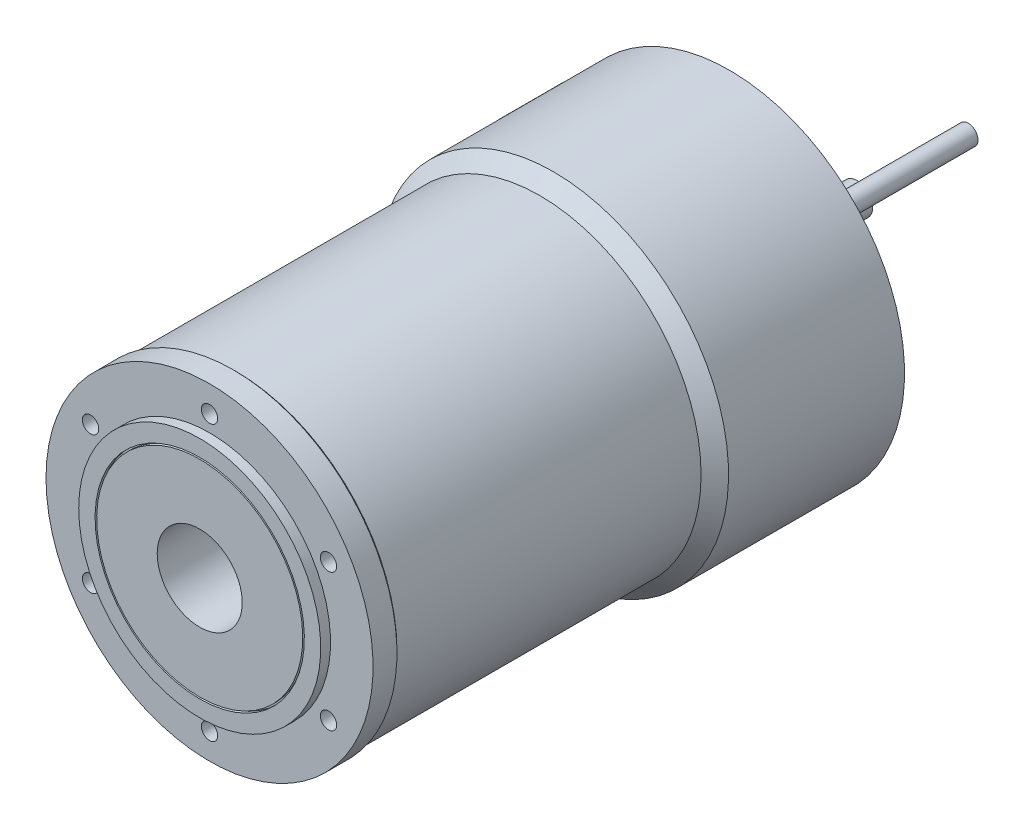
ISO-10303-21;
HEADER;
FILE_DESCRIPTION(('STEP AP214'),'2;1');
FILE_NAME('part.step','',(''),(''),'','','');
FILE_SCHEMA(('AUTOMOTIVE_DESIGN { 1 0 10303 214 1 1 1 1 }'));
ENDSEC;
DATA;
#1=APPLICATION_CONTEXT('core data for automotive mechanical design processes');
#2=APPLICATION_PROTOCOL_DEFINITION('international standard','automotive_design',2000,#1);
#3=PRODUCT_CONTEXT('',#1,'mechanical');
#4=PRODUCT('Part','Part','',(#3));
#5=PRODUCT_RELATED_PRODUCT_CATEGORY('part','',(#4));
#6=PRODUCT_DEFINITION_FORMATION('','',#4);
#7=PRODUCT_DEFINITION_CONTEXT('part definition',#1,'design');
#8=PRODUCT_DEFINITION('design','',#6,#7);
#9=PRODUCT_DEFINITION_SHAPE('','',#8);
#10=(LENGTH_UNIT() NAMED_UNIT(*) SI_UNIT(.MILLI.,.METRE.));
#11=(NAMED_UNIT(*) PLANE_ANGLE_UNIT() SI_UNIT($,.RADIAN.));
#12=(NAMED_UNIT(*) SI_UNIT($,.STERADIAN.) SOLID_ANGLE_UNIT());
#13=UNCERTAINTY_MEASURE_WITH_UNIT(LENGTH_MEASURE(1.E-05),#10,'distance_accuracy_value','');
#14=(GEOMETRIC_REPRESENTATION_CONTEXT(3) GLOBAL_UNCERTAINTY_ASSIGNED_CONTEXT((#13)) GLOBAL_UNIT_ASSIGNED_CONTEXT((#10,
#11,#12)) REPRESENTATION_CONTEXT('',''));
#15=CARTESIAN_POINT('',(0.,0.,0.));
#16=DIRECTION('',(0.,0.,1.));
#17=DIRECTION('',(1.,0.,0.));
#18=AXIS2_PLACEMENT_3D('',#15,#16,#17);
#19=CARTESIAN_POINT('',(-35.447022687,17.543955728,157.));
#20=DIRECTION('',(0.,0.,1.));
#21=DIRECTION('',(0.499999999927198,0.866025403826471,0.));
#22=AXIS2_PLACEMENT_3D('',#19,#20,#21);
#23=PLANE('',#22);
#24=CARTESIAN_POINT('',(-36.373066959,21.,157.));
#25=DIRECTION('',(0.,0.,1.));
#26=DIRECTION('',(0.,-1.,0.));
#27=AXIS2_PLACEMENT_3D('',#24,#25,#26);
#28=CIRCLE('',#27,2.5);
#29=CARTESIAN_POINT('',(-36.373066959,18.5,157.));
#30=VERTEX_POINT('',#29);
#31=EDGE_CURVE('E20',#30,#30,#28,.F.);
#32=ORIENTED_EDGE('',*,*,#31,.F.);
#33=EDGE_LOOP('',(#32));
#34=FACE_BOUND('',#33,.T.);
#35=ADVANCED_FACE('F16',(#34),#23,.T.);
#36=CARTESIAN_POINT('',(-32.917022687,-21.926044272,157.));
#37=DIRECTION('',(0.,0.,1.));
#38=DIRECTION('',(-0.499999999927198,0.866025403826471,0.));
#39=AXIS2_PLACEMENT_3D('',#36,#37,#38);
#40=PLANE('',#39);
#41=CARTESIAN_POINT('',(-36.373066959,-21.,157.));
#42=DIRECTION('',(0.,0.,1.));
#43=DIRECTION('',(1.,0.,0.));
#44=AXIS2_PLACEMENT_3D('',#41,#42,#43);
#45=CIRCLE('',#44,2.5);
#46=CARTESIAN_POINT('',(-33.873066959,-21.,157.));
#47=VERTEX_POINT('',#46);
#48=EDGE_CURVE('E308',#47,#47,#45,.F.);
#49=ORIENTED_EDGE('',*,*,#48,.F.);
#50=EDGE_LOOP('',(#49));
#51=FACE_BOUND('',#50,.T.);
#52=ADVANCED_FACE('F318',(#51),#40,.T.);
#53=CARTESIAN_POINT('',(2.53,-39.47,157.));
#54=DIRECTION('',(0.,0.,1.));
#55=DIRECTION('',(-1.,0.,0.));
#56=AXIS2_PLACEMENT_3D('',#53,#54,#55);
#57=PLANE('',#56);
#58=CARTESIAN_POINT('',(0.,-42.,157.));
#59=DIRECTION('',(0.,0.,1.));
#60=DIRECTION('',(1.,0.,0.));
#61=AXIS2_PLACEMENT_3D('',#58,#59,#60);
#62=CIRCLE('',#61,2.5);
#63=CARTESIAN_POINT('',(2.5,-42.,157.));
#64=VERTEX_POINT('',#63);
#65=EDGE_CURVE('E306',#64,#64,#62,.F.);
#66=ORIENTED_EDGE('',*,*,#65,.F.);
#67=EDGE_LOOP('',(#66));
#68=FACE_BOUND('',#67,.T.);
#69=ADVANCED_FACE('F324',(#68),#57,.T.);
#70=CARTESIAN_POINT('',(35.447022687,-17.543955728,157.));
#71=DIRECTION('',(0.,0.,1.));
#72=DIRECTION('',(-0.499999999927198,-0.866025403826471,0.));
#73=AXIS2_PLACEMENT_3D('',#70,#71,#72);
#74=PLANE('',#73);
#75=CARTESIAN_POINT('',(36.373066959,-21.,157.));
#76=DIRECTION('',(0.,0.,1.));
#77=DIRECTION('',(1.,0.,0.));
#78=AXIS2_PLACEMENT_3D('',#75,#76,#77);
#79=CIRCLE('',#78,2.5);
#80=CARTESIAN_POINT('',(38.873066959,-21.,157.));
#81=VERTEX_POINT('',#80);
#82=EDGE_CURVE('E303',#81,#81,#79,.F.);
#83=ORIENTED_EDGE('',*,*,#82,.F.);
#84=EDGE_LOOP('',(#83));
#85=FACE_BOUND('',#84,.T.);
#86=ADVANCED_FACE('F1451',(#85),#74,.T.);
#87=CARTESIAN_POINT('',(32.917022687,21.926044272,157.));
#88=DIRECTION('',(0.,0.,1.));
#89=DIRECTION('',(0.499999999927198,-0.866025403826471,0.));
#90=AXIS2_PLACEMENT_3D('',#87,#88,#89);
#91=PLANE('',#90);
#92=CARTESIAN_POINT('',(36.373066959,21.,157.));
#93=DIRECTION('',(0.,0.,1.));
#94=DIRECTION('',(0.,-1.,0.));
#95=AXIS2_PLACEMENT_3D('',#92,#93,#94);
#96=CIRCLE('',#95,2.5);
#97=CARTESIAN_POINT('',(36.373066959,18.5,157.));
#98=VERTEX_POINT('',#97);
#99=EDGE_CURVE('E300',#98,#98,#96,.F.);
#100=ORIENTED_EDGE('',*,*,#99,.F.);
#101=EDGE_LOOP('',(#100));
#102=FACE_BOUND('',#101,.T.);
#103=ADVANCED_FACE('F1443',(#102),#91,.T.);
#104=CARTESIAN_POINT('',(-2.53,39.47,157.));
#105=DIRECTION('',(0.,0.,1.));
#106=DIRECTION('',(1.,0.,0.));
#107=AXIS2_PLACEMENT_3D('',#104,#105,#106);
#108=PLANE('',#107);
#109=CARTESIAN_POINT('',(0.,42.,157.));
#110=DIRECTION('',(0.,0.,1.));
#111=DIRECTION('',(0.,-1.,0.));
#112=AXIS2_PLACEMENT_3D('',#109,#110,#111);
#113=CIRCLE('',#112,2.5);
#114=CARTESIAN_POINT('',(0.,39.5,157.));
#115=VERTEX_POINT('',#114);
#116=EDGE_CURVE('E297',#115,#115,#113,.F.);
#117=ORIENTED_EDGE('',*,*,#116,.F.);
#118=EDGE_LOOP('',(#117));
#119=FACE_BOUND('',#118,.T.);
#120=ADVANCED_FACE('F1436',(#119),#108,.T.);
#121=CARTESIAN_POINT('',(-36.373066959,21.,157.));
#122=DIRECTION('',(0.,0.,1.));
#123=DIRECTION('',(0.,-1.,0.));
#124=AXIS2_PLACEMENT_3D('',#121,#122,#123);
#125=CYLINDRICAL_SURFACE('',#124,2.5);
#126=CARTESIAN_POINT('',(-36.373066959,21.,164.));
#127=DIRECTION('',(0.,0.,1.));
#128=DIRECTION('',(0.,-1.,0.));
#129=AXIS2_PLACEMENT_3D('',#126,#127,#128);
#130=CIRCLE('',#129,2.5);
#131=CARTESIAN_POINT('',(-36.373066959,18.5,164.));
#132=VERTEX_POINT('',#131);
#133=EDGE_CURVE('E294',#132,#132,#130,.F.);
#134=ORIENTED_EDGE('',*,*,#133,.F.);
#135=EDGE_LOOP('',(#134));
#136=FACE_BOUND('',#135,.T.);
#137=ORIENTED_EDGE('',*,*,#31,.T.);
#138=EDGE_LOOP('',(#137));
#139=FACE_BOUND('',#138,.T.);
#140=ADVANCED_FACE('F315',(#136,#139),#125,.F.);
#141=CARTESIAN_POINT('',(-36.373066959,-21.,157.));
#142=DIRECTION('',(0.,0.,1.));
#143=DIRECTION('',(1.,0.,0.));
#144=AXIS2_PLACEMENT_3D('',#141,#142,#143);
#145=CYLINDRICAL_SURFACE('',#144,2.5);
#146=CARTESIAN_POINT('',(-36.3730669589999,-21.,164.));
#147=DIRECTION('',(0.,0.,1.));
#148=DIRECTION('',(1.,0.,0.));
#149=AXIS2_PLACEMENT_3D('',#146,#147,#148);
#150=CIRCLE('',#149,2.5);
#151=CARTESIAN_POINT('',(-33.873066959,-21.,164.));
#152=VERTEX_POINT('',#151);
#153=EDGE_CURVE('E291',#152,#152,#150,.F.);
#154=ORIENTED_EDGE('',*,*,#153,.F.);
#155=EDGE_LOOP('',(#154));
#156=FACE_BOUND('',#155,.T.);
#157=ORIENTED_EDGE('',*,*,#48,.T.);
#158=EDGE_LOOP('',(#157));
#159=FACE_BOUND('',#158,.T.);
#160=ADVANCED_FACE('F1419',(#156,#159),#145,.F.);
#161=CARTESIAN_POINT('',(0.,-42.,157.));
#162=DIRECTION('',(0.,0.,1.));
#163=DIRECTION('',(1.,0.,0.));
#164=AXIS2_PLACEMENT_3D('',#161,#162,#163);
#165=CYLINDRICAL_SURFACE('',#164,2.5);
#166=CARTESIAN_POINT('',(0.,-42.,164.));
#167=DIRECTION('',(0.,0.,1.));
#168=DIRECTION('',(1.,0.,0.));
#169=AXIS2_PLACEMENT_3D('',#166,#167,#168);
#170=CIRCLE('',#169,2.5);
#171=CARTESIAN_POINT('',(2.50000000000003,-42.,164.));
#172=VERTEX_POINT('',#171);
#173=EDGE_CURVE('E288',#172,#172,#170,.F.);
#174=ORIENTED_EDGE('',*,*,#173,.F.);
#175=EDGE_LOOP('',(#174));
#176=FACE_BOUND('',#175,.T.);
#177=ORIENTED_EDGE('',*,*,#65,.T.);
#178=EDGE_LOOP('',(#177));
#179=FACE_BOUND('',#178,.T.);
#180=ADVANCED_FACE('F1410',(#176,#179),#165,.F.);
#181=CARTESIAN_POINT('',(36.373066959,-21.,157.));
#182=DIRECTION('',(0.,0.,1.));
#183=DIRECTION('',(1.,0.,0.));
#184=AXIS2_PLACEMENT_3D('',#181,#182,#183);
#185=CYLINDRICAL_SURFACE('',#184,2.5);
#186=CARTESIAN_POINT('',(36.373066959,-21.,164.));
#187=DIRECTION('',(0.,0.,1.));
#188=DIRECTION('',(1.,0.,0.));
#189=AXIS2_PLACEMENT_3D('',#186,#187,#188);
#190=CIRCLE('',#189,2.5);
#191=CARTESIAN_POINT('',(38.873066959,-21.,164.));
#192=VERTEX_POINT('',#191);
#193=EDGE_CURVE('E285',#192,#192,#190,.F.);
#194=ORIENTED_EDGE('',*,*,#193,.F.);
#195=EDGE_LOOP('',(#194));
#196=FACE_BOUND('',#195,.T.);
#197=ORIENTED_EDGE('',*,*,#82,.T.);
#198=EDGE_LOOP('',(#197));
#199=FACE_BOUND('',#198,.T.);
#200=ADVANCED_FACE('F1401',(#196,#199),#185,.F.);
#201=CARTESIAN_POINT('',(36.373066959,21.,157.));
#202=DIRECTION('',(0.,0.,1.));
#203=DIRECTION('',(0.,-1.,0.));
#204=AXIS2_PLACEMENT_3D('',#201,#202,#203);
#205=CYLINDRICAL_SURFACE('',#204,2.5);
#206=CARTESIAN_POINT('',(36.373066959,21.,164.));
#207=DIRECTION('',(0.,0.,1.));
#208=DIRECTION('',(0.,-1.,0.));
#209=AXIS2_PLACEMENT_3D('',#206,#207,#208);
#210=CIRCLE('',#209,2.5);
#211=CARTESIAN_POINT('',(36.373066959,18.5,164.));
#212=VERTEX_POINT('',#211);
#213=EDGE_CURVE('E282',#212,#212,#210,.F.);
#214=ORIENTED_EDGE('',*,*,#213,.F.);
#215=EDGE_LOOP('',(#214));
#216=FACE_BOUND('',#215,.T.);
#217=ORIENTED_EDGE('',*,*,#99,.T.);
#218=EDGE_LOOP('',(#217));
#219=FACE_BOUND('',#218,.T.);
#220=ADVANCED_FACE('F1392',(#216,#219),#205,.F.);
#221=CARTESIAN_POINT('',(0.,42.,157.));
#222=DIRECTION('',(0.,0.,1.));
#223=DIRECTION('',(0.,-1.,0.));
#224=AXIS2_PLACEMENT_3D('',#221,#222,#223);
#225=CYLINDRICAL_SURFACE('',#224,2.5);
#226=CARTESIAN_POINT('',(0.,42.,164.));
#227=DIRECTION('',(0.,0.,1.));
#228=DIRECTION('',(0.,-1.,0.));
#229=AXIS2_PLACEMENT_3D('',#226,#227,#228);
#230=CIRCLE('',#229,2.5);
#231=CARTESIAN_POINT('',(0.,39.5,164.));
#232=VERTEX_POINT('',#231);
#233=EDGE_CURVE('E279',#232,#232,#230,.F.);
#234=ORIENTED_EDGE('',*,*,#233,.F.);
#235=EDGE_LOOP('',(#234));
#236=FACE_BOUND('',#235,.T.);
#237=ORIENTED_EDGE('',*,*,#116,.T.);
#238=EDGE_LOOP('',(#237));
#239=FACE_BOUND('',#238,.T.);
#240=ADVANCED_FACE('F1384',(#236,#239),#225,.F.);
#241=CARTESIAN_POINT('',(-50.6,50.6,164.));
#242=DIRECTION('',(0.,0.,1.));
#243=DIRECTION('',(0.,-1.,0.));
#244=AXIS2_PLACEMENT_3D('',#241,#242,#243);
#245=PLANE('',#244);
#246=CARTESIAN_POINT('',(0.,0.,164.));
#247=DIRECTION('',(0.,0.,-1.));
#248=DIRECTION('',(-1.,0.,0.));
#249=AXIS2_PLACEMENT_3D('',#246,#247,#248);
#250=CIRCLE('',#249,37.);
#251=CARTESIAN_POINT('',(-37.,0.,164.));
#252=VERTEX_POINT('',#251);
#253=EDGE_CURVE('E273',#252,#252,#250,.T.);
#254=ORIENTED_EDGE('',*,*,#253,.T.);
#255=EDGE_LOOP('',(#254));
#256=FACE_BOUND('',#255,.T.);
#257=ORIENTED_EDGE('',*,*,#233,.T.);
#258=EDGE_LOOP('',(#257));
#259=FACE_BOUND('',#258,.T.);
#260=ORIENTED_EDGE('',*,*,#213,.T.);
#261=EDGE_LOOP('',(#260));
#262=FACE_BOUND('',#261,.T.);
#263=ORIENTED_EDGE('',*,*,#193,.T.);
#264=EDGE_LOOP('',(#263));
#265=FACE_BOUND('',#264,.T.);
#266=ORIENTED_EDGE('',*,*,#173,.T.);
#267=EDGE_LOOP('',(#266));
#268=FACE_BOUND('',#267,.T.);
#269=ORIENTED_EDGE('',*,*,#153,.T.);
#270=EDGE_LOOP('',(#269));
#271=FACE_BOUND('',#270,.T.);
#272=ORIENTED_EDGE('',*,*,#133,.T.);
#273=EDGE_LOOP('',(#272));
#274=FACE_BOUND('',#273,.T.);
#275=CARTESIAN_POINT('',(0.,0.,164.));
#276=DIRECTION('',(0.,0.,-1.));
#277=DIRECTION('',(-1.,0.,0.));
#278=AXIS2_PLACEMENT_3D('',#275,#276,#277);
#279=CIRCLE('',#278,50.);
#280=CARTESIAN_POINT('',(-50.,0.,164.));
#281=VERTEX_POINT('',#280);
#282=EDGE_CURVE('E276',#281,#281,#279,.F.);
#283=ORIENTED_EDGE('',*,*,#282,.T.);
#284=EDGE_LOOP('',(#283));
#285=FACE_BOUND('',#284,.T.);
#286=ADVANCED_FACE('F1375',(#256,#259,#262,#265,#268,#271,#274,#285),#245,.T.);
#287=CARTESIAN_POINT('',(0.,0.,164.));
#288=DIRECTION('',(0.,0.,-1.));
#289=DIRECTION('',(-1.,0.,0.));
#290=AXIS2_PLACEMENT_3D('',#287,#288,#289);
#291=CYLINDRICAL_SURFACE('',#290,50.);
#292=ORIENTED_EDGE('',*,*,#282,.F.);
#293=EDGE_LOOP('',(#292));
#294=FACE_BOUND('',#293,.T.);
#295=CARTESIAN_POINT('',(0.,0.,156.7));
#296=DIRECTION('',(0.,0.,1.));
#297=DIRECTION('',(0.,-1.,0.));
#298=AXIS2_PLACEMENT_3D('',#295,#296,#297);
#299=CIRCLE('',#298,50.);
#300=CARTESIAN_POINT('',(0.,-50.,156.7));
#301=VERTEX_POINT('',#300);
#302=EDGE_CURVE('E272',#301,#301,#299,.T.);
#303=ORIENTED_EDGE('',*,*,#302,.T.);
#304=EDGE_LOOP('',(#303));
#305=FACE_BOUND('',#304,.T.);
#306=ADVANCED_FACE('F1367',(#294,#305),#291,.T.);
#307=CARTESIAN_POINT('',(0.,0.,167.));
#308=DIRECTION('',(0.,0.,-1.));
#309=DIRECTION('',(-1.,0.,0.));
#310=AXIS2_PLACEMENT_3D('',#307,#308,#309);
#311=CYLINDRICAL_SURFACE('',#310,37.);
#312=CARTESIAN_POINT('',(0.,0.,167.));
#313=DIRECTION('',(0.,0.,-1.));
#314=DIRECTION('',(-1.,0.,0.));
#315=AXIS2_PLACEMENT_3D('',#312,#313,#314);
#316=CIRCLE('',#315,37.);
#317=CARTESIAN_POINT('',(-37.,0.,167.));
#318=VERTEX_POINT('',#317);
#319=EDGE_CURVE('E269',#318,#318,#316,.F.);
#320=ORIENTED_EDGE('',*,*,#319,.F.);
#321=EDGE_LOOP('',(#320));
#322=FACE_BOUND('',#321,.T.);
#323=ORIENTED_EDGE('',*,*,#253,.F.);
#324=EDGE_LOOP('',(#323));
#325=FACE_BOUND('',#324,.T.);
#326=ADVANCED_FACE('F1359',(#322,#325),#311,.T.);
#327=CARTESIAN_POINT('',(0.,0.,156.));
#328=DIRECTION('',(0.,0.,1.));
#329=DIRECTION('',(1.,0.,0.));
#330=AXIS2_PLACEMENT_3D('',#327,#328,#329);
#331=CONICAL_SURFACE('',#330,49.3,0.785398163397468);
#332=CARTESIAN_POINT('',(0.,0.,156.));
#333=DIRECTION('',(0.,0.,-1.));
#334=DIRECTION('',(0.,1.,0.));
#335=AXIS2_PLACEMENT_3D('',#332,#333,#334);
#336=CIRCLE('',#335,49.3);
#337=CARTESIAN_POINT('',(0.,49.3,156.));
#338=VERTEX_POINT('',#337);
#339=EDGE_CURVE('E268',#338,#338,#336,.F.);
#340=ORIENTED_EDGE('',*,*,#339,.T.);
#341=EDGE_LOOP('',(#340));
#342=FACE_BOUND('',#341,.T.);
#343=ORIENTED_EDGE('',*,*,#302,.F.);
#344=EDGE_LOOP('',(#343));
#345=FACE_BOUND('',#344,.T.);
#346=ADVANCED_FACE('F1351',(#342,#345),#331,.T.);
#347=CARTESIAN_POINT('',(-37.444,37.444,167.));
#348=DIRECTION('',(0.,0.,1.));
#349=DIRECTION('',(0.,-1.,0.));
#350=AXIS2_PLACEMENT_3D('',#347,#348,#349);
#351=PLANE('',#350);
#352=CARTESIAN_POINT('',(0.,0.,167.));
#353=DIRECTION('',(0.,0.,1.));
#354=DIRECTION('',(0.,-1.,0.));
#355=AXIS2_PLACEMENT_3D('',#352,#353,#354);
#356=CIRCLE('',#355,32.);
#357=CARTESIAN_POINT('',(0.,-32.,167.));
#358=VERTEX_POINT('',#357);
#359=EDGE_CURVE('E245',#358,#358,#356,.T.);
#360=ORIENTED_EDGE('',*,*,#359,.F.);
#361=EDGE_LOOP('',(#360));
#362=FACE_BOUND('',#361,.T.);
#363=ORIENTED_EDGE('',*,*,#319,.T.);
#364=EDGE_LOOP('',(#363));
#365=FACE_BOUND('',#364,.T.);
#366=ADVANCED_FACE('F1344',(#362,#365),#351,.T.);
#367=CARTESIAN_POINT('',(0.,0.,36.));
#368=DIRECTION('',(0.,0.,-1.));
#369=DIRECTION('',(-1.,0.,0.));
#370=AXIS2_PLACEMENT_3D('',#367,#368,#369);
#371=CYLINDRICAL_SURFACE('',#370,53.6);
#372=DIRECTION('',(0.,0.,1.));
#373=VECTOR('',#372,1.);
#374=CARTESIAN_POINT('',(-39.649850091,36.06728972,26.));
#375=LINE('',#374,#373);
#376=CARTESIAN_POINT('',(-39.6498500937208,36.0672897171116,16.));
#377=VERTEX_POINT('',#376);
#378=CARTESIAN_POINT('',(-39.6498500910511,36.0672897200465,36.));
#379=VERTEX_POINT('',#378);
#380=EDGE_CURVE('E259',#377,#379,#375,.T.);
#381=ORIENTED_EDGE('',*,*,#380,.F.);
#382=CARTESIAN_POINT('',(0.,0.,16.));
#383=DIRECTION('',(0.,0.,-1.));
#384=DIRECTION('',(-1.,0.,0.));
#385=AXIS2_PLACEMENT_3D('',#382,#383,#384);
#386=CIRCLE('',#385,53.6);
#387=CARTESIAN_POINT('',(-53.5414476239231,2.50467289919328,16.));
#388=VERTEX_POINT('',#387);
#389=EDGE_CURVE('E241',#388,#377,#386,.T.);
#390=ORIENTED_EDGE('',*,*,#389,.F.);
#391=DIRECTION('',(0.,0.,1.));
#392=VECTOR('',#391,1.);
#393=CARTESIAN_POINT('',(-53.541447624,2.504672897,26.));
#394=LINE('',#393,#392);
#395=CARTESIAN_POINT('',(-53.5414476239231,2.50467289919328,36.));
#396=VERTEX_POINT('',#395);
#397=EDGE_CURVE('E234',#388,#396,#394,.T.);
#398=ORIENTED_EDGE('',*,*,#397,.T.);
#399=CARTESIAN_POINT('',(0.,0.,36.));
#400=DIRECTION('',(0.,0.,-1.));
#401=DIRECTION('',(-1.,0.,0.));
#402=AXIS2_PLACEMENT_3D('',#399,#400,#401);
#403=CIRCLE('',#402,53.6);
#404=EDGE_CURVE('E238',#379,#396,#403,.F.);
#405=ORIENTED_EDGE('',*,*,#404,.F.);
#406=EDGE_LOOP('',(#381,#390,#398,#405));
#407=FACE_BOUND('',#406,.T.);
#408=ADVANCED_FACE('F236',(#407),#371,.T.);
#409=CARTESIAN_POINT('',(0.,0.,33.305904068));
#410=DIRECTION('',(0.,0.,-1.));
#411=DIRECTION('',(-1.,0.,0.));
#412=AXIS2_PLACEMENT_3D('',#409,#410,#411);
#413=CYLINDRICAL_SURFACE('',#412,53.6);
#414=CARTESIAN_POINT('',(-46.6763518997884,-26.3491588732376,16.));
#415=CARTESIAN_POINT('',(-46.6597666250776,-26.3785388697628,16.0000044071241));
#416=CARTESIAN_POINT('',(-46.6431645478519,-26.4078838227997,16.0010922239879));
#417=CARTESIAN_POINT('',(-46.6099378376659,-26.4664851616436,16.0054217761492));
#418=CARTESIAN_POINT('',(-46.5933132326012,-26.4957412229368,16.008668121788));
#419=CARTESIAN_POINT('',(-46.5337733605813,-26.6002899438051,16.024156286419));
#420=CARTESIAN_POINT('',(-46.4910289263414,-26.6749170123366,16.0424965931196));
#421=CARTESIAN_POINT('',(-46.4282852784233,-26.7838778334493,16.0806101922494));
#422=CARTESIAN_POINT('',(-46.4075715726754,-26.8197495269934,16.0951096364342));
#423=CARTESIAN_POINT('',(-46.3667848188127,-26.8902010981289,16.1276906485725));
#424=CARTESIAN_POINT('',(-46.3467114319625,-26.92478166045,16.1457702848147));
#425=CARTESIAN_POINT('',(-46.3074818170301,-26.9921959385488,16.1853098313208));
#426=CARTESIAN_POINT('',(-46.2883213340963,-27.025037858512,16.2067515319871));
#427=CARTESIAN_POINT('',(-46.2510348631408,-27.0888009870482,16.2531047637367));
#428=CARTESIAN_POINT('',(-46.2329086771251,-27.1197225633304,16.278015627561));
#429=CARTESIAN_POINT('',(-46.1979166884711,-27.1792877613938,16.3310711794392));
#430=CARTESIAN_POINT('',(-46.1810481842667,-27.2079362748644,16.3592085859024));
#431=CARTESIAN_POINT('',(-46.1487677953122,-27.2626528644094,16.4187315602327));
#432=CARTESIAN_POINT('',(-46.1333573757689,-27.2887183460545,16.4501203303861));
#433=CARTESIAN_POINT('',(-46.1080740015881,-27.3314097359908,16.5073548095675));
#434=CARTESIAN_POINT('',(-46.0978042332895,-27.3487259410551,16.5325146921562));
#435=CARTESIAN_POINT('',(-46.0782942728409,-27.3815843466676,16.5843628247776));
#436=CARTESIAN_POINT('',(-46.0690543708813,-27.3971260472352,16.6110515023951));
#437=CARTESIAN_POINT('',(-46.0517421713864,-27.4262161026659,16.6658274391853));
#438=CARTESIAN_POINT('',(-46.0436688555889,-27.4397661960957,16.6939134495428));
#439=CARTESIAN_POINT('',(-46.0287982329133,-27.4647036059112,16.7513397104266));
#440=CARTESIAN_POINT('',(-46.0220002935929,-27.4760919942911,16.7806793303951));
#441=CARTESIAN_POINT('',(-46.0097166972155,-27.4966564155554,16.8405931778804));
#442=CARTESIAN_POINT('',(-46.0042390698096,-27.505818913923,16.8711737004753));
#443=CARTESIAN_POINT('',(-45.9947119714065,-27.5217469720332,16.9331484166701));
#444=CARTESIAN_POINT('',(-45.9906614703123,-27.5285142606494,16.964542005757));
#445=CARTESIAN_POINT('',(-45.9840964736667,-27.5394791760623,17.0279259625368));
#446=CARTESIAN_POINT('',(-45.9815813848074,-27.543677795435,17.0599160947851));
#447=CARTESIAN_POINT('',(-45.9781139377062,-27.5494654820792,17.1242097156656));
#448=CARTESIAN_POINT('',(-45.9771618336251,-27.5510541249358,17.1565132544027));
#449=CARTESIAN_POINT('',(-45.9766601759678,-27.5518916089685,17.2478744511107));
#450=CARTESIAN_POINT('',(-45.978916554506,-27.5481275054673,17.3070104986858));
#451=CARTESIAN_POINT('',(-45.9886503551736,-27.53187464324,17.423672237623));
#452=CARTESIAN_POINT('',(-45.9961323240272,-27.5193782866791,17.4811964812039));
#453=CARTESIAN_POINT('',(-46.0105061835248,-27.495334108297,17.5632235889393));
#454=CARTESIAN_POINT('',(-46.0155895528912,-27.4868265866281,17.5889944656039));
#455=CARTESIAN_POINT('',(-46.0267372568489,-27.4681556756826,17.6397187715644));
#456=CARTESIAN_POINT('',(-46.0328015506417,-27.4579923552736,17.6646722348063));
#457=CARTESIAN_POINT('',(-46.0458407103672,-27.4361206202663,17.7135736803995));
#458=CARTESIAN_POINT('',(-46.0528135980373,-27.4244155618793,17.7375237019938));
#459=CARTESIAN_POINT('',(-46.0676049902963,-27.39956166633,17.7843885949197));
#460=CARTESIAN_POINT('',(-46.075423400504,-27.3864129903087,17.8073035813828));
#461=CARTESIAN_POINT('',(-46.0836278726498,-27.3726002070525,17.8296606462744));
#462=B_SPLINE_CURVE_WITH_KNOTS('',3,(#414,#415,#416,#417,#418,#419,#420,#421,#422,#423,#424,
#425,#426,#427,#428,#429,#430,#431,#432,#433,#434,#435,#436,#437,#438,#439,#440,#441,#442,#443,
#444,#445,#446,#447,#448,#449,#450,#451,#452,#453,#454,#455,#456,#457,#458,#459,#460,#461),
.UNSPECIFIED.,.F.,.F.,(4,2,2,2,2,2,2,2,2,2,2,2,2,2,2,2,2,2,2,2,2,2,2,4),(0.,0.101152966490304,
0.202522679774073,0.464857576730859,0.596393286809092,0.72785821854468,0.858634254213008,
0.989385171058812,1.11984661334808,1.25043779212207,1.34701306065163,1.44361547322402,
1.54013304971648,1.63660263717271,1.73364489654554,1.83061696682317,1.92755154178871,
2.02450187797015,2.20146239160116,2.378577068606,2.46134988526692,2.54411926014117,
2.62671134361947,2.70929421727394),.UNSPECIFIED.);
#463=CARTESIAN_POINT('',(-46.6763519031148,-26.3491588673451,16.));
#464=VERTEX_POINT('',#463);
#465=CARTESIAN_POINT('',(-46.0836278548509,-27.3726002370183,17.829660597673));
#466=VERTEX_POINT('',#465);
#467=EDGE_CURVE('E566',#464,#466,#462,.T.);
#468=ORIENTED_EDGE('',*,*,#467,.T.);
#469=CARTESIAN_POINT('',(-49.9746554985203,-19.377662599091,30.7760696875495));
#470=CARTESIAN_POINT('',(-49.9613259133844,-19.412039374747,30.7204024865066));
#471=CARTESIAN_POINT('',(-49.9479571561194,-19.4464119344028,30.6647421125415));
#472=CARTESIAN_POINT('',(-49.8809170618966,-19.6182539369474,30.3864739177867));
#473=CARTESIAN_POINT('',(-49.8266572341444,-19.7556598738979,30.163968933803));
#474=CARTESIAN_POINT('',(-49.5521903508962,-20.4423697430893,29.0519618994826));
#475=CARTESIAN_POINT('',(-49.3225085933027,-20.9906404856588,28.1641329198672));
#476=CARTESIAN_POINT('',(-48.8672173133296,-22.028210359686,26.4839692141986));
#477=CARTESIAN_POINT('',(-48.643634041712,-22.5177557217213,25.6912357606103));
#478=CARTESIAN_POINT('',(-48.1794090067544,-23.4946158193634,24.1093809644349));
#479=CARTESIAN_POINT('',(-47.9387671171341,-23.9819305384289,23.3202596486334));
#480=CARTESIAN_POINT('',(-47.4396353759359,-24.954766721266,21.7449208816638));
#481=CARTESIAN_POINT('',(-47.1811209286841,-25.4402847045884,20.9587090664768));
#482=CARTESIAN_POINT('',(-46.6460390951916,-26.4085729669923,19.3907348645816));
#483=CARTESIAN_POINT('',(-46.369471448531,-26.8913432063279,18.6089725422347));
#484=CARTESIAN_POINT('',(-46.0836278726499,-27.3726002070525,17.8296606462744));
#485=B_SPLINE_CURVE_WITH_KNOTS('',3,(#469,#470,#471,#472,#473,#474,#475,#476,#477,#478,#479,
#480,#481,#482,#483,#484),.UNSPECIFIED.,.F.,.F.,(4,2,2,2,2,2,2,4),(0.,0.200310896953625,
1.00155665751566,4.20668291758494,7.08101503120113,9.95536842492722,12.8337593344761,
15.7121917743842),.UNSPECIFIED.);
#486=CARTESIAN_POINT('',(-49.9746554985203,-19.377662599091,30.7760696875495));
#487=VERTEX_POINT('',#486);
#488=EDGE_CURVE('E560',#487,#466,#485,.T.);
#489=ORIENTED_EDGE('',*,*,#488,.F.);
#490=CARTESIAN_POINT('',(-49.9746554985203,-19.377662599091,30.7760696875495));
#491=CARTESIAN_POINT('',(-49.9880977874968,-19.3429949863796,30.8322196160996));
#492=CARTESIAN_POINT('',(-50.00190449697,-19.3072808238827,30.8876467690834));
#493=CARTESIAN_POINT('',(-50.0444574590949,-19.1968363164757,31.0520065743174));
#494=CARTESIAN_POINT('',(-50.0742488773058,-19.1190281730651,31.1586212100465));
#495=CARTESIAN_POINT('',(-50.1363156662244,-18.9556714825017,31.3650349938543));
#496=CARTESIAN_POINT('',(-50.1685921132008,-18.8701195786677,31.4648311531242));
#497=CARTESIAN_POINT('',(-50.2352243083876,-18.6920109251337,31.6571104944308));
#498=CARTESIAN_POINT('',(-50.2695790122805,-18.5994576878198,31.7495972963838));
#499=CARTESIAN_POINT('',(-50.3400092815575,-18.4079840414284,31.9269986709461));
#500=CARTESIAN_POINT('',(-50.3760847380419,-18.3090640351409,32.0119137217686));
#501=CARTESIAN_POINT('',(-50.4496755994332,-18.1053019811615,32.173645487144));
#502=CARTESIAN_POINT('',(-50.4871910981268,-18.0004595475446,32.2504616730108));
#503=CARTESIAN_POINT('',(-50.563315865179,-17.7855019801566,32.3956427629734));
#504=CARTESIAN_POINT('',(-50.6019248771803,-17.6753880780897,32.4640096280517));
#505=CARTESIAN_POINT('',(-50.6797929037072,-17.4508648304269,32.5920412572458));
#506=CARTESIAN_POINT('',(-50.7190499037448,-17.3364677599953,32.6517288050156));
#507=CARTESIAN_POINT('',(-50.7981399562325,-17.1033371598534,32.7623410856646));
#508=CARTESIAN_POINT('',(-50.8379741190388,-16.984594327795,32.8132455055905));
#509=CARTESIAN_POINT('',(-50.9178653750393,-16.7435708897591,32.9058342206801));
#510=CARTESIAN_POINT('',(-50.9579226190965,-16.621287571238,32.9475112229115));
#511=CARTESIAN_POINT('',(-51.0787364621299,-16.2478074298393,33.0593662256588));
#512=CARTESIAN_POINT('',(-51.1594166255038,-15.9920903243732,33.1153727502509));
#513=CARTESIAN_POINT('',(-51.2786258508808,-15.6038800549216,33.1693980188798));
#514=CARTESIAN_POINT('',(-51.3181053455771,-15.4735496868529,33.1824066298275));
#515=CARTESIAN_POINT('',(-51.3962426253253,-15.211996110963,33.1984148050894));
#516=CARTESIAN_POINT('',(-51.4349003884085,-15.0807728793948,33.2014141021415));
#517=CARTESIAN_POINT('',(-51.5169087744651,-14.7984074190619,33.1971202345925));
#518=CARTESIAN_POINT('',(-51.5600902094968,-14.6472392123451,33.1882103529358));
#519=CARTESIAN_POINT('',(-51.6447757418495,-14.3457882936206,33.1567866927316));
#520=CARTESIAN_POINT('',(-51.6862794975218,-14.1955057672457,33.1342701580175));
#521=CARTESIAN_POINT('',(-51.7470201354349,-13.9718244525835,33.0904709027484));
#522=CARTESIAN_POINT('',(-51.767000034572,-13.8976096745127,33.0742164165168));
#523=CARTESIAN_POINT('',(-51.8064461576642,-13.7498358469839,33.0384339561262));
#524=CARTESIAN_POINT('',(-51.8259123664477,-13.6762768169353,33.0189058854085));
#525=CARTESIAN_POINT('',(-51.8834778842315,-13.4568771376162,32.9553886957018));
#526=CARTESIAN_POINT('',(-51.9207727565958,-13.3122081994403,32.9064459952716));
#527=CARTESIAN_POINT('',(-51.9741204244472,-13.1017464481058,32.8244440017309));
#528=CARTESIAN_POINT('',(-51.9911049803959,-13.0341772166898,32.7964184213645));
#529=CARTESIAN_POINT('',(-52.0245087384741,-12.9002034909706,32.7374276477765));
#530=CARTESIAN_POINT('',(-52.0409280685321,-12.8337987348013,32.706463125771));
#531=CARTESIAN_POINT('',(-52.0731931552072,-12.702249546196,32.6416485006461));
#532=CARTESIAN_POINT('',(-52.0890387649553,-12.6371054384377,32.6077976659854));
#533=CARTESIAN_POINT('',(-52.120143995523,-12.5081968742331,32.53729127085));
#534=CARTESIAN_POINT('',(-52.1354034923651,-12.4444327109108,32.5006351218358));
#535=CARTESIAN_POINT('',(-52.1792363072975,-12.2598085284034,32.3891379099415));
#536=CARTESIAN_POINT('',(-52.2069895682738,-12.1410152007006,32.3104966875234));
#537=CARTESIAN_POINT('',(-52.2601473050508,-11.9101243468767,32.1431452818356));
#538=CARTESIAN_POINT('',(-52.2855507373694,-11.7980298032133,32.0544306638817));
#539=CARTESIAN_POINT('',(-52.3339769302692,-11.5813292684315,31.8676444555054));
#540=CARTESIAN_POINT('',(-52.3569991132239,-11.476725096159,31.7695706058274));
#541=CARTESIAN_POINT('',(-52.4006251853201,-11.2758605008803,31.5648120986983));
#542=CARTESIAN_POINT('',(-52.421230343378,-11.1795957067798,31.4581320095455));
#543=CARTESIAN_POINT('',(-52.4564000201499,-11.0132621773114,31.2571201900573));
#544=CARTESIAN_POINT('',(-52.4713775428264,-10.941637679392,31.1641431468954));
#545=CARTESIAN_POINT('',(-52.499677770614,-10.805029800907,30.9735227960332));
#546=CARTESIAN_POINT('',(-52.5130042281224,-10.7400314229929,30.8758907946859));
#547=CARTESIAN_POINT('',(-52.5255320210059,-10.6784121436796,30.7760696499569));
#548=B_SPLINE_CURVE_WITH_KNOTS('',3,(#490,#491,#492,#493,#494,#495,#496,#497,#498,#499,#500,
#501,#502,#503,#504,#505,#506,#507,#508,#509,#510,#511,#512,#513,#514,#515,#516,#517,#518,#519,
#520,#521,#522,#523,#524,#525,#526,#527,#528,#529,#530,#531,#532,#533,#534,#535,#536,#537,#538,
#539,#540,#541,#542,#543,#544,#545,#546,#547),.UNSPECIFIED.,.F.,.F.,(4,2,2,2,2,2,2,2,2,2,2,2,2,
2,2,2,2,2,2,2,2,2,2,2,2,2,2,2,4),(0.,0.2020455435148,0.60752385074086,1.01317876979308,
1.41863151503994,1.82405863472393,2.22951220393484,2.63487149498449,3.03914670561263,
3.44434471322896,3.8498618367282,4.66815663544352,5.07826046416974,5.48837524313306,
5.96020375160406,6.43212786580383,6.6677352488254,6.90334958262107,7.37424500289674,
7.59948354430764,7.82467076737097,8.04991523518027,8.27520708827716,8.71007973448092,
9.14514457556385,9.58031470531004,10.0152553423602,10.3699246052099,10.7237724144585),.UNSPECIFIED.);
#549=CARTESIAN_POINT('',(-52.5255320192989,-10.6784121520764,30.7760696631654));
#550=VERTEX_POINT('',#549);
#551=EDGE_CURVE('E591',#487,#550,#548,.T.);
#552=ORIENTED_EDGE('',*,*,#551,.T.);
#553=CARTESIAN_POINT('',(-53.532784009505,-2.68347464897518,17.829660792));
#554=CARTESIAN_POINT('',(-53.5310265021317,-2.71853525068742,17.8864353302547));
#555=CARTESIAN_POINT('',(-53.5292344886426,-2.75359538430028,17.9432091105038));
#556=CARTESIAN_POINT('',(-53.5201018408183,-2.92889388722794,18.2270745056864));
#557=CARTESIAN_POINT('',(-53.5122435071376,-3.06912491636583,18.4541542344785));
#558=CARTESIAN_POINT('',(-53.4954215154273,-3.34956859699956,18.9082839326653));
#559=CARTESIAN_POINT('',(-53.4864578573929,-3.48978124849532,19.1353339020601));
#560=CARTESIAN_POINT('',(-53.4674241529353,-3.77018589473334,19.589400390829));
#561=CARTESIAN_POINT('',(-53.4573541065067,-3.9103778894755,19.8164169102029));
#562=CARTESIAN_POINT('',(-53.4361064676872,-4.19073848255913,20.2704120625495));
#563=CARTESIAN_POINT('',(-53.4249288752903,-4.33090708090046,20.4973906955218));
#564=CARTESIAN_POINT('',(-53.3662670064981,-5.03170632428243,21.6322130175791));
#565=CARTESIAN_POINT('',(-53.3104650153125,-5.59215095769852,22.5397554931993));
#566=CARTESIAN_POINT('',(-53.1584539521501,-6.90777063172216,24.6701724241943));
#567=CARTESIAN_POINT('',(-53.054940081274,-7.66271479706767,25.8926730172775));
#568=CARTESIAN_POINT('',(-52.8150150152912,-9.17155404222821,28.3359753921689));
#569=CARTESIAN_POINT('',(-52.6785866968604,-9.92544836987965,29.5567759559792));
#570=CARTESIAN_POINT('',(-52.5255320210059,-10.6784121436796,30.7760696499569));
#571=B_SPLINE_CURVE_WITH_KNOTS('',3,(#553,#554,#555,#556,#557,#558,#559,#560,#561,#562,#563,
#564,#565,#566,#567,#568,#569,#570),.UNSPECIFIED.,.F.,.F.,(4,2,2,2,2,2,2,2,4),(0.,
0.200252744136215,1.0012653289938,1.80227791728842,2.60329050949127,3.40430310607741,
6.60845780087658,10.9297044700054,15.2532040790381),.UNSPECIFIED.);
#572=CARTESIAN_POINT('',(-53.5327840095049,-2.68347464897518,17.829660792));
#573=VERTEX_POINT('',#572);
#574=EDGE_CURVE('E539',#573,#550,#571,.T.);
#575=ORIENTED_EDGE('',*,*,#574,.F.);
#576=CARTESIAN_POINT('',(-53.5327840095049,-2.68347464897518,17.829660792));
#577=CARTESIAN_POINT('',(-53.5336743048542,-2.66571182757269,17.8009230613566));
#578=CARTESIAN_POINT('',(-53.5344951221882,-2.64916261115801,17.7714303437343));
#579=CARTESIAN_POINT('',(-53.5359993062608,-2.61859050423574,17.7110929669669));
#580=CARTESIAN_POINT('',(-53.5366824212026,-2.60457224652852,17.6802459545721));
#581=CARTESIAN_POINT('',(-53.5379086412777,-2.57924379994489,17.6175066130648));
#582=CARTESIAN_POINT('',(-53.5384519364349,-2.56792993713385,17.5856157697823));
#583=CARTESIAN_POINT('',(-53.5394045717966,-2.54799086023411,17.5209992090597));
#584=CARTESIAN_POINT('',(-53.5398138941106,-2.53936600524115,17.4882733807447));
#585=CARTESIAN_POINT('',(-53.540497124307,-2.52491995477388,17.4221779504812));
#586=CARTESIAN_POINT('',(-53.5407709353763,-2.51910076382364,17.3888079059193));
#587=CARTESIAN_POINT('',(-53.541182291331,-2.51034186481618,17.3216876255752));
#588=CARTESIAN_POINT('',(-53.5413197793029,-2.50740335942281,17.2879372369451));
#589=CARTESIAN_POINT('',(-53.5415315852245,-2.5028820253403,17.1869321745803));
#590=CARTESIAN_POINT('',(-53.5414101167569,-2.50548917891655,17.1194380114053));
#591=CARTESIAN_POINT('',(-53.5406342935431,-2.52201169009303,16.985879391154));
#592=CARTESIAN_POINT('',(-53.5399799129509,-2.53592759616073,16.9198150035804));
#593=CARTESIAN_POINT('',(-53.5381310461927,-2.57466468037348,16.7908896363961));
#594=CARTESIAN_POINT('',(-53.5369359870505,-2.59949742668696,16.7280321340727));
#595=CARTESIAN_POINT('',(-53.5339965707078,-2.65934286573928,16.607375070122));
#596=CARTESIAN_POINT('',(-53.5322521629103,-2.6943564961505,16.5495759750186));
#597=CARTESIAN_POINT('',(-53.5282069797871,-2.7735579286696,16.4406897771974));
#598=CARTESIAN_POINT('',(-53.5259063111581,-2.81774397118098,16.3896013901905));
#599=CARTESIAN_POINT('',(-53.5207521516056,-2.91400200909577,16.2955292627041));
#600=CARTESIAN_POINT('',(-53.5178986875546,-2.96607362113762,16.2525451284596));
#601=CARTESIAN_POINT('',(-53.5116421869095,-3.07688759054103,16.1757456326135));
#602=CARTESIAN_POINT('',(-53.5082368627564,-3.13565739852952,16.1419700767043));
#603=CARTESIAN_POINT('',(-53.5009266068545,-3.2580061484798,16.0847633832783));
#604=CARTESIAN_POINT('',(-53.4970217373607,-3.32158449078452,16.0613309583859));
#605=CARTESIAN_POINT('',(-53.4896025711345,-3.43876982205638,16.0290031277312));
#606=CARTESIAN_POINT('',(-53.4861646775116,-3.49185005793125,16.0181450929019));
#607=CARTESIAN_POINT('',(-53.479067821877,-3.5989211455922,16.0036385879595));
#608=CARTESIAN_POINT('',(-53.4754090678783,-3.65291110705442,15.9999834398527));
#609=CARTESIAN_POINT('',(-53.471663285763,-3.70691589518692,16.));
#610=B_SPLINE_CURVE_WITH_KNOTS('',3,(#576,#577,#578,#579,#580,#581,#582,#583,#584,#585,#586,
#587,#588,#589,#590,#591,#592,#593,#594,#595,#596,#597,#598,#599,#600,#601,#602,#603,#604,#605,
#606,#607,#608,#609),.UNSPECIFIED.,.F.,.F.,(4,2,2,2,2,2,2,2,2,2,2,2,2,2,2,2,4),(0.,
0.101361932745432,0.202907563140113,0.304314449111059,0.405734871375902,0.507227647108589,
0.608762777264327,0.81036157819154,1.01197015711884,1.21379289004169,1.41563421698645,
1.61743685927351,1.81922969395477,2.0218814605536,2.22450799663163,2.38690073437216,
2.54914284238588),.UNSPECIFIED.);
#611=CARTESIAN_POINT('',(-53.4716632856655,-3.70691589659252,16.));
#612=VERTEX_POINT('',#611);
#613=EDGE_CURVE('E531',#573,#612,#610,.T.);
#614=ORIENTED_EDGE('',*,*,#613,.T.);
#615=CARTESIAN_POINT('',(0.,0.,16.));
#616=DIRECTION('',(0.,0.,-1.));
#617=DIRECTION('',(-1.,0.,0.));
#618=AXIS2_PLACEMENT_3D('',#615,#616,#617);
#619=CIRCLE('',#618,53.6);
#620=EDGE_CURVE('E572',#464,#612,#619,.T.);
#621=ORIENTED_EDGE('',*,*,#620,.F.);
#622=EDGE_LOOP('',(#468,#489,#552,#575,#614,#621));
#623=FACE_BOUND('',#622,.T.);
#624=ADVANCED_FACE('F546',(#623),#413,.T.);
#625=CARTESIAN_POINT('',(0.,0.,156.));
#626=DIRECTION('',(0.,0.,-1.));
#627=DIRECTION('',(-1.,0.,0.));
#628=AXIS2_PLACEMENT_3D('',#625,#626,#627);
#629=CYLINDRICAL_SURFACE('',#628,49.3);
#630=ORIENTED_EDGE('',*,*,#339,.F.);
#631=EDGE_LOOP('',(#630));
#632=FACE_BOUND('',#631,.T.);
#633=CARTESIAN_POINT('',(0.,0.,62.9999999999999));
#634=DIRECTION('',(0.,0.,-1.));
#635=DIRECTION('',(0.,1.,0.));
#636=AXIS2_PLACEMENT_3D('',#633,#634,#635);
#637=CIRCLE('',#636,49.3);
#638=CARTESIAN_POINT('',(0.,49.3,63.));
#639=VERTEX_POINT('',#638);
#640=EDGE_CURVE('E599',#639,#639,#637,.F.);
#641=ORIENTED_EDGE('',*,*,#640,.T.);
#642=EDGE_LOOP('',(#641));
#643=FACE_BOUND('',#642,.T.);
#644=ADVANCED_FACE('F551',(#632,#643),#629,.T.);
#645=CARTESIAN_POINT('',(0.,0.,166.));
#646=DIRECTION('',(0.,0.,1.));
#647=DIRECTION('',(0.,-1.,0.));
#648=AXIS2_PLACEMENT_3D('',#645,#646,#647);
#649=CYLINDRICAL_SURFACE('',#648,32.);
#650=ORIENTED_EDGE('',*,*,#359,.T.);
#651=EDGE_LOOP('',(#650));
#652=FACE_BOUND('',#651,.T.);
#653=CARTESIAN_POINT('',(0.,0.,166.));
#654=DIRECTION('',(0.,0.,1.));
#655=DIRECTION('',(0.,-1.,0.));
#656=AXIS2_PLACEMENT_3D('',#653,#654,#655);
#657=CIRCLE('',#656,32.);
#658=CARTESIAN_POINT('',(0.,-32.,166.));
#659=VERTEX_POINT('',#658);
#660=EDGE_CURVE('E597',#659,#659,#657,.T.);
#661=ORIENTED_EDGE('',*,*,#660,.F.);
#662=EDGE_LOOP('',(#661));
#663=FACE_BOUND('',#662,.T.);
#664=ADVANCED_FACE('F859',(#652,#663),#649,.F.);
#665=CARTESIAN_POINT('',(-53.441556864,2.5,36.));
#666=DIRECTION('',(0.0467289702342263,0.998907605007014,0.));
#667=DIRECTION('',(0.,0.,-1.));
#668=AXIS2_PLACEMENT_3D('',#665,#666,#667);
#669=PLANE('',#668);
#670=DIRECTION('',(0.,0.,-1.));
#671=VECTOR('',#670,1.);
#672=CARTESIAN_POINT('',(-53.4415568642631,2.49999998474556,31.9));
#673=LINE('',#672,#671);
#674=CARTESIAN_POINT('',(-53.4415568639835,2.49999999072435,16.0000000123));
#675=VERTEX_POINT('',#674);
#676=CARTESIAN_POINT('',(-53.4415568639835,2.49999999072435,35.9999999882));
#677=VERTEX_POINT('',#676);
#678=EDGE_CURVE('E251',#675,#677,#673,.F.);
#679=ORIENTED_EDGE('',*,*,#678,.T.);
#680=DIRECTION('',(0.998907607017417,-0.0467289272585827,0.));
#681=VECTOR('',#680,1.);
#682=CARTESIAN_POINT('',(-53.5414476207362,2.50467290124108,36.));
#683=LINE('',#682,#681);
#684=EDGE_CURVE('E244',#396,#677,#683,.T.);
#685=ORIENTED_EDGE('',*,*,#684,.F.);
#686=ORIENTED_EDGE('',*,*,#397,.F.);
#687=DIRECTION('',(-0.998907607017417,0.0467289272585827,0.));
#688=VECTOR('',#687,1.);
#689=CARTESIAN_POINT('',(-53.4415568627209,2.50000000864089,16.));
#690=LINE('',#689,#688);
#691=EDGE_CURVE('E883',#675,#388,#690,.T.);
#692=ORIENTED_EDGE('',*,*,#691,.F.);
#693=EDGE_LOOP('',(#679,#685,#686,#692));
#694=FACE_BOUND('',#693,.T.);
#695=ADVANCED_FACE('F249',(#694),#669,.F.);
#696=CARTESIAN_POINT('',(-53.625241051,2.298596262,36.));
#697=DIRECTION('',(0.,0.,1.));
#698=DIRECTION('',(1.,0.,0.));
#699=AXIS2_PLACEMENT_3D('',#696,#697,#698);
#700=PLANE('',#699);
#701=DIRECTION('',(0.739736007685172,-0.672897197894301,0.));
#702=VECTOR('',#701,1.);
#703=CARTESIAN_POINT('',(-39.6128632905,36.03364486,36.));
#704=LINE('',#703,#702);
#705=CARTESIAN_POINT('',(-39.5758764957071,35.9999999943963,35.9999999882));
#706=VERTEX_POINT('',#705);
#707=EDGE_CURVE('E257',#379,#706,#704,.T.);
#708=ORIENTED_EDGE('',*,*,#707,.F.);
#709=ORIENTED_EDGE('',*,*,#404,.T.);
#710=ORIENTED_EDGE('',*,*,#684,.T.);
#711=CARTESIAN_POINT('',(0.,0.,35.9999999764));
#712=DIRECTION('',(0.,0.,-1.));
#713=DIRECTION('',(-1.,0.,0.));
#714=AXIS2_PLACEMENT_3D('',#711,#712,#713);
#715=CIRCLE('',#714,53.5);
#716=EDGE_CURVE('E595',#677,#706,#715,.T.);
#717=ORIENTED_EDGE('',*,*,#716,.T.);
#718=EDGE_LOOP('',(#708,#709,#710,#717));
#719=FACE_BOUND('',#718,.T.);
#720=ADVANCED_FACE('F255',(#719),#700,.T.);
#721=CARTESIAN_POINT('',(-39.57587649,36.,36.));
#722=DIRECTION('',(0.672897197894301,0.739736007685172,0.));
#723=DIRECTION('',(0.,0.,-1.));
#724=AXIS2_PLACEMENT_3D('',#721,#722,#723);
#725=PLANE('',#724);
#726=ORIENTED_EDGE('',*,*,#380,.T.);
#727=ORIENTED_EDGE('',*,*,#707,.T.);
#728=DIRECTION('',(0.,0.,1.));
#729=VECTOR('',#728,1.);
#730=CARTESIAN_POINT('',(-39.5758764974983,35.9999999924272,31.9));
#731=LINE('',#730,#729);
#732=CARTESIAN_POINT('',(-39.5758764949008,35.9999999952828,16.0000000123));
#733=VERTEX_POINT('',#732);
#734=EDGE_CURVE('E592',#706,#733,#731,.F.);
#735=ORIENTED_EDGE('',*,*,#734,.T.);
#736=DIRECTION('',(0.739736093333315,-0.672897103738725,0.));
#737=VECTOR('',#736,1.);
#738=CARTESIAN_POINT('',(-39.6498500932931,36.0672897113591,16.));
#739=LINE('',#738,#737);
#740=EDGE_CURVE('E263',#377,#733,#739,.T.);
#741=ORIENTED_EDGE('',*,*,#740,.F.);
#742=EDGE_LOOP('',(#726,#727,#735,#741));
#743=FACE_BOUND('',#742,.T.);
#744=ADVANCED_FACE('F887',(#743),#725,.T.);
#745=CARTESIAN_POINT('',(-39.492083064,2.298596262,16.));
#746=DIRECTION('',(0.,0.,-1.));
#747=DIRECTION('',(-1.,0.,0.));
#748=AXIS2_PLACEMENT_3D('',#745,#746,#747);
#749=PLANE('',#748);
#750=ORIENTED_EDGE('',*,*,#691,.T.);
#751=ORIENTED_EDGE('',*,*,#389,.T.);
#752=ORIENTED_EDGE('',*,*,#740,.T.);
#753=CARTESIAN_POINT('',(0.,0.,16.0000000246));
#754=DIRECTION('',(0.,0.,-1.));
#755=DIRECTION('',(-1.,0.,0.));
#756=AXIS2_PLACEMENT_3D('',#753,#754,#755);
#757=CIRCLE('',#756,53.5);
#758=EDGE_CURVE('E594',#733,#675,#757,.F.);
#759=ORIENTED_EDGE('',*,*,#758,.T.);
#760=EDGE_LOOP('',(#750,#751,#752,#759));
#761=FACE_BOUND('',#760,.T.);
#762=ADVANCED_FACE('F872',(#761),#749,.T.);
#763=CARTESIAN_POINT('',(-52.5265217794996,-10.6786133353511,30.77606961));
#764=CARTESIAN_POINT('',(-52.5027504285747,-10.7955410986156,30.96541019));
#765=CARTESIAN_POINT('',(-52.4763041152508,-10.9236452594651,31.145577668));
#766=CARTESIAN_POINT('',(-52.4175690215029,-11.2020969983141,31.487566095));
#767=CARTESIAN_POINT('',(-52.3851384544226,-11.3530892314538,31.649996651));
#768=CARTESIAN_POINT('',(-52.3144244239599,-11.6746033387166,31.954073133));
#769=CARTESIAN_POINT('',(-52.2764521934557,-11.8437312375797,32.094548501));
#770=CARTESIAN_POINT('',(-52.2152015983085,-12.1098836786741,32.287917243));
#771=CARTESIAN_POINT('',(-52.194068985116,-12.2006777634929,32.349482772));
#772=CARTESIAN_POINT('',(-52.1503062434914,-12.3864011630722,32.466832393));
#773=CARTESIAN_POINT('',(-52.1274824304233,-12.4821327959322,32.523054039));
#774=CARTESIAN_POINT('',(-52.0578233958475,-12.7706874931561,32.680421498));
#775=CARTESIAN_POINT('',(-52.0090290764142,-12.9681457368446,32.772314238));
#776=CARTESIAN_POINT('',(-51.9320364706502,-13.2718789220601,32.890624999));
#777=CARTESIAN_POINT('',(-51.905738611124,-13.3743808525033,32.926807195));
#778=CARTESIAN_POINT('',(-51.8653065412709,-13.5300082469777,32.976198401));
#779=CARTESIAN_POINT('',(-51.8516649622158,-13.5821964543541,32.991848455));
#780=CARTESIAN_POINT('',(-51.8240474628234,-13.6871956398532,33.021521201));
#781=CARTESIAN_POINT('',(-51.8099202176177,-13.7405748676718,33.035685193));
#782=CARTESIAN_POINT('',(-51.7399464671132,-14.0033401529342,33.101023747));
#783=CARTESIAN_POINT('',(-51.682163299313,-14.2151814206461,33.139747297));
#784=CARTESIAN_POINT('',(-51.5926800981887,-14.5353332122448,33.177511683));
#785=CARTESIAN_POINT('',(-51.5623842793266,-14.6424487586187,33.186712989));
#786=CARTESIAN_POINT('',(-51.5008393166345,-14.8574670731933,33.198341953));
#787=CARTESIAN_POINT('',(-51.4693131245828,-14.9663152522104,33.200761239));
#788=CARTESIAN_POINT('',(-51.3120262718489,-15.5030460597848,33.196007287));
#789=CARTESIAN_POINT('',(-51.1826800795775,-15.9245729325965,33.139261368));
#790=CARTESIAN_POINT('',(-50.9831017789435,-16.5480883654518,32.973928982));
#791=CARTESIAN_POINT('',(-50.9168209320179,-16.7507912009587,32.906386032));
#792=CARTESIAN_POINT('',(-50.8180281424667,-17.0472031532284,32.786423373));
#793=CARTESIAN_POINT('',(-50.7852018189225,-17.144733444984,32.743327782));
#794=CARTESIAN_POINT('',(-50.7198001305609,-17.337257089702,32.650920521));
#795=CARTESIAN_POINT('',(-50.6874779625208,-17.4315186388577,32.602018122));
#796=CARTESIAN_POINT('',(-50.5894296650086,-17.7149045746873,32.443531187));
#797=CARTESIAN_POINT('',(-50.5257474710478,-17.8955487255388,32.32701366));
#798=CARTESIAN_POINT('',(-50.4331357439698,-18.1542138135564,32.135948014));
#799=CARTESIAN_POINT('',(-50.4027500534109,-18.2383852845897,32.069544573));
#800=CARTESIAN_POINT('',(-50.3579438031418,-18.3615815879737,31.965867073));
#801=CARTESIAN_POINT('',(-50.3431370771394,-18.4021368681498,31.930629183));
#802=CARTESIAN_POINT('',(-50.3137882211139,-18.4822294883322,31.858795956));
#803=CARTESIAN_POINT('',(-50.2994303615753,-18.5212676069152,31.822677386));
#804=CARTESIAN_POINT('',(-50.1681151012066,-18.8770264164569,31.482919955));
#805=CARTESIAN_POINT('',(-50.0643307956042,-19.149185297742,31.1466331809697));
#806=CARTESIAN_POINT('',(-49.9755971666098,-19.3780277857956,30.77606961));
#807=CARTESIAN_POINT('',(-52.525532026,-10.678412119,30.77606961));
#808=CARTESIAN_POINT('',(-52.501761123,-10.795337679,30.96541019));
#809=CARTESIAN_POINT('',(-52.475315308,-10.923439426,31.145577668));
#810=CARTESIAN_POINT('',(-52.416581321,-11.201885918,31.487566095));
#811=CARTESIAN_POINT('',(-52.384151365,-11.352875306,31.649996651));
#812=CARTESIAN_POINT('',(-52.313438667,-11.674383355,31.954073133));
#813=CARTESIAN_POINT('',(-52.275467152,-11.843508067,32.094548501));
#814=CARTESIAN_POINT('',(-52.214217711,-12.109655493,32.287917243));
#815=CARTESIAN_POINT('',(-52.193085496,-12.200447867,32.349482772));
#816=CARTESIAN_POINT('',(-52.149323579,-12.386167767,32.466832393));
#817=CARTESIAN_POINT('',(-52.126500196,-12.481897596,32.523054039));
#818=CARTESIAN_POINT('',(-52.056842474,-12.770446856,32.680421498));
#819=CARTESIAN_POINT('',(-52.008049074,-12.967901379,32.772314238));
#820=CARTESIAN_POINT('',(-51.931057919,-13.271628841,32.890624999));
#821=CARTESIAN_POINT('',(-51.904760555,-13.37412884,32.926807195));
#822=CARTESIAN_POINT('',(-51.864329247,-13.529753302,32.976198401));
#823=CARTESIAN_POINT('',(-51.850687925,-13.581940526,32.991848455));
#824=CARTESIAN_POINT('',(-51.823070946,-13.686937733,33.021521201));
#825=CARTESIAN_POINT('',(-51.808943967,-13.740315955,33.035685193));
#826=CARTESIAN_POINT('',(-51.738971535,-14.003076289,33.101023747));
#827=CARTESIAN_POINT('',(-51.681189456,-14.214913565,33.139747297));
#828=CARTESIAN_POINT('',(-51.591707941,-14.535059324,33.177511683));
#829=CARTESIAN_POINT('',(-51.561412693,-14.642172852,33.186712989));
#830=CARTESIAN_POINT('',(-51.49986889,-14.857187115,33.198341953));
#831=CARTESIAN_POINT('',(-51.468343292,-14.966033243,33.200761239));
#832=CARTESIAN_POINT('',(-51.311059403,-15.502753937,33.196007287));
#833=CARTESIAN_POINT('',(-51.181715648,-15.924272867,33.139261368));
#834=CARTESIAN_POINT('',(-50.982141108,-16.547776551,32.973928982));
#835=CARTESIAN_POINT('',(-50.91586151,-16.750475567,32.906386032));
#836=CARTESIAN_POINT('',(-50.817070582,-17.046881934,32.786423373));
#837=CARTESIAN_POINT('',(-50.784244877,-17.144410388,32.743327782));
#838=CARTESIAN_POINT('',(-50.718844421,-17.336930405,32.650920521));
#839=CARTESIAN_POINT('',(-50.686522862,-17.431190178,32.602018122));
#840=CARTESIAN_POINT('',(-50.588476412,-17.714570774,32.443531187));
#841=CARTESIAN_POINT('',(-50.524795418,-17.895211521,32.32701366));
#842=CARTESIAN_POINT('',(-50.432185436,-18.153871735,32.135948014));
#843=CARTESIAN_POINT('',(-50.401800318,-18.23804162,32.069544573));
#844=CARTESIAN_POINT('',(-50.356994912,-18.361235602,31.965867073));
#845=CARTESIAN_POINT('',(-50.342188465,-18.401790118,31.930629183));
#846=CARTESIAN_POINT('',(-50.312840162,-18.481881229,31.858795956));
#847=CARTESIAN_POINT('',(-50.298482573,-18.520918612,31.822677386));
#848=CARTESIAN_POINT('',(-50.167169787,-18.876670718,31.482919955));
#849=CARTESIAN_POINT('',(-50.063387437,-19.148824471,31.146633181));
#850=CARTESIAN_POINT('',(-49.97465548,-19.377662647,30.77606961));
#851=CARTESIAN_POINT('',(-52.42753663,-10.658489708,30.77606961));
#852=CARTESIAN_POINT('',(-52.403810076,-10.775197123,30.96541019));
#853=CARTESIAN_POINT('',(-52.3774136,-10.903059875,31.145577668));
#854=CARTESIAN_POINT('',(-52.318789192,-11.180986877,31.487566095));
#855=CARTESIAN_POINT('',(-52.286419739,-11.331694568,31.649996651));
#856=CARTESIAN_POINT('',(-52.215838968,-11.652602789,31.954073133));
#857=CARTESIAN_POINT('',(-52.177938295,-11.82141197,32.094548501));
#858=CARTESIAN_POINT('',(-52.116803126,-12.087062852,32.287917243));
#859=CARTESIAN_POINT('',(-52.095710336,-12.177685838,32.349482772));
#860=CARTESIAN_POINT('',(-52.052030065,-12.363059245,32.466832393));
#861=CARTESIAN_POINT('',(-52.029249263,-12.458610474,32.523054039));
#862=CARTESIAN_POINT('',(-51.959721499,-12.746621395,32.680421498));
#863=CARTESIAN_POINT('',(-51.911019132,-12.943707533,32.772314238));
#864=CARTESIAN_POINT('',(-51.834171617,-13.24686834,32.890624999));
#865=CARTESIAN_POINT('',(-51.807923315,-13.349177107,32.926807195));
#866=CARTESIAN_POINT('',(-51.767567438,-13.504511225,32.976198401));
#867=CARTESIAN_POINT('',(-51.753951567,-13.556601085,32.991848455));
#868=CARTESIAN_POINT('',(-51.726386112,-13.661402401,33.021521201));
#869=CARTESIAN_POINT('',(-51.71228549,-13.714681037,33.035685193));
#870=CARTESIAN_POINT('',(-51.642443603,-13.976951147,33.101023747));
#871=CARTESIAN_POINT('',(-51.584769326,-14.188393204,33.139747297));
#872=CARTESIAN_POINT('',(-51.495454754,-14.507941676,33.177511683));
#873=CARTESIAN_POINT('',(-51.465216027,-14.614855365,33.186712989));
#874=CARTESIAN_POINT('',(-51.403787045,-14.829468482,33.198341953));
#875=CARTESIAN_POINT('',(-51.372320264,-14.938111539,33.200761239));
#876=CARTESIAN_POINT('',(-51.215329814,-15.473830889,33.196007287));
#877=CARTESIAN_POINT('',(-51.086227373,-15.894563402,33.139261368));
#878=CARTESIAN_POINT('',(-50.887025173,-16.516903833,32.973928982));
#879=CARTESIAN_POINT('',(-50.820869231,-16.71922468,32.906386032));
#880=CARTESIAN_POINT('',(-50.722262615,-17.01507805,32.786423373));
#881=CARTESIAN_POINT('',(-50.689498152,-17.112424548,32.743327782));
#882=CARTESIAN_POINT('',(-50.624219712,-17.304585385,32.650920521));
#883=CARTESIAN_POINT('',(-50.591958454,-17.398669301,32.602018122));
#884=CARTESIAN_POINT('',(-50.494094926,-17.681521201,32.443531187));
#885=CARTESIAN_POINT('',(-50.43053274,-17.861824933,32.32701366));
#886=CARTESIAN_POINT('',(-50.338095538,-18.120002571,32.135948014));
#887=CARTESIAN_POINT('',(-50.307767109,-18.204015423,32.069544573));
#888=CARTESIAN_POINT('',(-50.263045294,-18.326979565,31.965867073));
#889=CARTESIAN_POINT('',(-50.248266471,-18.36745842,31.930629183));
#890=CARTESIAN_POINT('',(-50.218972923,-18.447400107,31.858795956));
#891=CARTESIAN_POINT('',(-50.20464212,-18.48636466,31.822677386));
#892=CARTESIAN_POINT('',(-50.073574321,-18.841453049,31.482919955));
#893=CARTESIAN_POINT('',(-49.969985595,-19.113099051,31.146633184));
#894=CARTESIAN_POINT('',(-49.881419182,-19.341510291,30.77606961));
#895=CARTESIAN_POINT('',(-52.42655667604,-10.65829048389,30.77606961));
#896=CARTESIAN_POINT('',(-52.40283056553,-10.77499571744,30.96541019));
#897=CARTESIAN_POINT('',(-52.37643458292,-10.90285607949,31.145577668));
#898=CARTESIAN_POINT('',(-52.31781127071,-11.18077788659,31.487566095));
#899=CARTESIAN_POINT('',(-52.28544242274,-11.33148276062,31.649996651));
#900=CARTESIAN_POINT('',(-52.21486297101,-11.65238498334,31.954073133));
#901=CARTESIAN_POINT('',(-52.17696300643,-11.82119100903,32.094548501));
#902=CARTESIAN_POINT('',(-52.11582898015,-12.08683692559,32.287917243));
#903=CARTESIAN_POINT('',(-52.0947365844,-12.17745821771,32.349482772));
#904=CARTESIAN_POINT('',(-52.05105712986,-12.36282815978,32.466832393));
#905=CARTESIAN_POINT('',(-52.02827675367,-12.45837760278,32.523054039));
#906=CARTESIAN_POINT('',(-51.95875028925,-12.74638314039,32.680421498));
#907=CARTESIAN_POINT('',(-51.91004883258,-12.94346559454,32.772314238));
#908=CARTESIAN_POINT('',(-51.83320275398,-13.24662073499,32.890624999));
#909=CARTESIAN_POINT('',(-51.8069549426,-13.34892758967,32.926807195));
#910=CARTESIAN_POINT('',(-51.76659981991,-13.50425880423,32.976198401));
#911=CARTESIAN_POINT('',(-51.75298420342,-13.55634769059,32.991848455));
#912=CARTESIAN_POINT('',(-51.72541926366,-13.66114704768,33.021521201));
#913=CARTESIAN_POINT('',(-51.71131890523,-13.71442468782,33.035685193));
#914=CARTESIAN_POINT('',(-51.64147832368,-13.97668989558,33.101023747));
#915=CARTESIAN_POINT('',(-51.5838051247,-14.18812800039,33.139747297));
#916=CARTESIAN_POINT('',(-51.49449222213,-14.50767049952,33.177511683));
#917=CARTESIAN_POINT('',(-51.46425406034,-14.61458219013,33.186712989));
#918=CARTESIAN_POINT('',(-51.40282622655,-14.82919129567,33.198341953));
#919=CARTESIAN_POINT('',(-51.37136003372,-14.93783232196,33.200761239));
#920=CARTESIAN_POINT('',(-51.21437251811,-15.47354165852,33.196007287));
#921=CARTESIAN_POINT('',(-51.08527249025,-15.89426630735,33.139261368));
#922=CARTESIAN_POINT('',(-50.88607401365,-16.51659510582,32.973928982));
#923=CARTESIAN_POINT('',(-50.81991930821,-16.71891217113,32.906386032));
#924=CARTESIAN_POINT('',(-50.72131453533,-17.01476001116,32.786423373));
#925=CARTESIAN_POINT('',(-50.68855068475,-17.1121046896,32.743327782));
#926=CARTESIAN_POINT('',(-50.62327346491,-17.3042619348,32.650920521));
#927=CARTESIAN_POINT('',(-50.59101280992,-17.39834409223,32.602018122));
#928=CARTESIAN_POINT('',(-50.49315111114,-17.68119070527,32.443531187));
#929=CARTESIAN_POINT('',(-50.42959011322,-17.86149106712,32.32701366));
#930=CARTESIAN_POINT('',(-50.33715463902,-18.11966387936,32.135948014));
#931=CARTESIAN_POINT('',(-50.30682677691,-18.20367516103,32.069544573));
#932=CARTESIAN_POINT('',(-50.26210579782,-18.32663700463,31.965867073));
#933=CARTESIAN_POINT('',(-50.24732725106,-18.36711510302,31.930629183));
#934=CARTESIAN_POINT('',(-50.21803425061,-18.44705529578,31.858795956));
#935=CARTESIAN_POINT('',(-50.20370371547,-18.48601912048,31.822677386));
#936=CARTESIAN_POINT('',(-50.07263836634,-18.84110087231,31.482919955));
#937=CARTESIAN_POINT('',(-49.96905157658,-19.1127417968,31.14663318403));
#938=CARTESIAN_POINT('',(-49.88048681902,-19.34114876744,30.77606961));
#939=B_SPLINE_SURFACE_WITH_KNOTS('',1,3,((#763,#764,#765,#766,#767,#768,#769,#770,#771,#772,
#773,#774,#775,#776,#777,#778,#779,#780,#781,#782,#783,#784,#785,#786,#787,#788,#789,#790,#791,
#792,#793,#794,#795,#796,#797,#798,#799,#800,#801,#802,#803,#804,#805,#806),(#807,#808,#809,
#810,#811,#812,#813,#814,#815,#816,#817,#818,#819,#820,#821,#822,#823,#824,#825,#826,#827,#828,
#829,#830,#831,#832,#833,#834,#835,#836,#837,#838,#839,#840,#841,#842,#843,#844,#845,#846,#847,
#848,#849,#850),(#851,#852,#853,#854,#855,#856,#857,#858,#859,#860,#861,#862,#863,#864,#865,
#866,#867,#868,#869,#870,#871,#872,#873,#874,#875,#876,#877,#878,#879,#880,#881,#882,#883,#884,
#885,#886,#887,#888,#889,#890,#891,#892,#893,#894),(#895,#896,#897,#898,#899,#900,#901,#902,
#903,#904,#905,#906,#907,#908,#909,#910,#911,#912,#913,#914,#915,#916,#917,#918,#919,#920,#921,
#922,#923,#924,#925,#926,#927,#928,#929,#930,#931,#932,#933,#934,#935,#936,#937,#938)),
.UNSPECIFIED.,.F.,.F.,.F.,(2,1,1,2),(4,2,2,2,2,2,2,2,2,2,2,2,2,2,2,2,2,2,2,2,2,4),(-0.0101,0.,
1.,1.01),(0.,0.0625,0.125,0.1875,0.21875,0.25,0.3125,0.34375,0.359375,0.375,0.4375,0.46875,0.5,
0.625,0.6875,0.71875,0.75,0.8125,0.84375,0.859375,0.875,1.),.UNSPECIFIED.);
#940=CARTESIAN_POINT('',(-49.8814191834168,-19.3415102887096,30.776069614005));
#941=CARTESIAN_POINT('',(-49.8947111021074,-19.3072304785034,30.8316949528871));
#942=CARTESIAN_POINT('',(-49.9083603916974,-19.2719244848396,30.8866128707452));
#943=CARTESIAN_POINT('',(-49.9504123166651,-19.1627870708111,31.0494577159));
#944=CARTESIAN_POINT('',(-49.9798399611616,-19.0859384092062,31.1551179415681));
#945=CARTESIAN_POINT('',(-50.041151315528,-18.9246036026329,31.3598223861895));
#946=CARTESIAN_POINT('',(-50.0730372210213,-18.840110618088,31.4588605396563));
#947=CARTESIAN_POINT('',(-50.1392000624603,-18.6633225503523,31.6507522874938));
#948=CARTESIAN_POINT('',(-50.1734973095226,-18.5709593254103,31.7435360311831));
#949=CARTESIAN_POINT('',(-50.2438376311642,-18.3798030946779,31.9215614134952));
#950=CARTESIAN_POINT('',(-50.2798811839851,-18.2810083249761,32.0068009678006));
#951=CARTESIAN_POINT('',(-50.3534679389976,-18.0773338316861,32.1692703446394));
#952=CARTESIAN_POINT('',(-50.3910130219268,-17.9724463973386,32.2464896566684));
#953=CARTESIAN_POINT('',(-50.4672212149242,-17.7573253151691,32.3924490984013));
#954=CARTESIAN_POINT('',(-50.5058843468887,-17.6470915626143,32.4611890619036));
#955=CARTESIAN_POINT('',(-50.588999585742,-17.4075041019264,32.5983736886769));
#956=CARTESIAN_POINT('',(-50.633557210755,-17.2775135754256,32.665645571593));
#957=CARTESIAN_POINT('',(-50.7232588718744,-17.0123658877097,32.7886595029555));
#958=CARTESIAN_POINT('',(-50.7684029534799,-16.8772083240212,32.8444006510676));
#959=CARTESIAN_POINT('',(-50.858857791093,-16.6026344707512,32.9439620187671));
#960=CARTESIAN_POINT('',(-50.904168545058,-16.4632182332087,32.987782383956));
#961=CARTESIAN_POINT('',(-50.9945446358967,-16.1811113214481,33.0635106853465));
#962=CARTESIAN_POINT('',(-51.0396099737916,-16.0384206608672,33.0954186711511));
#963=CARTESIAN_POINT('',(-51.1303934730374,-15.7466452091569,33.1474970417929));
#964=CARTESIAN_POINT('',(-51.1760952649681,-15.5974926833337,33.167318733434));
#965=CARTESIAN_POINT('',(-51.2665028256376,-15.297718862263,33.1936282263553));
#966=CARTESIAN_POINT('',(-51.3112085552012,-15.1470975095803,33.2001155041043));
#967=CARTESIAN_POINT('',(-51.3993015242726,-14.845420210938,33.1999051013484));
#968=CARTESIAN_POINT('',(-51.4426883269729,-14.6943641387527,33.1932031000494));
#969=CARTESIAN_POINT('',(-51.5278176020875,-14.3930026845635,33.1661985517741));
#970=CARTESIAN_POINT('',(-51.5695601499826,-14.2426972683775,33.1458966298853));
#971=CARTESIAN_POINT('',(-51.6504744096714,-13.9463869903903,33.0922744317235));
#972=CARTESIAN_POINT('',(-51.6896765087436,-13.8003517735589,33.0591669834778));
#973=CARTESIAN_POINT('',(-51.7660116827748,-13.5111948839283,32.9802056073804));
#974=CARTESIAN_POINT('',(-51.8031446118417,-13.3680734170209,32.934350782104));
#975=CARTESIAN_POINT('',(-51.8750643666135,-13.0862075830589,32.829895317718));
#976=CARTESIAN_POINT('',(-51.9098546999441,-12.9474568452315,32.7713143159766));
#977=CARTESIAN_POINT('',(-51.9769901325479,-12.6752571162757,32.6418808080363));
#978=CARTESIAN_POINT('',(-52.0093361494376,-12.5418061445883,32.5710329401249));
#979=CARTESIAN_POINT('',(-52.0701274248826,-12.2869130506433,32.4209607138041));
#980=CARTESIAN_POINT('',(-52.0986814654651,-12.1652009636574,32.342238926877));
#981=CARTESIAN_POINT('',(-52.1533283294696,-11.9287495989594,32.1743646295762));
#982=CARTESIAN_POINT('',(-52.1794231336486,-11.8140047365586,32.0852206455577));
#983=CARTESIAN_POINT('',(-52.2270412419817,-11.6015944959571,31.9051235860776));
#984=CARTESIAN_POINT('',(-52.2487644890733,-11.5033048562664,31.8149573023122));
#985=CARTESIAN_POINT('',(-52.2901358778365,-11.3137569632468,31.6270161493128));
#986=CARTESIAN_POINT('',(-52.3097834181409,-11.2225007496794,31.5292390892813));
#987=CARTESIAN_POINT('',(-52.3470427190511,-11.047405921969,31.3260003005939));
#988=CARTESIAN_POINT('',(-52.3646438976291,-10.9636063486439,31.2205028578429));
#989=CARTESIAN_POINT('',(-52.3894294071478,-10.84432278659,31.0573704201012));
#990=CARTESIAN_POINT('',(-52.3974222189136,-10.8056291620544,31.0021757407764));
#991=CARTESIAN_POINT('',(-52.4128762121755,-10.7304183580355,30.8902512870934));
#992=CARTESIAN_POINT('',(-52.4203374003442,-10.6939011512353,30.8335215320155));
#993=CARTESIAN_POINT('',(-52.4275366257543,-10.6584897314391,30.776069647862));
#994=B_SPLINE_CURVE_WITH_KNOTS('',3,(#940,#941,#942,#943,#944,#945,#946,#947,#948,#949,#950,
#951,#952,#953,#954,#955,#956,#957,#958,#959,#960,#961,#962,#963,#964,#965,#966,#967,#968,#969,
#970,#971,#972,#973,#974,#975,#976,#977,#978,#979,#980,#981,#982,#983,#984,#985,#986,#987,#988,
#989,#990,#991,#992,#993),.UNSPECIFIED.,.F.,.F.,(4,2,2,2,2,2,2,2,2,2,2,2,2,2,2,2,2,2,2,2,2,2,2,
2,2,2,4),(0.,0.200044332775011,0.601384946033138,1.0030882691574,1.40871495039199,
1.81445335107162,2.22071693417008,2.62698847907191,3.08546100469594,3.54396931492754,
4.00247202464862,4.46097282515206,4.93214282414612,5.40333132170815,5.8746742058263,
6.34599542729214,6.80979837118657,7.27363397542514,7.7367588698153,8.19970903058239,
8.64238947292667,9.08471026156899,9.48972280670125,9.89485237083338,10.3019915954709,
10.5055811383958,10.7091681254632),.UNSPECIFIED.);
#995=CARTESIAN_POINT('',(-49.8814191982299,-19.3415102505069,30.7760696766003));
#996=VERTEX_POINT('',#995);
#997=CARTESIAN_POINT('',(-52.4275366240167,-10.6584897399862,30.7760696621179));
#998=VERTEX_POINT('',#997);
#999=EDGE_CURVE('E475',#996,#998,#994,.T.);
#1000=DIRECTION('',(0.979953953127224,0.199224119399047,0.));
#1001=VECTOR('',#1000,1.);
#1002=CARTESIAN_POINT('',(-52.4765343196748,-10.6684509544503,30.7760696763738));
#1003=LINE('',#1002,#1001);
#1004=EDGE_CURVE('E588',#550,#998,#1003,.T.);
#1005=DIRECTION('',(-0.932362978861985,-0.361523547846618,0.));
#1006=VECTOR('',#1005,1.);
#1007=CARTESIAN_POINT('',(-49.9280373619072,-19.3595863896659,30.7760697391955));
#1008=LINE('',#1007,#1006);
#1009=EDGE_CURVE('E830',#996,#487,#1008,.T.);
#1010=ORIENTED_EDGE('',*,*,#999,.T.);
#1011=ORIENTED_EDGE('',*,*,#1004,.F.);
#1012=ORIENTED_EDGE('',*,*,#551,.F.);
#1013=ORIENTED_EDGE('',*,*,#1009,.F.);
#1014=EDGE_LOOP('',(#1010,#1011,#1012,#1013));
#1015=FACE_BOUND('',#1014,.T.);
#1016=ADVANCED_FACE('F849',(#1015),#939,.F.);
#1017=CARTESIAN_POINT('',(-53.53278401,-2.683474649,17.829660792));
#1018=CARTESIAN_POINT('',(-53.499492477,-2.681805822,17.829660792));
#1019=CARTESIAN_POINT('',(-53.466200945,-2.680136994,17.829660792));
#1020=CARTESIAN_POINT('',(-53.432909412,-2.678468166,17.829660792));
#1021=CARTESIAN_POINT('',(-53.397841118,-5.375457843,22.188858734));
#1022=CARTESIAN_POINT('',(-53.364633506,-5.372114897,22.188858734));
#1023=CARTESIAN_POINT('',(-53.331425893,-5.36877195,22.188858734));
#1024=CARTESIAN_POINT('',(-53.29821828,-5.365429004,22.188858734));
#1025=CARTESIAN_POINT('',(-53.060821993,-8.045399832,26.512364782));
#1026=CARTESIAN_POINT('',(-53.02782397,-8.040396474,26.512364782));
#1027=CARTESIAN_POINT('',(-52.994825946,-8.035393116,26.512364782));
#1028=CARTESIAN_POINT('',(-52.961827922,-8.030389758,26.512364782));
#1029=CARTESIAN_POINT('',(-52.525532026,-10.678412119,30.77606961));
#1030=CARTESIAN_POINT('',(-52.492866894,-10.671771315,30.77606961));
#1031=CARTESIAN_POINT('',(-52.460201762,-10.665130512,30.77606961));
#1032=CARTESIAN_POINT('',(-52.42753663,-10.658489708,30.77606961));
#1033=CARTESIAN_POINT('',(-52.5255107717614,-10.6785166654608,30.7762389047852));
#1034=CARTESIAN_POINT('',(-52.4928456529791,-10.6718757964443,30.7762389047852));
#1035=CARTESIAN_POINT('',(-52.4601805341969,-10.6652349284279,30.7762389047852));
#1036=CARTESIAN_POINT('',(-52.4275154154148,-10.6585940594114,30.7762389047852));
#1037=CARTESIAN_POINT('',(-52.5254895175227,-10.6786212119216,30.7764081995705));
#1038=CARTESIAN_POINT('',(-52.4928244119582,-10.6719802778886,30.7764081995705));
#1039=CARTESIAN_POINT('',(-52.4601593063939,-10.6653393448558,30.7764081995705));
#1040=CARTESIAN_POINT('',(-52.4274942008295,-10.6586984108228,30.7764081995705));
#1041=CARTESIAN_POINT('',(-52.525468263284,-10.6787257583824,30.7765774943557));
#1042=CARTESIAN_POINT('',(-52.4928031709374,-10.672084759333,30.7765774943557));
#1043=CARTESIAN_POINT('',(-52.4601380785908,-10.6654437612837,30.7765774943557));
#1044=CARTESIAN_POINT('',(-52.4274729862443,-10.6588027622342,30.7765774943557));
#1045=(BOUNDED_SURFACE() B_SPLINE_SURFACE(3,3,((#1017,#1018,#1019,#1020),(#1021,#1022,#1023,
#1024),(#1025,#1026,#1027,#1028),(#1029,#1030,#1031,#1032),(#1033,#1034,#1035,#1036),(#1037,
#1038,#1039,#1040),(#1041,#1042,#1043,#1044)),.UNSPECIFIED.,.F.,.F.,
.F.) B_SPLINE_SURFACE_WITH_KNOTS((4,3,4),(4,4),(0.256262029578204,0.275155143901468,
0.275155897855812),(0.,1.),
.UNSPECIFIED.) GEOMETRIC_REPRESENTATION_ITEM() RATIONAL_B_SPLINE_SURFACE(((0.500313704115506,
0.500313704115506,0.500313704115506,0.500313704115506),(0.500944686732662,0.500944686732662,
0.500944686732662,0.500944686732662),(0.502527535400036,0.502527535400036,0.502527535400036,
0.502527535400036),(0.505062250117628,0.505062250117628,0.505062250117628,0.505062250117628),
(0.505062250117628,0.505062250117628,0.505062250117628,0.505062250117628),(0.505062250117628,
0.505062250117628,0.505062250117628,0.505062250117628),(0.505062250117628,0.505062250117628,
0.505062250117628,0.505062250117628))) REPRESENTATION_ITEM('') SURFACE());
#1046=DIRECTION('',(-0.99874597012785,-0.0500648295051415,0.));
#1047=VECTOR('',#1046,1.);
#1048=CARTESIAN_POINT('',(-53.482846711,-2.6809714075,17.829660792));
#1049=LINE('',#1048,#1047);
#1050=CARTESIAN_POINT('',(-53.4329094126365,-2.67846816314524,17.8296607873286));
#1051=VERTEX_POINT('',#1050);
#1052=EDGE_CURVE('E538',#1051,#573,#1049,.T.);
#1053=CARTESIAN_POINT('',(-52.4275366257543,-10.6584897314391,30.776069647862));
#1054=CARTESIAN_POINT('',(-52.434617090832,-10.6236619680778,30.7195667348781));
#1055=CARTESIAN_POINT('',(-52.4416618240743,-10.5888322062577,30.6630605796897));
#1056=CARTESIAN_POINT('',(-52.4767070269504,-10.4146731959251,30.3805132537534));
#1057=CARTESIAN_POINT('',(-52.5041719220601,-10.2753142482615,30.1544239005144));
#1058=CARTESIAN_POINT('',(-52.5848583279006,-9.85714401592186,29.4760043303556));
#1059=CARTESIAN_POINT('',(-52.636371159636,-9.5782412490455,29.0235256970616));
#1060=CARTESIAN_POINT('',(-52.7102410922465,-9.15972440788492,28.3445438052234));
#1061=CARTESIAN_POINT('',(-52.7342977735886,-9.02019216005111,28.1181732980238));
#1062=CARTESIAN_POINT('',(-52.7812810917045,-8.7410751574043,27.6653470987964));
#1063=CARTESIAN_POINT('',(-52.8042077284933,-8.60149040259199,27.4388914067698));
#1064=CARTESIAN_POINT('',(-52.848933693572,-8.32227122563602,26.9858994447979));
#1065=CARTESIAN_POINT('',(-52.8707330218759,-8.18263680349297,26.7593631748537));
#1066=CARTESIAN_POINT('',(-52.9132070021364,-7.90332083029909,26.3062141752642));
#1067=CARTESIAN_POINT('',(-52.9338816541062,-7.76363927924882,26.0796014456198));
#1068=CARTESIAN_POINT('',(-52.9741087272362,-7.48423183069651,25.6263040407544));
#1069=CARTESIAN_POINT('',(-52.9936611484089,-7.34450593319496,25.3996193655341));
#1070=CARTESIAN_POINT('',(-53.0506389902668,-6.92526280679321,24.7194591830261));
#1071=CARTESIAN_POINT('',(-53.0863847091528,-6.64568198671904,24.2658805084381));
#1072=CARTESIAN_POINT('',(-53.1366561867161,-6.22620275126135,23.5853372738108));
#1073=CARTESIAN_POINT('',(-53.1528554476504,-6.08635880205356,23.3584610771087));
#1074=CARTESIAN_POINT('',(-53.1841402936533,-5.80663647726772,22.9046528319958));
#1075=CARTESIAN_POINT('',(-53.1992258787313,-5.66675810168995,22.6777207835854));
#1076=CARTESIAN_POINT('',(-53.2282851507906,-5.38696959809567,22.2238051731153));
#1077=CARTESIAN_POINT('',(-53.2422588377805,-5.2470594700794,21.9968216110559));
#1078=CARTESIAN_POINT('',(-53.2690959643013,-4.96720987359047,21.5428068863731));
#1079=CARTESIAN_POINT('',(-53.2819594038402,-4.82727040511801,21.3157757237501));
#1080=CARTESIAN_POINT('',(-53.3065775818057,-4.54736469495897,20.8616699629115));
#1081=CARTESIAN_POINT('',(-53.3183323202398,-4.40739845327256,20.6345953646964));
#1082=CARTESIAN_POINT('',(-53.3719031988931,-3.73792664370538,19.5484760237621));
#1083=CARTESIAN_POINT('',(-53.4063502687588,-3.2082569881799,18.6891650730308));
#1084=CARTESIAN_POINT('',(-53.4329094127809,-2.67846816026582,17.8296607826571));
#1085=B_SPLINE_CURVE_WITH_KNOTS('',3,(#1053,#1054,#1055,#1056,#1057,#1058,#1059,#1060,#1061,
#1062,#1063,#1064,#1065,#1066,#1067,#1068,#1069,#1070,#1071,#1072,#1073,#1074,#1075,#1076,#1077,
#1078,#1079,#1080,#1081,#1082,#1083,#1084),.UNSPECIFIED.,.F.,.F.,(4,2,2,2,2,2,2,2,2,2,2,2,2,2,2,
4),(0.,0.200252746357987,1.00126546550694,2.60330187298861,3.404314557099,4.20532723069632,
5.00633989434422,5.80735254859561,6.60836519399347,8.21040105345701,9.01141367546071,
9.81242629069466,10.6134388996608,11.4144515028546,12.2154641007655,15.2454332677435),.UNSPECIFIED.);
#1086=EDGE_CURVE('E504',#998,#1051,#1085,.T.);
#1087=ORIENTED_EDGE('',*,*,#1052,.T.);
#1088=ORIENTED_EDGE('',*,*,#574,.T.);
#1089=ORIENTED_EDGE('',*,*,#1004,.T.);
#1090=ORIENTED_EDGE('',*,*,#1086,.T.);
#1091=EDGE_LOOP('',(#1087,#1088,#1089,#1090));
#1092=FACE_BOUND('',#1091,.T.);
#1093=ADVANCED_FACE('F515',(#1092),#1045,.T.);
#1094=CARTESIAN_POINT('',(-53.4726292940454,-3.70758543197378,16.));
#1095=CARTESIAN_POINT('',(-53.4726431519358,-3.70738553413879,16.));
#1096=CARTESIAN_POINT('',(-53.4726570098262,-3.70718563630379,16.));
#1097=CARTESIAN_POINT('',(-53.4726708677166,-3.7069857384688,16.));
#1098=CARTESIAN_POINT('',(-53.4874309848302,-3.4940734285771,16.));
#1099=CARTESIAN_POINT('',(-53.5006292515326,-3.2840797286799,16.056549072));
#1100=CARTESIAN_POINT('',(-53.5220274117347,-2.9146340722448,16.272530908));
#1101=CARTESIAN_POINT('',(-53.5299032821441,-2.7619972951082,16.428107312));
#1102=CARTESIAN_POINT('',(-53.5402572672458,-2.553434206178,16.800264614));
#1103=CARTESIAN_POINT('',(-53.5426488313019,-2.5006095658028,17.010594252));
#1104=CARTESIAN_POINT('',(-53.5423429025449,-2.5071486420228,17.331324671));
#1105=CARTESIAN_POINT('',(-53.5415930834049,-2.5232921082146,17.435853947));
#1106=CARTESIAN_POINT('',(-53.5387030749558,-2.5838858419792,17.641449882));
#1107=CARTESIAN_POINT('',(-53.5366162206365,-2.6271995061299,17.738452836));
#1108=CARTESIAN_POINT('',(-53.5337927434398,-2.6835252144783,17.829660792));
#1109=CARTESIAN_POINT('',(-53.4716217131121,-3.707515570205,16.));
#1110=CARTESIAN_POINT('',(-53.4716355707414,-3.70731567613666,16.));
#1111=CARTESIAN_POINT('',(-53.4716494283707,-3.70711578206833,16.));
#1112=CARTESIAN_POINT('',(-53.471663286,-3.706915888,16.));
#1113=CARTESIAN_POINT('',(-53.486423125,-3.49400759,16.));
#1114=CARTESIAN_POINT('',(-53.499621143,-3.284017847,16.056549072));
#1115=CARTESIAN_POINT('',(-53.5210189,-2.914579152,16.272530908));
#1116=CARTESIAN_POINT('',(-53.528894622,-2.761945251,16.428107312));
#1117=CARTESIAN_POINT('',(-53.539248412,-2.553386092,16.800264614));
#1118=CARTESIAN_POINT('',(-53.541639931,-2.500562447,17.010594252));
#1119=CARTESIAN_POINT('',(-53.541334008,-2.5071014,17.331324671));
#1120=CARTESIAN_POINT('',(-53.540584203,-2.523244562,17.435853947));
#1121=CARTESIAN_POINT('',(-53.537694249,-2.583837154,17.641449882));
#1122=CARTESIAN_POINT('',(-53.535607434,-2.627150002,17.738452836));
#1123=CARTESIAN_POINT('',(-53.53278401,-2.683474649,17.829660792));
#1124=CARTESIAN_POINT('',(-53.3718612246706,-3.70059856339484,16.));
#1125=CARTESIAN_POINT('',(-53.3718750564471,-3.70039904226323,16.));
#1126=CARTESIAN_POINT('',(-53.3718888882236,-3.70019952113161,16.));
#1127=CARTESIAN_POINT('',(-53.37190272,-3.7,16.));
#1128=CARTESIAN_POINT('',(-53.386635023,-3.487488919,16.));
#1129=CARTESIAN_POINT('',(-53.399808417,-3.277890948,16.056549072));
#1130=CARTESIAN_POINT('',(-53.421166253,-2.909141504,16.272530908));
#1131=CARTESIAN_POINT('',(-53.429027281,-2.756792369,16.428107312));
#1132=CARTESIAN_POINT('',(-53.439361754,-2.548622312,16.800264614));
#1133=CARTESIAN_POINT('',(-53.441748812,-2.495897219,17.010594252));
#1134=CARTESIAN_POINT('',(-53.441443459,-2.502423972,17.331324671));
#1135=CARTESIAN_POINT('',(-53.440695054,-2.518537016,17.435853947));
#1136=CARTESIAN_POINT('',(-53.437810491,-2.579016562,17.641449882));
#1137=CARTESIAN_POINT('',(-53.435727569,-2.622248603,17.738452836));
#1138=CARTESIAN_POINT('',(-53.432909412,-2.678468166,17.829660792));
#1139=CARTESIAN_POINT('',(-53.3708636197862,-3.70052939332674,16.));
#1140=CARTESIAN_POINT('',(-53.3708774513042,-3.70032987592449,16.));
#1141=CARTESIAN_POINT('',(-53.3708912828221,-3.70013035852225,16.));
#1142=CARTESIAN_POINT('',(-53.37090511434,-3.69993084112,16.));
#1143=CARTESIAN_POINT('',(-53.38563714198,-3.48742373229,16.));
#1144=CARTESIAN_POINT('',(-53.39881028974,-3.27782967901,16.056549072));
#1145=CARTESIAN_POINT('',(-53.42016772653,-2.90908712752,16.272530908));
#1146=CARTESIAN_POINT('',(-53.42802860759,-2.75674084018,16.428107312));
#1147=CARTESIAN_POINT('',(-53.43836288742,-2.5485746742,16.800264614));
#1148=CARTESIAN_POINT('',(-53.44074990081,-2.49585056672,17.010594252));
#1149=CARTESIAN_POINT('',(-53.44044455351,-2.50237719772,17.331324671));
#1150=CARTESIAN_POINT('',(-53.43969616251,-2.51848994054,17.435853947));
#1151=CARTESIAN_POINT('',(-53.43681165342,-2.57896835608,17.641449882));
#1152=CARTESIAN_POINT('',(-53.43472877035,-2.62219958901,17.738452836));
#1153=CARTESIAN_POINT('',(-53.43191066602,-2.67841810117,17.829660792));
#1154=B_SPLINE_SURFACE_WITH_KNOTS('',1,3,((#1094,#1095,#1096,#1097,#1098,#1099,#1100,#1101,
#1102,#1103,#1104,#1105,#1106,#1107,#1108),(#1109,#1110,#1111,#1112,#1113,#1114,#1115,#1116,
#1117,#1118,#1119,#1120,#1121,#1122,#1123),(#1124,#1125,#1126,#1127,#1128,#1129,#1130,#1131,
#1132,#1133,#1134,#1135,#1136,#1137,#1138),(#1139,#1140,#1141,#1142,#1143,#1144,#1145,#1146,
#1147,#1148,#1149,#1150,#1151,#1152,#1153)),.UNSPECIFIED.,.F.,.F.,.F.,(2,1,1,2),(4,3,2,2,2,2,4),
(-0.0101,0.,1.,1.01),(-0.000234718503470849,0.,0.25,0.5,0.75,0.875,1.),.UNSPECIFIED.);
#1155=CARTESIAN_POINT('',(-53.4329094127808,-2.67846816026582,17.8296607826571));
#1156=CARTESIAN_POINT('',(-53.4337896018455,-2.66090704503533,17.8011952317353));
#1157=CARTESIAN_POINT('',(-53.4346017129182,-2.64453509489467,17.7719915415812));
#1158=CARTESIAN_POINT('',(-53.4360912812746,-2.6142650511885,17.7122596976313));
#1159=CARTESIAN_POINT('',(-53.4367684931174,-2.6003714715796,17.6817292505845));
#1160=CARTESIAN_POINT('',(-53.4379927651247,-2.57509044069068,17.6192849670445));
#1161=CARTESIAN_POINT('',(-53.4385384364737,-2.56372981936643,17.5873602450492));
#1162=CARTESIAN_POINT('',(-53.4394955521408,-2.54370111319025,17.5226718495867));
#1163=CARTESIAN_POINT('',(-53.4399069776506,-2.5350334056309,17.4899080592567));
#1164=CARTESIAN_POINT('',(-53.4405943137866,-2.52050254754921,17.4237327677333));
#1165=CARTESIAN_POINT('',(-53.4408701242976,-2.51464146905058,17.3903208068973));
#1166=CARTESIAN_POINT('',(-53.4412852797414,-2.50580235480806,17.3231132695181));
#1167=CARTESIAN_POINT('',(-53.4414245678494,-2.5028255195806,17.2893175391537));
#1168=CARTESIAN_POINT('',(-53.4416415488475,-2.49819373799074,17.1881691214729));
#1169=CARTESIAN_POINT('',(-53.4415232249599,-2.50073342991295,17.1205724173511));
#1170=CARTESIAN_POINT('',(-53.4407531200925,-2.5171349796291,16.9867977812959));
#1171=CARTESIAN_POINT('',(-53.4401013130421,-2.5309973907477,16.9206199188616));
#1172=CARTESIAN_POINT('',(-53.4382564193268,-2.56965437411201,16.7914393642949));
#1173=CARTESIAN_POINT('',(-53.4370625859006,-2.59446402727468,16.7284411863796));
#1174=CARTESIAN_POINT('',(-53.4341239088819,-2.65429746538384,16.6075065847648));
#1175=CARTESIAN_POINT('',(-53.4323790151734,-2.68932217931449,16.5495706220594));
#1176=CARTESIAN_POINT('',(-53.4283325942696,-2.76854501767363,16.4404829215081));
#1177=CARTESIAN_POINT('',(-53.4260317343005,-2.81273213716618,16.3893231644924));
#1178=CARTESIAN_POINT('',(-53.4208755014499,-2.90901708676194,16.2951255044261));
#1179=CARTESIAN_POINT('',(-53.4180201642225,-2.96111440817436,16.2520870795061));
#1180=CARTESIAN_POINT('',(-53.411763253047,-3.07190929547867,16.1752764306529));
#1181=CARTESIAN_POINT('',(-53.4083603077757,-3.1306233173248,16.1415280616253));
#1182=CARTESIAN_POINT('',(-53.4010545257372,-3.25286342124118,16.0843857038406));
#1183=CARTESIAN_POINT('',(-53.3971517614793,-3.31638880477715,16.0609902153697));
#1184=CARTESIAN_POINT('',(-53.3897505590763,-3.43325338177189,16.0288066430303));
#1185=CARTESIAN_POINT('',(-53.3863297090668,-3.48605791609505,16.0180224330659));
#1186=CARTESIAN_POINT('',(-53.3792687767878,-3.59257047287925,16.0036141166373));
#1187=CARTESIAN_POINT('',(-53.3756288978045,-3.64627762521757,15.9999834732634));
#1188=CARTESIAN_POINT('',(-53.3719027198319,-3.70000000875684,16.));
#1189=B_SPLINE_CURVE_WITH_KNOTS('',3,(#1155,#1156,#1157,#1158,#1159,#1160,#1161,#1162,#1163,
#1164,#1165,#1166,#1167,#1168,#1169,#1170,#1171,#1172,#1173,#1174,#1175,#1176,#1177,#1178,#1179,
#1180,#1181,#1182,#1183,#1184,#1185,#1186,#1187,#1188),.UNSPECIFIED.,.F.,.F.,(4,2,2,2,2,2,2,2,2,
2,2,2,2,2,2,2,4),(0.,0.100349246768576,0.200879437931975,0.302428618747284,0.403992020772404,
0.505630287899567,0.607310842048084,0.809208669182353,1.01111636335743,1.21330307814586,
1.41550818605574,1.61747181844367,1.81942246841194,2.02188694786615,2.22432208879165,
2.38586298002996,2.54725618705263),.UNSPECIFIED.);
#1190=CARTESIAN_POINT('',(-53.3719027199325,-3.70000000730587,16.0000000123));
#1191=VERTEX_POINT('',#1190);
#1192=EDGE_CURVE('E498',#1051,#1191,#1189,.T.);
#1193=DIRECTION('',(0.997605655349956,0.0691589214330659,0.));
#1194=VECTOR('',#1193,1.);
#1195=CARTESIAN_POINT('',(-53.4716632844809,-3.70691589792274,16.));
#1196=LINE('',#1195,#1194);
#1197=EDGE_CURVE('E540',#612,#1191,#1196,.T.);
#1198=ORIENTED_EDGE('',*,*,#1192,.T.);
#1199=ORIENTED_EDGE('',*,*,#1197,.F.);
#1200=ORIENTED_EDGE('',*,*,#613,.F.);
#1201=ORIENTED_EDGE('',*,*,#1052,.F.);
#1202=EDGE_LOOP('',(#1198,#1199,#1200,#1201));
#1203=FACE_BOUND('',#1202,.T.);
#1204=ADVANCED_FACE('F509',(#1203),#1154,.F.);
#1205=CARTESIAN_POINT('',(-46.547974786,-26.485053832,16.));
#1206=DIRECTION('',(0.,0.,-1.));
#1207=DIRECTION('',(-1.,0.,0.));
#1208=AXIS2_PLACEMENT_3D('',#1205,#1206,#1207);
#1209=PLANE('',#1208);
#1210=DIRECTION('',(-0.870827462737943,-0.491588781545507,0.));
#1211=VECTOR('',#1210,1.);
#1212=CARTESIAN_POINT('',(-46.632810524,-26.324579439,16.));
#1213=LINE('',#1212,#1211);
#1214=CARTESIAN_POINT('',(-46.5892691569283,-26.2999999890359,16.0000000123));
#1215=VERTEX_POINT('',#1214);
#1216=EDGE_CURVE('E571',#1215,#464,#1213,.T.);
#1217=ORIENTED_EDGE('',*,*,#1216,.T.);
#1218=ORIENTED_EDGE('',*,*,#620,.T.);
#1219=ORIENTED_EDGE('',*,*,#1197,.T.);
#1220=CARTESIAN_POINT('',(0.,0.,16.0000000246));
#1221=DIRECTION('',(0.,0.,-1.));
#1222=DIRECTION('',(-1.,0.,0.));
#1223=AXIS2_PLACEMENT_3D('',#1220,#1221,#1222);
#1224=CIRCLE('',#1223,53.5);
#1225=EDGE_CURVE('E503',#1191,#1215,#1224,.F.);
#1226=ORIENTED_EDGE('',*,*,#1225,.T.);
#1227=EDGE_LOOP('',(#1217,#1218,#1219,#1226));
#1228=FACE_BOUND('',#1227,.T.);
#1229=ADVANCED_FACE('F514',(#1228),#1209,.T.);
#1230=CARTESIAN_POINT('',(-46.0844962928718,-27.3731159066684,17.829660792));
#1231=CARTESIAN_POINT('',(-46.0672673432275,-27.4021220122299,17.782691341));
#1232=CARTESIAN_POINT('',(-46.0520617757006,-27.4276601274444,17.734220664));
#1233=CARTESIAN_POINT('',(-46.0323143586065,-27.4607806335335,17.659262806));
#1234=CARTESIAN_POINT('',(-46.0262419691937,-27.4709563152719,17.633901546));
#1235=CARTESIAN_POINT('',(-46.0151207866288,-27.4895807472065,17.582428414));
#1236=CARTESIAN_POINT('',(-46.0101865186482,-27.4978379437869,17.556985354));
#1237=CARTESIAN_POINT('',(-45.9869360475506,-27.5367263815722,17.421205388));
#1238=CARTESIAN_POINT('',(-45.9776817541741,-27.5521515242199,17.310583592));
#1239=CARTESIAN_POINT('',(-45.9778912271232,-27.5518019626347,17.14100477));
#1240=CARTESIAN_POINT('',(-45.9803124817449,-27.5477625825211,17.085031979));
#1241=CARTESIAN_POINT('',(-45.9874668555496,-27.5358164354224,17.001903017));
#1242=CARTESIAN_POINT('',(-45.990438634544,-27.5308531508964,16.974331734));
#1243=CARTESIAN_POINT('',(-45.9975542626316,-27.5189629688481,16.919465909));
#1244=CARTESIAN_POINT('',(-46.0018158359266,-27.5118391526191,16.891495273));
#1245=CARTESIAN_POINT('',(-46.0156483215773,-27.4887014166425,16.812055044));
#1246=CARTESIAN_POINT('',(-46.0269226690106,-27.4698259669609,16.760614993));
#1247=CARTESIAN_POINT('',(-46.0468941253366,-27.4363259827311,16.685735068));
#1248=CARTESIAN_POINT('',(-46.0540611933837,-27.4242948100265,16.661155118));
#1249=CARTESIAN_POINT('',(-46.0694111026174,-27.3985010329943,16.612755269));
#1250=CARTESIAN_POINT('',(-46.0779247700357,-27.3841813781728,16.588042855));
#1251=CARTESIAN_POINT('',(-46.1029975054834,-27.3419634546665,16.520400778));
#1252=CARTESIAN_POINT('',(-46.1212880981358,-27.3111072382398,16.477518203));
#1253=CARTESIAN_POINT('',(-46.1510627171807,-27.2607421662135,16.416512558));
#1254=CARTESIAN_POINT('',(-46.161377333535,-27.2432736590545,16.396730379));
#1255=CARTESIAN_POINT('',(-46.1827814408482,-27.2069736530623,16.358272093));
#1256=CARTESIAN_POINT('',(-46.1942887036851,-27.1874316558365,16.338936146));
#1257=CARTESIAN_POINT('',(-46.2274587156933,-27.131019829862,16.286546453));
#1258=CARTESIAN_POINT('',(-46.2506313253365,-27.0915056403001,16.254264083));
#1259=CARTESIAN_POINT('',(-46.2869573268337,-27.0293623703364,16.209806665));
#1260=CARTESIAN_POINT('',(-46.2993271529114,-27.0081692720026,16.195648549));
#1261=CARTESIAN_POINT('',(-46.3245852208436,-26.9648234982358,16.168654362));
#1262=CARTESIAN_POINT('',(-46.3378175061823,-26.9420784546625,16.155499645));
#1263=CARTESIAN_POINT('',(-46.4530298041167,-26.7437072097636,16.048792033));
#1264=CARTESIAN_POINT('',(-46.5663552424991,-26.5460675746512,16.));
#1265=CARTESIAN_POINT('',(-46.6772314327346,-26.3496553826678,16.));
#1266=CARTESIAN_POINT('',(-46.083627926,-27.372600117,17.829660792));
#1267=CARTESIAN_POINT('',(-46.066399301,-27.401605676,17.782691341));
#1268=CARTESIAN_POINT('',(-46.05119402,-27.42714331,17.734220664));
#1269=CARTESIAN_POINT('',(-46.031446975,-27.460263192,17.659262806));
#1270=CARTESIAN_POINT('',(-46.0253747,-27.470438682,17.633901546));
#1271=CARTESIAN_POINT('',(-46.014253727,-27.489062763,17.582428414));
#1272=CARTESIAN_POINT('',(-46.009319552,-27.497319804,17.556985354));
#1273=CARTESIAN_POINT('',(-45.986069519,-27.536207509,17.421205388));
#1274=CARTESIAN_POINT('',(-45.9768154,-27.551632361,17.310583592));
#1275=CARTESIAN_POINT('',(-45.977024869,-27.551282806,17.14100477));
#1276=CARTESIAN_POINT('',(-45.979446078,-27.547243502,17.085031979));
#1277=CARTESIAN_POINT('',(-45.986600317,-27.53529758,17.001903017));
#1278=CARTESIAN_POINT('',(-45.98957204,-27.530334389,16.974331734));
#1279=CARTESIAN_POINT('',(-45.996687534,-27.518444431,16.919465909));
#1280=CARTESIAN_POINT('',(-46.000949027,-27.511320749,16.891495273));
#1281=CARTESIAN_POINT('',(-46.014781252,-27.488183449,16.812055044));
#1282=CARTESIAN_POINT('',(-46.026055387,-27.469308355,16.760614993));
#1283=CARTESIAN_POINT('',(-46.046026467,-27.435809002,16.685735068));
#1284=CARTESIAN_POINT('',(-46.0531934,-27.423778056,16.661155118));
#1285=CARTESIAN_POINT('',(-46.06854302,-27.397984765,16.612755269));
#1286=CARTESIAN_POINT('',(-46.077056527,-27.38366538,16.588042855));
#1287=CARTESIAN_POINT('',(-46.10212879,-27.341448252,16.520400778));
#1288=CARTESIAN_POINT('',(-46.120419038,-27.310592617,16.477518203));
#1289=CARTESIAN_POINT('',(-46.150193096,-27.260228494,16.416512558));
#1290=CARTESIAN_POINT('',(-46.160507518,-27.242760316,16.396730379));
#1291=CARTESIAN_POINT('',(-46.181911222,-27.206460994,16.358272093));
#1292=CARTESIAN_POINT('',(-46.193418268,-27.186919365,16.338936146));
#1293=CARTESIAN_POINT('',(-46.226587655,-27.130508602,16.286546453));
#1294=CARTESIAN_POINT('',(-46.249759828,-27.090995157,16.254264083));
#1295=CARTESIAN_POINT('',(-46.286085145,-27.028853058,16.209806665));
#1296=CARTESIAN_POINT('',(-46.298454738,-27.007660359,16.195648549));
#1297=CARTESIAN_POINT('',(-46.32371233,-26.964315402,16.168654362));
#1298=CARTESIAN_POINT('',(-46.336944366,-26.941570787,16.155499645));
#1299=CARTESIAN_POINT('',(-46.452154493,-26.74320328,16.048792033));
#1300=CARTESIAN_POINT('',(-46.565477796,-26.545567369,16.));
#1301=CARTESIAN_POINT('',(-46.676351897,-26.349158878,16.));
#1302=CARTESIAN_POINT('',(-45.997651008,-27.321531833,17.829660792));
#1303=CARTESIAN_POINT('',(-45.980454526,-27.350483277,17.782691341));
#1304=CARTESIAN_POINT('',(-45.965277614,-27.375973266,17.734220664));
#1305=CARTESIAN_POINT('',(-45.94556741,-27.409031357,17.659262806));
#1306=CARTESIAN_POINT('',(-45.939506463,-27.419187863,17.633901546));
#1307=CARTESIAN_POINT('',(-45.928406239,-27.437777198,17.582428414));
#1308=CARTESIAN_POINT('',(-45.92348127,-27.446018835,17.556985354));
#1309=CARTESIAN_POINT('',(-45.900274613,-27.484833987,17.421205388));
#1310=CARTESIAN_POINT('',(-45.891037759,-27.500230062,17.310583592));
#1311=CARTESIAN_POINT('',(-45.891246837,-27.499881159,17.14100477));
#1312=CARTESIAN_POINT('',(-45.893663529,-27.495849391,17.085031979));
#1313=CARTESIAN_POINT('',(-45.900804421,-27.483925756,17.001903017));
#1314=CARTESIAN_POINT('',(-45.9037706,-27.478971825,16.974331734));
#1315=CARTESIAN_POINT('',(-45.910872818,-27.46710405,16.919465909));
#1316=CARTESIAN_POINT('',(-45.915126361,-27.459993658,16.891495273));
#1317=CARTESIAN_POINT('',(-45.928932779,-27.436899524,16.812055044));
#1318=CARTESIAN_POINT('',(-45.940185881,-27.418059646,16.760614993));
#1319=CARTESIAN_POINT('',(-45.960119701,-27.384622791,16.685735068));
#1320=CARTESIAN_POINT('',(-45.967273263,-27.372614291,16.661155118));
#1321=CARTESIAN_POINT('',(-45.982594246,-27.346869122,16.612755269));
#1322=CARTESIAN_POINT('',(-45.99109187,-27.332576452,16.588042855));
#1323=CARTESIAN_POINT('',(-46.016117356,-27.290438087,16.520400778));
#1324=CARTESIAN_POINT('',(-46.03437348,-27.259640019,16.477518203));
#1325=CARTESIAN_POINT('',(-46.064091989,-27.209369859,16.416512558));
#1326=CARTESIAN_POINT('',(-46.074387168,-27.191934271,16.396730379));
#1327=CARTESIAN_POINT('',(-46.09575094,-27.155702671,16.358272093));
#1328=CARTESIAN_POINT('',(-46.107236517,-27.1361975,16.338936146));
#1329=CARTESIAN_POINT('',(-46.140344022,-27.079891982,16.286546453));
#1330=CARTESIAN_POINT('',(-46.163472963,-27.040452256,16.254264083));
#1331=CARTESIAN_POINT('',(-46.199730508,-26.978426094,16.209806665));
#1332=CARTESIAN_POINT('',(-46.212077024,-26.957272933,16.195648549));
#1333=CARTESIAN_POINT('',(-46.237287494,-26.914008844,16.168654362));
#1334=CARTESIAN_POINT('',(-46.250494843,-26.891306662,16.155499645));
#1335=CARTESIAN_POINT('',(-46.365490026,-26.693309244,16.048792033));
#1336=CARTESIAN_POINT('',(-46.478601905,-26.496042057,16.));
#1337=CARTESIAN_POINT('',(-46.589269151,-26.3,16.));
#1338=CARTESIAN_POINT('',(-45.99679123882,-27.32102115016,17.829660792));
#1339=CARTESIAN_POINT('',(-45.97959507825,-27.34997205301,17.782691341));
#1340=CARTESIAN_POINT('',(-45.96441844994,-27.37546156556,17.734220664));
#1341=CARTESIAN_POINT('',(-45.94470861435,-27.40851903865,17.659262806));
#1342=CARTESIAN_POINT('',(-45.93864778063,-27.41867535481,17.633901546));
#1343=CARTESIAN_POINT('',(-45.92754776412,-27.43726434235,17.582428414));
#1344=CARTESIAN_POINT('',(-45.92262288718,-27.44550582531,17.556985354));
#1345=CARTESIAN_POINT('',(-45.89941666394,-27.48432025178,17.421205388));
#1346=CARTESIAN_POINT('',(-45.89017998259,-27.49971603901,17.310583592));
#1347=CARTESIAN_POINT('',(-45.89038905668,-27.49936714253,17.14100477));
#1348=CARTESIAN_POINT('',(-45.89280570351,-27.49533544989,17.085031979));
#1349=CARTESIAN_POINT('',(-45.89994646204,-27.48341203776,17.001903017));
#1350=CARTESIAN_POINT('',(-45.9029125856,-27.47845819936,16.974331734));
#1351=CARTESIAN_POINT('',(-45.91001467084,-27.46659064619,16.919465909));
#1352=CARTESIAN_POINT('',(-45.91426813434,-27.45948038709,16.891495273));
#1353=CARTESIAN_POINT('',(-45.92807429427,-27.43638668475,16.812055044));
#1354=CARTESIAN_POINT('',(-45.93932718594,-27.41754715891,16.760614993));
#1355=CARTESIAN_POINT('',(-45.95926063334,-27.38411092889,16.685735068));
#1356=CARTESIAN_POINT('',(-45.96641406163,-27.37210265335,16.661155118));
#1357=CARTESIAN_POINT('',(-45.98173475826,-27.34635796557,16.612755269));
#1358=CARTESIAN_POINT('',(-45.99023222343,-27.33206556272,16.588042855));
#1359=CARTESIAN_POINT('',(-46.01525724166,-27.28992798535,16.520400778));
#1360=CARTESIAN_POINT('',(-46.03351302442,-27.25913049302,16.477518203));
#1361=CARTESIAN_POINT('',(-46.06323097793,-27.20886127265,16.416512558));
#1362=CARTESIAN_POINT('',(-46.0735259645,-27.19142601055,16.396730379));
#1363=CARTESIAN_POINT('',(-46.09488933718,-27.15519508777,16.358272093));
#1364=CARTESIAN_POINT('',(-46.10637469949,-27.13569028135,16.338936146));
#1365=CARTESIAN_POINT('',(-46.13948158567,-27.0793858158,16.286546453));
#1366=CARTESIAN_POINT('',(-46.16261009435,-27.03994682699,16.254264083));
#1367=CARTESIAN_POINT('',(-46.19886696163,-26.97792182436,16.209806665));
#1368=CARTESIAN_POINT('',(-46.21121324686,-26.95676905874,16.195648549));
#1369=CARTESIAN_POINT('',(-46.23642324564,-26.91350577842,16.168654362));
#1370=CARTESIAN_POINT('',(-46.24963034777,-26.89080402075,16.155499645));
#1371=CARTESIAN_POINT('',(-46.36462338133,-26.69281030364,16.048792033));
#1372=CARTESIAN_POINT('',(-46.47773314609,-26.49554680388,16.));
#1373=CARTESIAN_POINT('',(-46.58839832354,-26.29950841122,16.));
#1374=B_SPLINE_SURFACE_WITH_KNOTS('',1,3,((#1230,#1231,#1232,#1233,#1234,#1235,#1236,#1237,
#1238,#1239,#1240,#1241,#1242,#1243,#1244,#1245,#1246,#1247,#1248,#1249,#1250,#1251,#1252,#1253,
#1254,#1255,#1256,#1257,#1258,#1259,#1260,#1261,#1262,#1263,#1264,#1265),(#1266,#1267,#1268,
#1269,#1270,#1271,#1272,#1273,#1274,#1275,#1276,#1277,#1278,#1279,#1280,#1281,#1282,#1283,#1284,
#1285,#1286,#1287,#1288,#1289,#1290,#1291,#1292,#1293,#1294,#1295,#1296,#1297,#1298,#1299,#1300,
#1301),(#1302,#1303,#1304,#1305,#1306,#1307,#1308,#1309,#1310,#1311,#1312,#1313,#1314,#1315,
#1316,#1317,#1318,#1319,#1320,#1321,#1322,#1323,#1324,#1325,#1326,#1327,#1328,#1329,#1330,#1331,
#1332,#1333,#1334,#1335,#1336,#1337),(#1338,#1339,#1340,#1341,#1342,#1343,#1344,#1345,#1346,
#1347,#1348,#1349,#1350,#1351,#1352,#1353,#1354,#1355,#1356,#1357,#1358,#1359,#1360,#1361,#1362,
#1363,#1364,#1365,#1366,#1367,#1368,#1369,#1370,#1371,#1372,#1373)),.UNSPECIFIED.,.F.,.F.,.F.,
(2,1,1,2),(4,2,2,2,2,2,2,2,2,2,2,2,2,2,2,2,2,4),(-0.0101,0.,1.,1.01),(0.,0.0625,0.09375,0.125,
0.25,0.3125,0.34375,0.375,0.4375,0.46875,0.5,0.5625,0.59375,0.625,0.6875,0.71875,0.75,1.),.UNSPECIFIED.);
#1375=DIRECTION('',(0.85976917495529,0.510682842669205,0.));
#1376=VECTOR('',#1375,1.);
#1377=CARTESIAN_POINT('',(-46.0406393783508,-27.3470661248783,17.8296605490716));
#1378=LINE('',#1377,#1376);
#1379=CARTESIAN_POINT('',(-45.9976509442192,-27.3215319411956,17.829660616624));
#1380=VERTEX_POINT('',#1379);
#1381=EDGE_CURVE('E570',#466,#1380,#1378,.T.);
#1382=CARTESIAN_POINT('',(-46.589269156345,-26.2999999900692,16.));
#1383=CARTESIAN_POINT('',(-46.5728396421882,-26.3291044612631,16.0000018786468));
#1384=CARTESIAN_POINT('',(-46.5563846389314,-26.3581897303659,16.0010753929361));
#1385=CARTESIAN_POINT('',(-46.5234820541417,-26.416220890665,16.0053417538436));
#1386=CARTESIAN_POINT('',(-46.5070344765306,-26.4451667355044,16.0085352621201));
#1387=CARTESIAN_POINT('',(-46.4691752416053,-26.5116508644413,16.0183203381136));
#1388=CARTESIAN_POINT('',(-46.4477905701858,-26.5490974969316,16.0256543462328));
#1389=CARTESIAN_POINT('',(-46.4053044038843,-26.6232896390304,16.0438774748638));
#1390=CARTESIAN_POINT('',(-46.3842029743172,-26.6600349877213,16.0547674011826));
#1391=CARTESIAN_POINT('',(-46.3424617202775,-26.7325268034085,16.0800820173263));
#1392=CARTESIAN_POINT('',(-46.3218215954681,-26.7682739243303,16.0945043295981));
#1393=CARTESIAN_POINT('',(-46.2811842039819,-26.8384730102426,16.1269097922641));
#1394=CARTESIAN_POINT('',(-46.2611866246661,-26.8729256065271,16.1448911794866));
#1395=CARTESIAN_POINT('',(-46.2220916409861,-26.9401140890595,16.1842272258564));
#1396=CARTESIAN_POINT('',(-46.2029904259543,-26.9728573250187,16.2055655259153));
#1397=CARTESIAN_POINT('',(-46.1658150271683,-27.0364361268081,16.2516835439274));
#1398=CARTESIAN_POINT('',(-46.1477403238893,-27.067272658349,16.2764614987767));
#1399=CARTESIAN_POINT('',(-46.1215578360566,-27.1118461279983,16.3160927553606));
#1400=CARTESIAN_POINT('',(-46.112986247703,-27.1264220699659,16.3297121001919));
#1401=CARTESIAN_POINT('',(-46.0961712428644,-27.1549861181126,16.3577400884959));
#1402=CARTESIAN_POINT('',(-46.087927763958,-27.168974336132,16.3721485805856));
#1403=CARTESIAN_POINT('',(-46.0637509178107,-27.2099587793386,16.416590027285));
#1404=CARTESIAN_POINT('',(-46.0483678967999,-27.2359803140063,16.4478438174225));
#1405=CARTESIAN_POINT('',(-46.0210717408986,-27.2820744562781,16.5094358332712));
#1406=CARTESIAN_POINT('',(-46.0089636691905,-27.3024863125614,16.5394358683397));
#1407=CARTESIAN_POINT('',(-45.9862267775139,-27.340765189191,16.6015500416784));
#1408=CARTESIAN_POINT('',(-45.9755977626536,-27.3586325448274,16.6336639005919));
#1409=CARTESIAN_POINT('',(-45.9560439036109,-27.3914657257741,16.6997982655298));
#1410=CARTESIAN_POINT('',(-45.9471173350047,-27.4064344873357,16.7338167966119));
#1411=CARTESIAN_POINT('',(-45.9311201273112,-27.4332361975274,16.8034855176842));
#1412=CARTESIAN_POINT('',(-45.9240492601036,-27.4450695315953,16.8391355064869));
#1413=CARTESIAN_POINT('',(-45.9127751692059,-27.4639250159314,16.9062164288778));
#1414=CARTESIAN_POINT('',(-45.9083004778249,-27.4714032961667,16.9374744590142));
#1415=CARTESIAN_POINT('',(-45.9008646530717,-27.4838257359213,17.0006666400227));
#1416=CARTESIAN_POINT('',(-45.8979032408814,-27.4887703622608,17.0326006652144));
#1417=CARTESIAN_POINT('',(-45.8935502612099,-27.4960372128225,17.0968437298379));
#1418=CARTESIAN_POINT('',(-45.8921574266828,-27.4983615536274,17.129152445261));
#1419=CARTESIAN_POINT('',(-45.8909234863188,-27.5004207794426,17.1938821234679));
#1420=CARTESIAN_POINT('',(-45.8910823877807,-27.5001556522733,17.2263030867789));
#1421=CARTESIAN_POINT('',(-45.8928712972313,-27.4971701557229,17.2879376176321));
#1422=CARTESIAN_POINT('',(-45.8943618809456,-27.4946824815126,17.3171667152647));
#1423=CARTESIAN_POINT('',(-45.8986264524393,-27.4875627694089,17.3752657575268));
#1424=CARTESIAN_POINT('',(-45.9014003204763,-27.4829309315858,17.4041357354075));
#1425=CARTESIAN_POINT('',(-45.9081875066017,-27.4715919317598,17.4613287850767));
#1426=CARTESIAN_POINT('',(-45.9122013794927,-27.4648838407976,17.4896516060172));
#1427=CARTESIAN_POINT('',(-45.9213826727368,-27.4495299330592,17.5455663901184));
#1428=CARTESIAN_POINT('',(-45.926549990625,-27.4408842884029,17.5731584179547));
#1429=CARTESIAN_POINT('',(-45.940848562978,-27.4169420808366,17.6409121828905));
#1430=CARTESIAN_POINT('',(-45.9506750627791,-27.4004730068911,17.6805252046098));
#1431=CARTESIAN_POINT('',(-45.9670972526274,-27.372907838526,17.7379781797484));
#1432=CARTESIAN_POINT('',(-45.9728436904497,-27.3632560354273,17.7567796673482));
#1433=CARTESIAN_POINT('',(-45.9848623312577,-27.3430535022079,17.7937221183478));
#1434=CARTESIAN_POINT('',(-45.9911345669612,-27.3325027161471,17.8118630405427));
#1435=CARTESIAN_POINT('',(-45.997650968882,-27.3215318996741,17.8296606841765));
#1436=B_SPLINE_CURVE_WITH_KNOTS('',3,(#1382,#1383,#1384,#1385,#1386,#1387,#1388,#1389,#1390,
#1391,#1392,#1393,#1394,#1395,#1396,#1397,#1398,#1399,#1400,#1401,#1402,#1403,#1404,#1405,#1406,
#1407,#1408,#1409,#1410,#1411,#1412,#1413,#1414,#1415,#1416,#1417,#1418,#1419,#1420,#1421,#1422,
#1423,#1424,#1425,#1426,#1427,#1428,#1429,#1430,#1431,#1432,#1433,#1434,#1435),.UNSPECIFIED.,
.F.,.F.,(4,2,2,2,2,2,2,2,2,2,2,2,2,2,2,2,2,2,2,2,2,2,2,2,2,2,4),(0.,0.100239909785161,
0.200511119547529,0.331581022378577,0.46268064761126,0.593692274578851,0.72463915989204,
0.854966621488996,0.985227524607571,1.05034223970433,1.11544450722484,1.24562502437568,
1.3602233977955,1.47480665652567,1.58927322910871,1.7037257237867,1.8009462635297,
1.8981488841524,1.99527293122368,2.09239743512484,2.18040930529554,2.26841296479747,
2.35645605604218,2.44449132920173,2.57616359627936,2.64183967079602,2.70751983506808),.UNSPECIFIED.);
#1437=EDGE_CURVE('E491',#1215,#1380,#1436,.T.);
#1438=ORIENTED_EDGE('',*,*,#1381,.F.);
#1439=ORIENTED_EDGE('',*,*,#467,.F.);
#1440=ORIENTED_EDGE('',*,*,#1216,.F.);
#1441=ORIENTED_EDGE('',*,*,#1437,.T.);
#1442=EDGE_LOOP('',(#1438,#1439,#1440,#1441));
#1443=FACE_BOUND('',#1442,.T.);
#1444=ADVANCED_FACE('F517',(#1443),#1374,.F.);
#1445=CARTESIAN_POINT('',(-50.0083560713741,-19.293515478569,30.9129141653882));
#1446=CARTESIAN_POINT('',(-50.0080450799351,-19.2933954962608,30.9129141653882));
#1447=CARTESIAN_POINT('',(-50.0077340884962,-19.2932755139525,30.9129141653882));
#1448=CARTESIAN_POINT('',(-50.0074230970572,-19.2931555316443,30.9129141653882));
#1449=CARTESIAN_POINT('',(-49.976323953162,-19.2811573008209,30.9129141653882));
#1450=CARTESIAN_POINT('',(-49.9452248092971,-19.2691590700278,30.9129141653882));
#1451=CARTESIAN_POINT('',(-49.9141256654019,-19.2571608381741,30.9129141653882));
#1452=CARTESIAN_POINT('',(-49.997433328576,-19.3216850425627,30.8672993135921));
#1453=CARTESIAN_POINT('',(-49.9971224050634,-19.3215648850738,30.8672993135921));
#1454=CARTESIAN_POINT('',(-49.9968114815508,-19.321444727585,30.8672993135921));
#1455=CARTESIAN_POINT('',(-49.9965005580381,-19.3213245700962,30.8672993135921));
#1456=CARTESIAN_POINT('',(-49.9654082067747,-19.3093088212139,30.8672993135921));
#1457=CARTESIAN_POINT('',(-49.9343158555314,-19.2972930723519,30.8672993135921));
#1458=CARTESIAN_POINT('',(-49.903223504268,-19.2852773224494,30.8672993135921));
#1459=CARTESIAN_POINT('',(-49.986510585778,-19.3498546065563,30.8216844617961));
#1460=CARTESIAN_POINT('',(-49.9861997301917,-19.3497342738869,30.8216844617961));
#1461=CARTESIAN_POINT('',(-49.9858888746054,-19.3496139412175,30.8216844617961));
#1462=CARTESIAN_POINT('',(-49.9855780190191,-19.3494936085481,30.8216844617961));
#1463=CARTESIAN_POINT('',(-49.9544924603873,-19.337460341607,30.8216844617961));
#1464=CARTESIAN_POINT('',(-49.9234069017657,-19.3254270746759,30.8216844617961));
#1465=CARTESIAN_POINT('',(-49.892321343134,-19.3133938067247,30.8216844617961));
#1466=CARTESIAN_POINT('',(-49.97558784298,-19.37802417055,30.77606961));
#1467=CARTESIAN_POINT('',(-49.97527705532,-19.3779036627,30.77606961));
#1468=CARTESIAN_POINT('',(-49.97496626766,-19.37778315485,30.77606961));
#1469=CARTESIAN_POINT('',(-49.97465548,-19.377662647,30.77606961));
#1470=CARTESIAN_POINT('',(-49.943576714,-19.365611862,30.77606961));
#1471=CARTESIAN_POINT('',(-49.912497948,-19.353561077,30.77606961));
#1472=CARTESIAN_POINT('',(-49.881419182,-19.341510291,30.77606961));
#1473=CARTESIAN_POINT('',(-48.89475496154,-22.16547340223,26.262365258));
#1474=CARTESIAN_POINT('',(-48.89445089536,-22.16533555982,26.262365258));
#1475=CARTESIAN_POINT('',(-48.89414682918,-22.16519771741,26.262365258));
#1476=CARTESIAN_POINT('',(-48.893842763,-22.165059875,26.262365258));
#1477=CARTESIAN_POINT('',(-48.863436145,-22.151275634,26.262365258));
#1478=CARTESIAN_POINT('',(-48.833029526,-22.137491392,26.262365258));
#1479=CARTESIAN_POINT('',(-48.802622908,-22.123707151,26.262365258));
#1480=CARTESIAN_POINT('',(-47.59184826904,-24.83536708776,21.939018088));
#1481=CARTESIAN_POINT('',(-47.59155230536,-24.83521264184,21.939018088));
#1482=CARTESIAN_POINT('',(-47.59125634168,-24.83505819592,21.939018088));
#1483=CARTESIAN_POINT('',(-47.590960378,-24.83490375,21.939018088));
#1484=CARTESIAN_POINT('',(-47.56136401,-24.819459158,21.939018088));
#1485=CARTESIAN_POINT('',(-47.531767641,-24.804014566,21.939018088));
#1486=CARTESIAN_POINT('',(-47.502171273,-24.788569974,21.939018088));
#1487=CARTESIAN_POINT('',(-46.08448769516,-27.37311079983,17.829660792));
#1488=CARTESIAN_POINT('',(-46.08420110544,-27.37294057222,17.829660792));
#1489=CARTESIAN_POINT('',(-46.08391451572,-27.37277034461,17.829660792));
#1490=CARTESIAN_POINT('',(-46.083627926,-27.372600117,17.829660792));
#1491=CARTESIAN_POINT('',(-46.054968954,-27.355577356,17.829660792));
#1492=CARTESIAN_POINT('',(-46.026309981,-27.338554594,17.829660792));
#1493=CARTESIAN_POINT('',(-45.997651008,-27.321531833,17.829660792));
#1494=CARTESIAN_POINT('',(-46.0844280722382,-27.3732111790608,17.8294982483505));
#1495=CARTESIAN_POINT('',(-46.084141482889,-27.3730409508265,17.8294982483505));
#1496=CARTESIAN_POINT('',(-46.0838548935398,-27.3728707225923,17.8294982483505));
#1497=CARTESIAN_POINT('',(-46.0835683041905,-27.3727004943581,17.8294982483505));
#1498=CARTESIAN_POINT('',(-46.0549093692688,-27.3556776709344,17.8294982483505));
#1499=CARTESIAN_POINT('',(-46.026250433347,-27.3386548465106,17.8294982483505));
#1500=CARTESIAN_POINT('',(-45.9975914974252,-27.3216320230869,17.8294982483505));
#1501=CARTESIAN_POINT('',(-46.0843684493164,-27.3733115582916,17.8293357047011));
#1502=CARTESIAN_POINT('',(-46.084081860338,-27.3731413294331,17.8293357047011));
#1503=CARTESIAN_POINT('',(-46.0837952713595,-27.3729711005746,17.8293357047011));
#1504=CARTESIAN_POINT('',(-46.0835086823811,-27.3728008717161,17.8293357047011));
#1505=CARTESIAN_POINT('',(-46.0548497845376,-27.3557779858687,17.8293357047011));
#1506=CARTESIAN_POINT('',(-46.0261908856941,-27.3387550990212,17.8293357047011));
#1507=CARTESIAN_POINT('',(-45.9975319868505,-27.3217322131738,17.8293357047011));
#1508=CARTESIAN_POINT('',(-46.0843088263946,-27.3734119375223,17.8291731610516));
#1509=CARTESIAN_POINT('',(-46.0840222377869,-27.3732417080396,17.8291731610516));
#1510=CARTESIAN_POINT('',(-46.0837356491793,-27.3730714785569,17.8291731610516));
#1511=CARTESIAN_POINT('',(-46.0834490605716,-27.3729012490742,17.8291731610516));
#1512=CARTESIAN_POINT('',(-46.0547901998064,-27.3558783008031,17.8291731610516));
#1513=CARTESIAN_POINT('',(-46.0261313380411,-27.3388553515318,17.8291731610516));
#1514=CARTESIAN_POINT('',(-45.9974724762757,-27.3218324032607,17.8291731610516));
#1515=(BOUNDED_SURFACE() B_SPLINE_SURFACE(3,3,((#1445,#1446,#1447,#1448,#1449,#1450,#1451),
(#1452,#1453,#1454,#1455,#1456,#1457,#1458),(#1459,#1460,#1461,#1462,#1463,#1464,#1465),(#1466,
#1467,#1468,#1469,#1470,#1471,#1472),(#1473,#1474,#1475,#1476,#1477,#1478,#1479),(#1480,#1481,
#1482,#1483,#1484,#1485,#1486),(#1487,#1488,#1489,#1490,#1491,#1492,#1493),(#1494,#1495,#1496,
#1497,#1498,#1499,#1500),(#1501,#1502,#1503,#1504,#1505,#1506,#1507),(#1508,#1509,#1510,#1511,
#1512,#1513,#1514)),.UNSPECIFIED.,.F.,.F.,.F.) B_SPLINE_SURFACE_WITH_KNOTS((4,3,3,4),(4,3,4),
(0.796553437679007,0.796772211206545,0.818648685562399,0.818649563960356),(-0.01,0.,1.),
.UNSPECIFIED.) GEOMETRIC_REPRESENTATION_ITEM() RATIONAL_B_SPLINE_SURFACE(((0.517501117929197,
0.517501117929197,0.517501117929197,0.517501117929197,0.517501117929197,0.517501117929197,
0.517501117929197),(0.517501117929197,0.517501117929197,0.517501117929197,0.517501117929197,
0.517501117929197,0.517501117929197,0.517501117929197),(0.517501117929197,0.517501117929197,
0.517501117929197,0.517501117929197,0.517501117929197,0.517501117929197,0.517501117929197),
(0.517501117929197,0.517501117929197,0.517501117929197,0.517501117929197,0.517501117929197,
0.517501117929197,0.517501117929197),(0.522958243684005,0.522958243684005,0.522958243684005,
0.522958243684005,0.522958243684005,0.522958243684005,0.522958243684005),(0.52969158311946,
0.52969158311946,0.52969158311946,0.52969158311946,0.52969158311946,0.52969158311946,
0.52969158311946),(0.537701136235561,0.537701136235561,0.537701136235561,0.537701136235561,
0.537701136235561,0.537701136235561,0.537701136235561),(0.537701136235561,0.537701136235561,
0.537701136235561,0.537701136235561,0.537701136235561,0.537701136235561,0.537701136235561),
(0.537701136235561,0.537701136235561,0.537701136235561,0.537701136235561,0.537701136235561,
0.537701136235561,0.537701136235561),(0.537701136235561,0.537701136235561,0.537701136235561,
0.537701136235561,0.537701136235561,0.537701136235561,0.537701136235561))) REPRESENTATION_ITEM('') SURFACE());
#1516=CARTESIAN_POINT('',(-45.997650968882,-27.3215318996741,17.8296606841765));
#1517=CARTESIAN_POINT('',(-46.0175186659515,-27.2880832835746,17.8839261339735));
#1518=CARTESIAN_POINT('',(-46.037341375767,-27.2546273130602,17.9382035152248));
#1519=CARTESIAN_POINT('',(-46.1362307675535,-27.0873104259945,18.2096505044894));
#1520=CARTESIAN_POINT('',(-46.2146240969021,-26.9533398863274,18.4269979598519));
#1521=CARTESIAN_POINT('',(-46.4476698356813,-26.5510832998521,19.0795999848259));
#1522=CARTESIAN_POINT('',(-46.6001861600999,-26.2824553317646,19.5154092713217));
#1523=CARTESIAN_POINT('',(-46.8247542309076,-25.8788734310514,20.1701614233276));
#1524=CARTESIAN_POINT('',(-46.8989087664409,-25.7442402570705,20.3885839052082));
#1525=CARTESIAN_POINT('',(-47.0458276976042,-25.4747649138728,20.8257679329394));
#1526=CARTESIAN_POINT('',(-47.1185920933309,-25.3399227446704,21.0445294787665));
#1527=CARTESIAN_POINT('',(-47.2627411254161,-25.0700359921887,21.4823809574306));
#1528=CARTESIAN_POINT('',(-47.334125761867,-24.9349914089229,21.7014708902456));
#1529=CARTESIAN_POINT('',(-47.6876433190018,-24.2592441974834,22.7977711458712));
#1530=CARTESIAN_POINT('',(-47.9595144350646,-23.7170522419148,23.6773976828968));
#1531=CARTESIAN_POINT('',(-48.5259767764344,-22.5383295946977,25.5897014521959));
#1532=CARTESIAN_POINT('',(-48.8166856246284,-21.9012862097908,26.6232104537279));
#1533=CARTESIAN_POINT('',(-49.3699525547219,-20.6238132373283,28.6957220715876));
#1534=CARTESIAN_POINT('',(-49.6325094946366,-19.9833835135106,29.7347249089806));
#1535=CARTESIAN_POINT('',(-49.8814191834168,-19.3415102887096,30.7760696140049));
#1536=B_SPLINE_CURVE_WITH_KNOTS('',3,(#1516,#1517,#1518,#1519,#1520,#1521,#1522,#1523,#1524,
#1525,#1526,#1527,#1528,#1529,#1530,#1531,#1532,#1533,#1534,#1535),.UNSPECIFIED.,.F.,.F.,(4,2,2,
2,2,2,2,2,2,4),(0.,0.200310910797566,1.00155750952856,2.60406897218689,3.40531538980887,
4.20656175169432,5.00780805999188,8.21295875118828,11.9577902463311,15.702773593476),.UNSPECIFIED.);
#1537=EDGE_CURVE('E485',#1380,#996,#1536,.T.);
#1538=ORIENTED_EDGE('',*,*,#1009,.T.);
#1539=ORIENTED_EDGE('',*,*,#488,.T.);
#1540=ORIENTED_EDGE('',*,*,#1381,.T.);
#1541=ORIENTED_EDGE('',*,*,#1537,.T.);
#1542=EDGE_LOOP('',(#1538,#1539,#1540,#1541));
#1543=FACE_BOUND('',#1542,.T.);
#1544=ADVANCED_FACE('F835',(#1543),#1515,.T.);
#1545=CARTESIAN_POINT('',(0.,0.,63.));
#1546=DIRECTION('',(0.,0.,-1.));
#1547=DIRECTION('',(-1.,0.,0.));
#1548=AXIS2_PLACEMENT_3D('',#1545,#1546,#1547);
#1549=CONICAL_SURFACE('',#1548,49.3,0.785398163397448);
#1550=ORIENTED_EDGE('',*,*,#640,.F.);
#1551=EDGE_LOOP('',(#1550));
#1552=FACE_BOUND('',#1551,.T.);
#1553=CARTESIAN_POINT('',(0.,0.,58.8));
#1554=DIRECTION('',(0.,0.,-1.));
#1555=DIRECTION('',(0.,1.,0.));
#1556=AXIS2_PLACEMENT_3D('',#1553,#1554,#1555);
#1557=CIRCLE('',#1556,53.5);
#1558=CARTESIAN_POINT('',(0.,53.5,58.8));
#1559=VERTEX_POINT('',#1558);
#1560=EDGE_CURVE('E818',#1559,#1559,#1557,.F.);
#1561=ORIENTED_EDGE('',*,*,#1560,.T.);
#1562=EDGE_LOOP('',(#1561));
#1563=FACE_BOUND('',#1562,.T.);
#1564=ADVANCED_FACE('F470',(#1552,#1563),#1549,.T.);
#1565=CARTESIAN_POINT('',(-32.384,-32.384,166.));
#1566=DIRECTION('',(0.,0.,1.));
#1567=DIRECTION('',(1.,0.,0.));
#1568=AXIS2_PLACEMENT_3D('',#1565,#1566,#1567);
#1569=PLANE('',#1568);
#1570=CARTESIAN_POINT('',(0.,0.,166.));
#1571=DIRECTION('',(0.,0.,1.));
#1572=DIRECTION('',(0.,-1.,0.));
#1573=AXIS2_PLACEMENT_3D('',#1570,#1571,#1572);
#1574=CIRCLE('',#1573,31.5);
#1575=CARTESIAN_POINT('',(0.,-31.5,166.));
#1576=VERTEX_POINT('',#1575);
#1577=EDGE_CURVE('E816',#1576,#1576,#1574,.F.);
#1578=ORIENTED_EDGE('',*,*,#1577,.T.);
#1579=EDGE_LOOP('',(#1578));
#1580=FACE_BOUND('',#1579,.T.);
#1581=ORIENTED_EDGE('',*,*,#660,.T.);
#1582=EDGE_LOOP('',(#1581));
#1583=FACE_BOUND('',#1582,.T.);
#1584=ADVANCED_FACE('F468',(#1580,#1583),#1569,.T.);
#1585=CARTESIAN_POINT('',(0.,0.,58.8));
#1586=DIRECTION('',(0.,0.,-1.));
#1587=DIRECTION('',(-1.,0.,0.));
#1588=AXIS2_PLACEMENT_3D('',#1585,#1586,#1587);
#1589=CYLINDRICAL_SURFACE('',#1588,53.5);
#1590=ORIENTED_EDGE('',*,*,#1560,.F.);
#1591=EDGE_LOOP('',(#1590));
#1592=FACE_BOUND('',#1591,.T.);
#1593=CARTESIAN_POINT('',(0.,0.,5.));
#1594=DIRECTION('',(0.,0.,-1.));
#1595=DIRECTION('',(-1.,0.,0.));
#1596=AXIS2_PLACEMENT_3D('',#1593,#1594,#1595);
#1597=CIRCLE('',#1596,53.5);
#1598=CARTESIAN_POINT('',(-53.5,0.,5.));
#1599=VERTEX_POINT('',#1598);
#1600=EDGE_CURVE('E814',#1599,#1599,#1597,.T.);
#1601=ORIENTED_EDGE('',*,*,#1600,.F.);
#1602=EDGE_LOOP('',(#1601));
#1603=FACE_BOUND('',#1602,.T.);
#1604=ORIENTED_EDGE('',*,*,#1437,.F.);
#1605=ORIENTED_EDGE('',*,*,#1225,.F.);
#1606=ORIENTED_EDGE('',*,*,#1192,.F.);
#1607=ORIENTED_EDGE('',*,*,#1086,.F.);
#1608=ORIENTED_EDGE('',*,*,#999,.F.);
#1609=ORIENTED_EDGE('',*,*,#1537,.F.);
#1610=EDGE_LOOP('',(#1604,#1605,#1606,#1607,#1608,#1609));
#1611=FACE_BOUND('',#1610,.T.);
#1612=ORIENTED_EDGE('',*,*,#734,.F.);
#1613=ORIENTED_EDGE('',*,*,#716,.F.);
#1614=ORIENTED_EDGE('',*,*,#678,.F.);
#1615=ORIENTED_EDGE('',*,*,#758,.F.);
#1616=EDGE_LOOP('',(#1612,#1613,#1614,#1615));
#1617=FACE_BOUND('',#1616,.T.);
#1618=ADVANCED_FACE('F463',(#1592,#1603,#1611,#1617),#1589,.T.);
#1619=CARTESIAN_POINT('',(0.,0.,166.));
#1620=DIRECTION('',(0.,0.,1.));
#1621=DIRECTION('',(0.,-1.,0.));
#1622=AXIS2_PLACEMENT_3D('',#1619,#1620,#1621);
#1623=CYLINDRICAL_SURFACE('',#1622,31.5);
#1624=ORIENTED_EDGE('',*,*,#1577,.F.);
#1625=EDGE_LOOP('',(#1624));
#1626=FACE_BOUND('',#1625,.T.);
#1627=CARTESIAN_POINT('',(0.,0.,167.));
#1628=DIRECTION('',(0.,0.,1.));
#1629=DIRECTION('',(0.,-1.,0.));
#1630=AXIS2_PLACEMENT_3D('',#1627,#1628,#1629);
#1631=CIRCLE('',#1630,31.5);
#1632=CARTESIAN_POINT('',(0.,-31.5,167.));
#1633=VERTEX_POINT('',#1632);
#1634=EDGE_CURVE('E811',#1633,#1633,#1631,.T.);
#1635=ORIENTED_EDGE('',*,*,#1634,.F.);
#1636=EDGE_LOOP('',(#1635));
#1637=FACE_BOUND('',#1636,.T.);
#1638=ADVANCED_FACE('F459',(#1626,#1637),#1623,.T.);
#1639=CARTESIAN_POINT('',(-54.142,-54.142,5.));
#1640=DIRECTION('',(0.,0.,-1.));
#1641=DIRECTION('',(0.,1.,0.));
#1642=AXIS2_PLACEMENT_3D('',#1639,#1640,#1641);
#1643=PLANE('',#1642);
#1644=CARTESIAN_POINT('',(0.,0.,5.));
#1645=DIRECTION('',(0.,0.,-1.));
#1646=DIRECTION('',(-1.,0.,0.));
#1647=AXIS2_PLACEMENT_3D('',#1644,#1645,#1646);
#1648=CIRCLE('',#1647,52.5);
#1649=CARTESIAN_POINT('',(-52.5,0.,5.));
#1650=VERTEX_POINT('',#1649);
#1651=EDGE_CURVE('E808',#1650,#1650,#1648,.T.);
#1652=ORIENTED_EDGE('',*,*,#1651,.F.);
#1653=EDGE_LOOP('',(#1652));
#1654=FACE_BOUND('',#1653,.T.);
#1655=ORIENTED_EDGE('',*,*,#1600,.T.);
#1656=EDGE_LOOP('',(#1655));
#1657=FACE_BOUND('',#1656,.T.);
#1658=ADVANCED_FACE('F462',(#1654,#1657),#1643,.T.);
#1659=CARTESIAN_POINT('',(-21.777562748,-21.777562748,-51.));
#1660=DIRECTION('',(0.,0.,-1.));
#1661=DIRECTION('',(0.,1.,0.));
#1662=AXIS2_PLACEMENT_3D('',#1659,#1660,#1661);
#1663=PLANE('',#1662);
#1664=CARTESIAN_POINT('',(-16.970562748,-16.970562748,-51.));
#1665=DIRECTION('',(0.,0.,1.));
#1666=DIRECTION('',(1.,0.,0.));
#1667=AXIS2_PLACEMENT_3D('',#1664,#1665,#1666);
#1668=CIRCLE('',#1667,4.75);
#1669=CARTESIAN_POINT('',(-12.220562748,-16.970562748,-51.));
#1670=VERTEX_POINT('',#1669);
#1671=EDGE_CURVE('E805',#1670,#1670,#1668,.F.);
#1672=ORIENTED_EDGE('',*,*,#1671,.T.);
#1673=EDGE_LOOP('',(#1672));
#1674=FACE_BOUND('',#1673,.T.);
#1675=ADVANCED_FACE('F903',(#1674),#1663,.T.);
#1676=CARTESIAN_POINT('',(-21.964,-3.036,13.));
#1677=DIRECTION('',(0.,0.,-1.));
#1678=DIRECTION('',(-1.,0.,0.));
#1679=AXIS2_PLACEMENT_3D('',#1676,#1677,#1678);
#1680=PLANE('',#1679);
#1681=CARTESIAN_POINT('',(-25.,0.,13.));
#1682=DIRECTION('',(0.,0.,-1.));
#1683=DIRECTION('',(-1.,0.,0.));
#1684=AXIS2_PLACEMENT_3D('',#1681,#1682,#1683);
#1685=CIRCLE('',#1684,3.);
#1686=CARTESIAN_POINT('',(-28.,0.,13.));
#1687=VERTEX_POINT('',#1686);
#1688=EDGE_CURVE('E802',#1687,#1687,#1685,.F.);
#1689=ORIENTED_EDGE('',*,*,#1688,.F.);
#1690=EDGE_LOOP('',(#1689));
#1691=FACE_BOUND('',#1690,.T.);
#1692=ADVANCED_FACE('F907',(#1691),#1680,.T.);
#1693=CARTESIAN_POINT('',(3.036,-21.964,13.));
#1694=DIRECTION('',(0.,0.,-1.));
#1695=DIRECTION('',(0.,-1.,0.));
#1696=AXIS2_PLACEMENT_3D('',#1693,#1694,#1695);
#1697=PLANE('',#1696);
#1698=CARTESIAN_POINT('',(0.,-25.,13.));
#1699=DIRECTION('',(0.,0.,-1.));
#1700=DIRECTION('',(-1.,0.,0.));
#1701=AXIS2_PLACEMENT_3D('',#1698,#1699,#1700);
#1702=CIRCLE('',#1701,3.);
#1703=CARTESIAN_POINT('',(-3.,-25.,13.));
#1704=VERTEX_POINT('',#1703);
#1705=EDGE_CURVE('E799',#1704,#1704,#1702,.F.);
#1706=ORIENTED_EDGE('',*,*,#1705,.F.);
#1707=EDGE_LOOP('',(#1706));
#1708=FACE_BOUND('',#1707,.T.);
#1709=ADVANCED_FACE('F911',(#1708),#1697,.T.);
#1710=CARTESIAN_POINT('',(21.964,3.036,13.));
#1711=DIRECTION('',(0.,0.,-1.));
#1712=DIRECTION('',(1.,0.,0.));
#1713=AXIS2_PLACEMENT_3D('',#1710,#1711,#1712);
#1714=PLANE('',#1713);
#1715=CARTESIAN_POINT('',(25.,0.,13.));
#1716=DIRECTION('',(0.,0.,-1.));
#1717=DIRECTION('',(-1.,0.,0.));
#1718=AXIS2_PLACEMENT_3D('',#1715,#1716,#1717);
#1719=CIRCLE('',#1718,3.);
#1720=CARTESIAN_POINT('',(22.,0.,13.));
#1721=VERTEX_POINT('',#1720);
#1722=EDGE_CURVE('E796',#1721,#1721,#1719,.F.);
#1723=ORIENTED_EDGE('',*,*,#1722,.F.);
#1724=EDGE_LOOP('',(#1723));
#1725=FACE_BOUND('',#1724,.T.);
#1726=ADVANCED_FACE('F915',(#1725),#1714,.T.);
#1727=CARTESIAN_POINT('',(-3.036,21.964,13.));
#1728=DIRECTION('',(0.,0.,-1.));
#1729=DIRECTION('',(0.,1.,0.));
#1730=AXIS2_PLACEMENT_3D('',#1727,#1728,#1729);
#1731=PLANE('',#1730);
#1732=CARTESIAN_POINT('',(0.,25.,13.));
#1733=DIRECTION('',(0.,0.,-1.));
#1734=DIRECTION('',(-1.,0.,0.));
#1735=AXIS2_PLACEMENT_3D('',#1732,#1733,#1734);
#1736=CIRCLE('',#1735,3.);
#1737=CARTESIAN_POINT('',(-3.,25.,13.));
#1738=VERTEX_POINT('',#1737);
#1739=EDGE_CURVE('E793',#1738,#1738,#1736,.F.);
#1740=ORIENTED_EDGE('',*,*,#1739,.F.);
#1741=EDGE_LOOP('',(#1740));
#1742=FACE_BOUND('',#1741,.T.);
#1743=ADVANCED_FACE('F919',(#1742),#1731,.T.);
#1744=CARTESIAN_POINT('',(-31.878,31.878,167.));
#1745=DIRECTION('',(0.,0.,1.));
#1746=DIRECTION('',(0.,-1.,0.));
#1747=AXIS2_PLACEMENT_3D('',#1744,#1745,#1746);
#1748=PLANE('',#1747);
#1749=CARTESIAN_POINT('',(0.,0.,167.));
#1750=DIRECTION('',(0.,0.,-1.));
#1751=DIRECTION('',(-1.,0.,0.));
#1752=AXIS2_PLACEMENT_3D('',#1749,#1750,#1751);
#1753=CIRCLE('',#1752,13.);
#1754=CARTESIAN_POINT('',(-13.,0.,167.));
#1755=VERTEX_POINT('',#1754);
#1756=EDGE_CURVE('E790',#1755,#1755,#1753,.F.);
#1757=ORIENTED_EDGE('',*,*,#1756,.F.);
#1758=EDGE_LOOP('',(#1757));
#1759=FACE_BOUND('',#1758,.T.);
#1760=ORIENTED_EDGE('',*,*,#1634,.T.);
#1761=EDGE_LOOP('',(#1760));
#1762=FACE_BOUND('',#1761,.T.);
#1763=ADVANCED_FACE('F457',(#1759,#1762),#1748,.T.);
#1764=CARTESIAN_POINT('',(0.,0.,6.));
#1765=DIRECTION('',(0.,0.,-1.));
#1766=DIRECTION('',(-1.,0.,0.));
#1767=AXIS2_PLACEMENT_3D('',#1764,#1765,#1766);
#1768=CYLINDRICAL_SURFACE('',#1767,52.5);
#1769=ORIENTED_EDGE('',*,*,#1651,.T.);
#1770=EDGE_LOOP('',(#1769));
#1771=FACE_BOUND('',#1770,.T.);
#1772=CARTESIAN_POINT('',(0.,0.,6.));
#1773=DIRECTION('',(0.,0.,-1.));
#1774=DIRECTION('',(-1.,0.,0.));
#1775=AXIS2_PLACEMENT_3D('',#1772,#1773,#1774);
#1776=CIRCLE('',#1775,52.5);
#1777=CARTESIAN_POINT('',(-52.5,0.,6.));
#1778=VERTEX_POINT('',#1777);
#1779=EDGE_CURVE('E787',#1778,#1778,#1776,.T.);
#1780=ORIENTED_EDGE('',*,*,#1779,.F.);
#1781=EDGE_LOOP('',(#1780));
#1782=FACE_BOUND('',#1781,.T.);
#1783=ADVANCED_FACE('F453',(#1771,#1782),#1768,.F.);
#1784=CARTESIAN_POINT('',(-16.970562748,-16.970562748,-51.));
#1785=DIRECTION('',(0.,0.,1.));
#1786=DIRECTION('',(1.,0.,0.));
#1787=AXIS2_PLACEMENT_3D('',#1784,#1785,#1786);
#1788=CYLINDRICAL_SURFACE('',#1787,4.75);
#1789=CARTESIAN_POINT('',(-16.970562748,-16.970562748,2.));
#1790=DIRECTION('',(0.,0.,1.));
#1791=DIRECTION('',(1.,0.,0.));
#1792=AXIS2_PLACEMENT_3D('',#1789,#1790,#1791);
#1793=CIRCLE('',#1792,4.75);
#1794=CARTESIAN_POINT('',(-12.220562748,-16.970562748,2.));
#1795=VERTEX_POINT('',#1794);
#1796=EDGE_CURVE('E784',#1795,#1795,#1793,.T.);
#1797=ORIENTED_EDGE('',*,*,#1796,.F.);
#1798=EDGE_LOOP('',(#1797));
#1799=FACE_BOUND('',#1798,.T.);
#1800=ORIENTED_EDGE('',*,*,#1671,.F.);
#1801=EDGE_LOOP('',(#1800));
#1802=FACE_BOUND('',#1801,.T.);
#1803=ADVANCED_FACE('F449',(#1799,#1802),#1788,.T.);
#1804=CARTESIAN_POINT('',(-25.,0.,13.));
#1805=DIRECTION('',(0.,0.,-1.));
#1806=DIRECTION('',(-1.,0.,0.));
#1807=AXIS2_PLACEMENT_3D('',#1804,#1805,#1806);
#1808=CYLINDRICAL_SURFACE('',#1807,3.);
#1809=CARTESIAN_POINT('',(-25.,0.,0.));
#1810=DIRECTION('',(0.,0.,-1.));
#1811=DIRECTION('',(-1.,0.,0.));
#1812=AXIS2_PLACEMENT_3D('',#1809,#1810,#1811);
#1813=CIRCLE('',#1812,3.);
#1814=CARTESIAN_POINT('',(-28.,0.,0.));
#1815=VERTEX_POINT('',#1814);
#1816=EDGE_CURVE('E781',#1815,#1815,#1813,.F.);
#1817=ORIENTED_EDGE('',*,*,#1816,.F.);
#1818=EDGE_LOOP('',(#1817));
#1819=FACE_BOUND('',#1818,.T.);
#1820=ORIENTED_EDGE('',*,*,#1688,.T.);
#1821=EDGE_LOOP('',(#1820));
#1822=FACE_BOUND('',#1821,.T.);
#1823=ADVANCED_FACE('F445',(#1819,#1822),#1808,.F.);
#1824=CARTESIAN_POINT('',(0.,-25.,13.));
#1825=DIRECTION('',(0.,0.,-1.));
#1826=DIRECTION('',(-1.,0.,0.));
#1827=AXIS2_PLACEMENT_3D('',#1824,#1825,#1826);
#1828=CYLINDRICAL_SURFACE('',#1827,3.);
#1829=CARTESIAN_POINT('',(0.,-25.,0.));
#1830=DIRECTION('',(0.,0.,-1.));
#1831=DIRECTION('',(-1.,0.,0.));
#1832=AXIS2_PLACEMENT_3D('',#1829,#1830,#1831);
#1833=CIRCLE('',#1832,3.);
#1834=CARTESIAN_POINT('',(-3.00000000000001,-25.,0.));
#1835=VERTEX_POINT('',#1834);
#1836=EDGE_CURVE('E778',#1835,#1835,#1833,.F.);
#1837=ORIENTED_EDGE('',*,*,#1836,.F.);
#1838=EDGE_LOOP('',(#1837));
#1839=FACE_BOUND('',#1838,.T.);
#1840=ORIENTED_EDGE('',*,*,#1705,.T.);
#1841=EDGE_LOOP('',(#1840));
#1842=FACE_BOUND('',#1841,.T.);
#1843=ADVANCED_FACE('F441',(#1839,#1842),#1828,.F.);
#1844=CARTESIAN_POINT('',(25.,0.,13.));
#1845=DIRECTION('',(0.,0.,-1.));
#1846=DIRECTION('',(-1.,0.,0.));
#1847=AXIS2_PLACEMENT_3D('',#1844,#1845,#1846);
#1848=CYLINDRICAL_SURFACE('',#1847,3.);
#1849=CARTESIAN_POINT('',(25.,0.,0.));
#1850=DIRECTION('',(0.,0.,-1.));
#1851=DIRECTION('',(-1.,0.,0.));
#1852=AXIS2_PLACEMENT_3D('',#1849,#1850,#1851);
#1853=CIRCLE('',#1852,3.);
#1854=CARTESIAN_POINT('',(22.,0.,0.));
#1855=VERTEX_POINT('',#1854);
#1856=EDGE_CURVE('E775',#1855,#1855,#1853,.F.);
#1857=ORIENTED_EDGE('',*,*,#1856,.F.);
#1858=EDGE_LOOP('',(#1857));
#1859=FACE_BOUND('',#1858,.T.);
#1860=ORIENTED_EDGE('',*,*,#1722,.T.);
#1861=EDGE_LOOP('',(#1860));
#1862=FACE_BOUND('',#1861,.T.);
#1863=ADVANCED_FACE('F437',(#1859,#1862),#1848,.F.);
#1864=CARTESIAN_POINT('',(0.,25.,13.));
#1865=DIRECTION('',(0.,0.,-1.));
#1866=DIRECTION('',(-1.,0.,0.));
#1867=AXIS2_PLACEMENT_3D('',#1864,#1865,#1866);
#1868=CYLINDRICAL_SURFACE('',#1867,3.);
#1869=CARTESIAN_POINT('',(0.,25.,0.));
#1870=DIRECTION('',(0.,0.,-1.));
#1871=DIRECTION('',(-1.,0.,0.));
#1872=AXIS2_PLACEMENT_3D('',#1869,#1870,#1871);
#1873=CIRCLE('',#1872,3.);
#1874=CARTESIAN_POINT('',(-3.,25.,0.));
#1875=VERTEX_POINT('',#1874);
#1876=EDGE_CURVE('E772',#1875,#1875,#1873,.F.);
#1877=ORIENTED_EDGE('',*,*,#1876,.F.);
#1878=EDGE_LOOP('',(#1877));
#1879=FACE_BOUND('',#1878,.T.);
#1880=ORIENTED_EDGE('',*,*,#1739,.T.);
#1881=EDGE_LOOP('',(#1880));
#1882=FACE_BOUND('',#1881,.T.);
#1883=ADVANCED_FACE('F433',(#1879,#1882),#1868,.F.);
#1884=CARTESIAN_POINT('',(0.,0.,167.));
#1885=DIRECTION('',(0.,0.,-1.));
#1886=DIRECTION('',(-1.,0.,0.));
#1887=AXIS2_PLACEMENT_3D('',#1884,#1885,#1886);
#1888=CYLINDRICAL_SURFACE('',#1887,13.);
#1889=CARTESIAN_POINT('',(0.,0.,0.));
#1890=DIRECTION('',(0.,0.,-1.));
#1891=DIRECTION('',(-1.,0.,0.));
#1892=AXIS2_PLACEMENT_3D('',#1889,#1890,#1891);
#1893=CIRCLE('',#1892,13.);
#1894=CARTESIAN_POINT('',(-13.,0.,0.));
#1895=VERTEX_POINT('',#1894);
#1896=EDGE_CURVE('E769',#1895,#1895,#1893,.F.);
#1897=ORIENTED_EDGE('',*,*,#1896,.F.);
#1898=EDGE_LOOP('',(#1897));
#1899=FACE_BOUND('',#1898,.T.);
#1900=ORIENTED_EDGE('',*,*,#1756,.T.);
#1901=EDGE_LOOP('',(#1900));
#1902=FACE_BOUND('',#1901,.T.);
#1903=ADVANCED_FACE('F429',(#1899,#1902),#1888,.F.);
#1904=CARTESIAN_POINT('',(-53.13,-53.13,6.));
#1905=DIRECTION('',(0.,0.,-1.));
#1906=DIRECTION('',(0.,1.,0.));
#1907=AXIS2_PLACEMENT_3D('',#1904,#1905,#1906);
#1908=PLANE('',#1907);
#1909=CARTESIAN_POINT('',(0.,0.,6.));
#1910=DIRECTION('',(0.,0.,-1.));
#1911=DIRECTION('',(-1.,0.,0.));
#1912=AXIS2_PLACEMENT_3D('',#1909,#1910,#1911);
#1913=CIRCLE('',#1912,52.);
#1914=CARTESIAN_POINT('',(-52.,0.,6.));
#1915=VERTEX_POINT('',#1914);
#1916=EDGE_CURVE('E766',#1915,#1915,#1913,.F.);
#1917=ORIENTED_EDGE('',*,*,#1916,.T.);
#1918=EDGE_LOOP('',(#1917));
#1919=FACE_BOUND('',#1918,.T.);
#1920=ORIENTED_EDGE('',*,*,#1779,.T.);
#1921=EDGE_LOOP('',(#1920));
#1922=FACE_BOUND('',#1921,.T.);
#1923=ADVANCED_FACE('F432',(#1919,#1922),#1908,.T.);
#1924=CARTESIAN_POINT('',(-22.141882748,-22.141882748,2.));
#1925=DIRECTION('',(0.,0.,-1.));
#1926=DIRECTION('',(0.,1.,0.));
#1927=AXIS2_PLACEMENT_3D('',#1924,#1925,#1926);
#1928=PLANE('',#1927);
#1929=ORIENTED_EDGE('',*,*,#1796,.T.);
#1930=EDGE_LOOP('',(#1929));
#1931=FACE_BOUND('',#1930,.T.);
#1932=CARTESIAN_POINT('',(-16.970562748,-16.970562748,2.));
#1933=DIRECTION('',(0.,0.,1.));
#1934=DIRECTION('',(1.,0.,0.));
#1935=AXIS2_PLACEMENT_3D('',#1932,#1933,#1934);
#1936=CIRCLE('',#1935,5.11);
#1937=CARTESIAN_POINT('',(-11.860562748,-16.970562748,2.));
#1938=VERTEX_POINT('',#1937);
#1939=EDGE_CURVE('E763',#1938,#1938,#1936,.F.);
#1940=ORIENTED_EDGE('',*,*,#1939,.T.);
#1941=EDGE_LOOP('',(#1940));
#1942=FACE_BOUND('',#1941,.T.);
#1943=ADVANCED_FACE('F929',(#1931,#1942),#1928,.T.);
#1944=CARTESIAN_POINT('',(-30.36,-30.36,0.));
#1945=DIRECTION('',(0.,0.,-1.));
#1946=DIRECTION('',(0.,1.,0.));
#1947=AXIS2_PLACEMENT_3D('',#1944,#1945,#1946);
#1948=PLANE('',#1947);
#1949=ORIENTED_EDGE('',*,*,#1896,.T.);
#1950=EDGE_LOOP('',(#1949));
#1951=FACE_BOUND('',#1950,.T.);
#1952=ORIENTED_EDGE('',*,*,#1876,.T.);
#1953=EDGE_LOOP('',(#1952));
#1954=FACE_BOUND('',#1953,.T.);
#1955=ORIENTED_EDGE('',*,*,#1856,.T.);
#1956=EDGE_LOOP('',(#1955));
#1957=FACE_BOUND('',#1956,.T.);
#1958=ORIENTED_EDGE('',*,*,#1836,.T.);
#1959=EDGE_LOOP('',(#1958));
#1960=FACE_BOUND('',#1959,.T.);
#1961=ORIENTED_EDGE('',*,*,#1816,.T.);
#1962=EDGE_LOOP('',(#1961));
#1963=FACE_BOUND('',#1962,.T.);
#1964=DIRECTION('',(0.258819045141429,-0.965925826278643,0.));
#1965=VECTOR('',#1964,1.);
#1966=CARTESIAN_POINT('',(6.8708705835,-25.642438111,0.));
#1967=LINE('',#1966,#1965);
#1968=CARTESIAN_POINT('',(5.97716981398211,-22.3071014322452,0.));
#1969=VERTEX_POINT('',#1968);
#1970=CARTESIAN_POINT('',(7.76457135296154,-28.9777747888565,0.));
#1971=VERTEX_POINT('',#1970);
#1972=EDGE_CURVE('E723',#1969,#1971,#1967,.T.);
#1973=ORIENTED_EDGE('',*,*,#1972,.T.);
#1974=CARTESIAN_POINT('',(0.,0.,0.));
#1975=DIRECTION('',(0.,0.,-1.));
#1976=DIRECTION('',(-1.,0.,0.));
#1977=AXIS2_PLACEMENT_3D('',#1974,#1975,#1976);
#1978=CIRCLE('',#1977,30.);
#1979=CARTESIAN_POINT('',(-7.76457134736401,-28.9777747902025,0.));
#1980=VERTEX_POINT('',#1979);
#1981=EDGE_CURVE('E724',#1971,#1980,#1978,.T.);
#1982=ORIENTED_EDGE('',*,*,#1981,.T.);
#1983=DIRECTION('',(0.258819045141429,0.965925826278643,0.));
#1984=VECTOR('',#1983,1.);
#1985=CARTESIAN_POINT('',(-6.8708705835,-25.642438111,0.));
#1986=LINE('',#1985,#1984);
#1987=CARTESIAN_POINT('',(-5.97716981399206,-22.3071014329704,0.));
#1988=VERTEX_POINT('',#1987);
#1989=EDGE_CURVE('E727',#1980,#1988,#1986,.T.);
#1990=ORIENTED_EDGE('',*,*,#1989,.T.);
#1991=CARTESIAN_POINT('',(-11.772724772,-20.754187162,0.));
#1992=DIRECTION('',(0.,0.,1.));
#1993=DIRECTION('',(1.,0.,0.));
#1994=AXIS2_PLACEMENT_3D('',#1991,#1992,#1993);
#1995=CIRCLE('',#1994,6.);
#1996=CARTESIAN_POINT('',(-7.53008408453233,-16.5115464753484,0.));
#1997=VERTEX_POINT('',#1996);
#1998=EDGE_CURVE('E728',#1997,#1988,#1995,.F.);
#1999=ORIENTED_EDGE('',*,*,#1998,.F.);
#2000=DIRECTION('',(-0.707106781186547,0.707106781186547,0.));
#2001=VECTOR('',#2000,1.);
#2002=CARTESIAN_POINT('',(-12.02081528,-12.02081528,0.));
#2003=LINE('',#2002,#2001);
#2004=CARTESIAN_POINT('',(-16.511546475,-7.530084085,0.));
#2005=VERTEX_POINT('',#2004);
#2006=EDGE_CURVE('E731',#1997,#2005,#2003,.T.);
#2007=ORIENTED_EDGE('',*,*,#2006,.T.);
#2008=CARTESIAN_POINT('',(-20.754187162,-11.772724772,0.));
#2009=DIRECTION('',(0.,0.,1.));
#2010=DIRECTION('',(1.,0.,0.));
#2011=AXIS2_PLACEMENT_3D('',#2008,#2009,#2010);
#2012=CIRCLE('',#2011,5.99999999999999);
#2013=CARTESIAN_POINT('',(-22.3071014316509,-5.97716981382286,0.));
#2014=VERTEX_POINT('',#2013);
#2015=EDGE_CURVE('E732',#2014,#2005,#2012,.F.);
#2016=ORIENTED_EDGE('',*,*,#2015,.F.);
#2017=DIRECTION('',(-0.965925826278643,-0.258819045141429,0.));
#2018=VECTOR('',#2017,1.);
#2019=CARTESIAN_POINT('',(-25.642438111,-6.8708705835,0.));
#2020=LINE('',#2019,#2018);
#2021=CARTESIAN_POINT('',(-28.9777747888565,-7.76457135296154,0.));
#2022=VERTEX_POINT('',#2021);
#2023=EDGE_CURVE('E735',#2014,#2022,#2020,.T.);
#2024=ORIENTED_EDGE('',*,*,#2023,.T.);
#2025=CARTESIAN_POINT('',(0.,0.,0.));
#2026=DIRECTION('',(0.,0.,-1.));
#2027=DIRECTION('',(-1.,0.,0.));
#2028=AXIS2_PLACEMENT_3D('',#2025,#2026,#2027);
#2029=CIRCLE('',#2028,30.);
#2030=CARTESIAN_POINT('',(-28.9777747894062,7.76457135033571,0.));
#2031=VERTEX_POINT('',#2030);
#2032=EDGE_CURVE('E736',#2022,#2031,#2029,.T.);
#2033=ORIENTED_EDGE('',*,*,#2032,.T.);
#2034=DIRECTION('',(0.965925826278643,-0.258819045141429,0.));
#2035=VECTOR('',#2034,1.);
#2036=CARTESIAN_POINT('',(-25.642438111,6.8708705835,0.));
#2037=LINE('',#2036,#2035);
#2038=CARTESIAN_POINT('',(-22.3071014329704,5.97716981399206,0.));
#2039=VERTEX_POINT('',#2038);
#2040=EDGE_CURVE('E739',#2031,#2039,#2037,.T.);
#2041=ORIENTED_EDGE('',*,*,#2040,.T.);
#2042=CARTESIAN_POINT('',(-20.754187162,11.772724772,0.));
#2043=DIRECTION('',(0.,0.,1.));
#2044=DIRECTION('',(1.,0.,0.));
#2045=AXIS2_PLACEMENT_3D('',#2042,#2043,#2044);
#2046=CIRCLE('',#2045,6.);
#2047=CARTESIAN_POINT('',(-16.5115464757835,7.53008408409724,0.));
#2048=VERTEX_POINT('',#2047);
#2049=EDGE_CURVE('E740',#2048,#2039,#2046,.F.);
#2050=ORIENTED_EDGE('',*,*,#2049,.F.);
#2051=DIRECTION('',(0.707106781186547,0.707106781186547,0.));
#2052=VECTOR('',#2051,1.);
#2053=CARTESIAN_POINT('',(-12.02081528,12.02081528,0.));
#2054=LINE('',#2053,#2052);
#2055=CARTESIAN_POINT('',(-7.530084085,16.511546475,0.));
#2056=VERTEX_POINT('',#2055);
#2057=EDGE_CURVE('E743',#2048,#2056,#2054,.T.);
#2058=ORIENTED_EDGE('',*,*,#2057,.T.);
#2059=CARTESIAN_POINT('',(-11.772724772,20.754187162,0.));
#2060=DIRECTION('',(0.,0.,1.));
#2061=DIRECTION('',(1.,0.,0.));
#2062=AXIS2_PLACEMENT_3D('',#2059,#2060,#2061);
#2063=CIRCLE('',#2062,6.00000000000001);
#2064=CARTESIAN_POINT('',(-5.97716981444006,22.3071014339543,0.));
#2065=VERTEX_POINT('',#2064);
#2066=EDGE_CURVE('E744',#2065,#2056,#2063,.F.);
#2067=ORIENTED_EDGE('',*,*,#2066,.F.);
#2068=DIRECTION('',(-0.258819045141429,0.965925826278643,0.));
#2069=VECTOR('',#2068,1.);
#2070=CARTESIAN_POINT('',(-6.8708705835,25.642438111,0.));
#2071=LINE('',#2070,#2069);
#2072=CARTESIAN_POINT('',(-7.76457135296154,28.9777747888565,0.));
#2073=VERTEX_POINT('',#2072);
#2074=EDGE_CURVE('E747',#2065,#2073,#2071,.T.);
#2075=ORIENTED_EDGE('',*,*,#2074,.T.);
#2076=CARTESIAN_POINT('',(0.,0.,0.));
#2077=DIRECTION('',(0.,0.,-1.));
#2078=DIRECTION('',(-1.,0.,0.));
#2079=AXIS2_PLACEMENT_3D('',#2076,#2077,#2078);
#2080=CIRCLE('',#2079,30.);
#2081=CARTESIAN_POINT('',(7.76457135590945,28.9777747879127,0.));
#2082=VERTEX_POINT('',#2081);
#2083=EDGE_CURVE('E748',#2073,#2082,#2080,.T.);
#2084=ORIENTED_EDGE('',*,*,#2083,.T.);
#2085=DIRECTION('',(-0.258819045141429,-0.965925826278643,0.));
#2086=VECTOR('',#2085,1.);
#2087=CARTESIAN_POINT('',(6.8708705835,25.642438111,0.));
#2088=LINE('',#2087,#2086);
#2089=CARTESIAN_POINT('',(5.97716981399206,22.3071014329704,0.));
#2090=VERTEX_POINT('',#2089);
#2091=EDGE_CURVE('E1616',#2082,#2090,#2088,.T.);
#2092=ORIENTED_EDGE('',*,*,#2091,.T.);
#2093=CARTESIAN_POINT('',(11.772724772,20.754187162,0.));
#2094=DIRECTION('',(0.,0.,1.));
#2095=DIRECTION('',(1.,0.,0.));
#2096=AXIS2_PLACEMENT_3D('',#2093,#2094,#2095);
#2097=CIRCLE('',#2096,6.00000000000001);
#2098=CARTESIAN_POINT('',(7.53008408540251,16.5115464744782,0.));
#2099=VERTEX_POINT('',#2098);
#2100=EDGE_CURVE('E752',#2099,#2090,#2097,.F.);
#2101=ORIENTED_EDGE('',*,*,#2100,.F.);
#2102=DIRECTION('',(0.707106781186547,-0.707106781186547,0.));
#2103=VECTOR('',#2102,1.);
#2104=CARTESIAN_POINT('',(12.02081528,12.02081528,0.));
#2105=LINE('',#2104,#2103);
#2106=CARTESIAN_POINT('',(16.511546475,7.530084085,0.));
#2107=VERTEX_POINT('',#2106);
#2108=EDGE_CURVE('E755',#2099,#2107,#2105,.T.);
#2109=ORIENTED_EDGE('',*,*,#2108,.T.);
#2110=CARTESIAN_POINT('',(20.754187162,11.772724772,0.));
#2111=DIRECTION('',(0.,0.,1.));
#2112=DIRECTION('',(1.,0.,0.));
#2113=AXIS2_PLACEMENT_3D('',#2110,#2111,#2112);
#2114=CIRCLE('',#2113,6.);
#2115=CARTESIAN_POINT('',(22.3071014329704,5.97716981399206,0.));
#2116=VERTEX_POINT('',#2115);
#2117=EDGE_CURVE('E756',#2116,#2107,#2114,.F.);
#2118=ORIENTED_EDGE('',*,*,#2117,.F.);
#2119=DIRECTION('',(0.965925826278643,0.258819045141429,0.));
#2120=VECTOR('',#2119,1.);
#2121=CARTESIAN_POINT('',(25.642438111,6.8708705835,0.));
#2122=LINE('',#2121,#2120);
#2123=CARTESIAN_POINT('',(28.9777747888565,7.76457135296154,0.));
#2124=VERTEX_POINT('',#2123);
#2125=EDGE_CURVE('E759',#2116,#2124,#2122,.T.);
#2126=ORIENTED_EDGE('',*,*,#2125,.T.);
#2127=CARTESIAN_POINT('',(0.,0.,0.));
#2128=DIRECTION('',(0.,0.,-1.));
#2129=DIRECTION('',(-1.,0.,0.));
#2130=AXIS2_PLACEMENT_3D('',#2127,#2128,#2129);
#2131=CIRCLE('',#2130,30.);
#2132=CARTESIAN_POINT('',(28.9777747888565,-7.76457135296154,0.));
#2133=VERTEX_POINT('',#2132);
#2134=EDGE_CURVE('E760',#2124,#2133,#2131,.T.);
#2135=ORIENTED_EDGE('',*,*,#2134,.T.);
#2136=DIRECTION('',(-0.965925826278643,0.258819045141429,0.));
#2137=VECTOR('',#2136,1.);
#2138=CARTESIAN_POINT('',(25.642438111,-6.8708705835,0.));
#2139=LINE('',#2138,#2137);
#2140=CARTESIAN_POINT('',(22.3071014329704,-5.97716981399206,0.));
#2141=VERTEX_POINT('',#2140);
#2142=EDGE_CURVE('E715',#2133,#2141,#2139,.T.);
#2143=ORIENTED_EDGE('',*,*,#2142,.T.);
#2144=CARTESIAN_POINT('',(20.754187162,-11.772724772,0.));
#2145=DIRECTION('',(0.,0.,1.));
#2146=DIRECTION('',(1.,0.,0.));
#2147=AXIS2_PLACEMENT_3D('',#2144,#2145,#2146);
#2148=CIRCLE('',#2147,5.99999999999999);
#2149=CARTESIAN_POINT('',(16.5115464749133,-7.53008408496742,0.));
#2150=VERTEX_POINT('',#2149);
#2151=EDGE_CURVE('E716',#2150,#2141,#2148,.F.);
#2152=ORIENTED_EDGE('',*,*,#2151,.F.);
#2153=DIRECTION('',(-0.707106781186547,-0.707106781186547,0.));
#2154=VECTOR('',#2153,1.);
#2155=CARTESIAN_POINT('',(12.02081528,-12.02081528,0.));
#2156=LINE('',#2155,#2154);
#2157=CARTESIAN_POINT('',(7.530084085,-16.511546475,0.));
#2158=VERTEX_POINT('',#2157);
#2159=EDGE_CURVE('E719',#2150,#2158,#2156,.T.);
#2160=ORIENTED_EDGE('',*,*,#2159,.T.);
#2161=CARTESIAN_POINT('',(11.772724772,-20.754187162,0.));
#2162=DIRECTION('',(0.,0.,1.));
#2163=DIRECTION('',(1.,0.,0.));
#2164=AXIS2_PLACEMENT_3D('',#2161,#2162,#2163);
#2165=CIRCLE('',#2164,6.);
#2166=EDGE_CURVE('E720',#1969,#2158,#2165,.F.);
#2167=ORIENTED_EDGE('',*,*,#2166,.F.);
#2168=EDGE_LOOP('',(#1973,#1982,#1990,#1999,#2007,#2016,#2024,#2033,#2041,#2050,#2058,#2067,
#2075,#2084,#2092,#2101,#2109,#2118,#2126,#2135,#2143,#2152,#2160,#2167));
#2169=FACE_BOUND('',#2168,.T.);
#2170=ADVANCED_FACE('F933',(#1951,#1954,#1957,#1960,#1963,#2169),#1948,.T.);
#2171=CARTESIAN_POINT('',(-3.036,31.464,6.));
#2172=DIRECTION('',(0.,0.,-1.));
#2173=DIRECTION('',(0.,1.,0.));
#2174=AXIS2_PLACEMENT_3D('',#2171,#2172,#2173);
#2175=PLANE('',#2174);
#2176=CARTESIAN_POINT('',(0.,34.5,6.));
#2177=DIRECTION('',(0.,0.,-1.));
#2178=DIRECTION('',(-1.,0.,0.));
#2179=AXIS2_PLACEMENT_3D('',#2176,#2177,#2178);
#2180=CIRCLE('',#2179,3.);
#2181=CARTESIAN_POINT('',(-3.,34.5,6.));
#2182=VERTEX_POINT('',#2181);
#2183=EDGE_CURVE('E712',#2182,#2182,#2180,.F.);
#2184=ORIENTED_EDGE('',*,*,#2183,.F.);
#2185=EDGE_LOOP('',(#2184));
#2186=FACE_BOUND('',#2185,.T.);
#2187=ADVANCED_FACE('F937',(#2186),#2175,.T.);
#2188=CARTESIAN_POINT('',(31.464,3.036,6.));
#2189=DIRECTION('',(0.,0.,-1.));
#2190=DIRECTION('',(1.,0.,0.));
#2191=AXIS2_PLACEMENT_3D('',#2188,#2189,#2190);
#2192=PLANE('',#2191);
#2193=CARTESIAN_POINT('',(34.5,0.,6.));
#2194=DIRECTION('',(0.,0.,-1.));
#2195=DIRECTION('',(-1.,0.,0.));
#2196=AXIS2_PLACEMENT_3D('',#2193,#2194,#2195);
#2197=CIRCLE('',#2196,3.);
#2198=CARTESIAN_POINT('',(31.5,0.,6.));
#2199=VERTEX_POINT('',#2198);
#2200=EDGE_CURVE('E709',#2199,#2199,#2197,.F.);
#2201=ORIENTED_EDGE('',*,*,#2200,.F.);
#2202=EDGE_LOOP('',(#2201));
#2203=FACE_BOUND('',#2202,.T.);
#2204=ADVANCED_FACE('F941',(#2203),#2192,.T.);
#2205=CARTESIAN_POINT('',(3.036,-31.464,6.));
#2206=DIRECTION('',(0.,0.,-1.));
#2207=DIRECTION('',(0.,-1.,0.));
#2208=AXIS2_PLACEMENT_3D('',#2205,#2206,#2207);
#2209=PLANE('',#2208);
#2210=CARTESIAN_POINT('',(0.,-34.5,6.));
#2211=DIRECTION('',(0.,0.,-1.));
#2212=DIRECTION('',(-1.,0.,0.));
#2213=AXIS2_PLACEMENT_3D('',#2210,#2211,#2212);
#2214=CIRCLE('',#2213,3.);
#2215=CARTESIAN_POINT('',(-3.,-34.5,6.));
#2216=VERTEX_POINT('',#2215);
#2217=EDGE_CURVE('E706',#2216,#2216,#2214,.F.);
#2218=ORIENTED_EDGE('',*,*,#2217,.F.);
#2219=EDGE_LOOP('',(#2218));
#2220=FACE_BOUND('',#2219,.T.);
#2221=ADVANCED_FACE('F945',(#2220),#2209,.T.);
#2222=CARTESIAN_POINT('',(-31.464,-3.036,6.));
#2223=DIRECTION('',(0.,0.,-1.));
#2224=DIRECTION('',(-1.,0.,0.));
#2225=AXIS2_PLACEMENT_3D('',#2222,#2223,#2224);
#2226=PLANE('',#2225);
#2227=CARTESIAN_POINT('',(-34.5,0.,6.));
#2228=DIRECTION('',(0.,0.,-1.));
#2229=DIRECTION('',(-1.,0.,0.));
#2230=AXIS2_PLACEMENT_3D('',#2227,#2228,#2229);
#2231=CIRCLE('',#2230,3.);
#2232=CARTESIAN_POINT('',(-37.5,0.,6.));
#2233=VERTEX_POINT('',#2232);
#2234=EDGE_CURVE('E703',#2233,#2233,#2231,.F.);
#2235=ORIENTED_EDGE('',*,*,#2234,.F.);
#2236=EDGE_LOOP('',(#2235));
#2237=FACE_BOUND('',#2236,.T.);
#2238=ADVANCED_FACE('F427',(#2237),#2226,.T.);
#2239=CARTESIAN_POINT('',(0.,0.,6.));
#2240=DIRECTION('',(0.,0.,-1.));
#2241=DIRECTION('',(-1.,0.,0.));
#2242=AXIS2_PLACEMENT_3D('',#2239,#2240,#2241);
#2243=CYLINDRICAL_SURFACE('',#2242,52.);
#2244=ORIENTED_EDGE('',*,*,#1916,.F.);
#2245=EDGE_LOOP('',(#2244));
#2246=FACE_BOUND('',#2245,.T.);
#2247=CARTESIAN_POINT('',(0.,0.,5.));
#2248=DIRECTION('',(0.,0.,-1.));
#2249=DIRECTION('',(-1.,0.,0.));
#2250=AXIS2_PLACEMENT_3D('',#2247,#2248,#2249);
#2251=CIRCLE('',#2250,52.);
#2252=CARTESIAN_POINT('',(-52.,0.,5.));
#2253=VERTEX_POINT('',#2252);
#2254=EDGE_CURVE('E700',#2253,#2253,#2251,.T.);
#2255=ORIENTED_EDGE('',*,*,#2254,.F.);
#2256=EDGE_LOOP('',(#2255));
#2257=FACE_BOUND('',#2256,.T.);
#2258=ADVANCED_FACE('F423',(#2246,#2257),#2243,.T.);
#2259=CARTESIAN_POINT('',(-16.970562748,-16.970562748,2.));
#2260=DIRECTION('',(0.,0.,1.));
#2261=DIRECTION('',(1.,0.,0.));
#2262=AXIS2_PLACEMENT_3D('',#2259,#2260,#2261);
#2263=CYLINDRICAL_SURFACE('',#2262,5.11);
#2264=CARTESIAN_POINT('',(-16.970562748,-16.970562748,5.));
#2265=DIRECTION('',(0.,0.,1.));
#2266=DIRECTION('',(1.,0.,0.));
#2267=AXIS2_PLACEMENT_3D('',#2264,#2265,#2266);
#2268=CIRCLE('',#2267,5.11);
#2269=CARTESIAN_POINT('',(-11.860562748,-16.970562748,5.));
#2270=VERTEX_POINT('',#2269);
#2271=EDGE_CURVE('E697',#2270,#2270,#2268,.T.);
#2272=ORIENTED_EDGE('',*,*,#2271,.F.);
#2273=EDGE_LOOP('',(#2272));
#2274=FACE_BOUND('',#2273,.T.);
#2275=ORIENTED_EDGE('',*,*,#1939,.F.);
#2276=EDGE_LOOP('',(#2275));
#2277=FACE_BOUND('',#2276,.T.);
#2278=ADVANCED_FACE('F419',(#2274,#2277),#2263,.T.);
#2279=CARTESIAN_POINT('',(0.,0.,5.));
#2280=DIRECTION('',(0.,0.,-1.));
#2281=DIRECTION('',(-1.,0.,0.));
#2282=AXIS2_PLACEMENT_3D('',#2279,#2280,#2281);
#2283=CYLINDRICAL_SURFACE('',#2282,30.);
#2284=CARTESIAN_POINT('',(0.,0.,5.));
#2285=DIRECTION('',(0.,0.,-1.));
#2286=DIRECTION('',(-1.,0.,0.));
#2287=AXIS2_PLACEMENT_3D('',#2284,#2285,#2286);
#2288=CIRCLE('',#2287,30.);
#2289=CARTESIAN_POINT('',(28.9777747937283,-7.76457133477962,5.));
#2290=VERTEX_POINT('',#2289);
#2291=CARTESIAN_POINT('',(28.9777747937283,7.76457133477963,5.));
#2292=VERTEX_POINT('',#2291);
#2293=EDGE_CURVE('E694',#2290,#2292,#2288,.F.);
#2294=ORIENTED_EDGE('',*,*,#2293,.F.);
#2295=DIRECTION('',(0.,0.,-1.));
#2296=VECTOR('',#2295,1.);
#2297=CARTESIAN_POINT('',(28.977774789,-7.764571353,2.5));
#2298=LINE('',#2297,#2296);
#2299=EDGE_CURVE('E1582',#2290,#2133,#2298,.T.);
#2300=ORIENTED_EDGE('',*,*,#2299,.T.);
#2301=ORIENTED_EDGE('',*,*,#2134,.F.);
#2302=DIRECTION('',(0.,0.,1.));
#2303=VECTOR('',#2302,1.);
#2304=CARTESIAN_POINT('',(28.977774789,7.764571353,2.5));
#2305=LINE('',#2304,#2303);
#2306=EDGE_CURVE('E762',#2124,#2292,#2305,.T.);
#2307=ORIENTED_EDGE('',*,*,#2306,.T.);
#2308=EDGE_LOOP('',(#2294,#2300,#2301,#2307));
#2309=FACE_BOUND('',#2308,.T.);
#2310=ADVANCED_FACE('F416',(#2309),#2283,.T.);
#2311=CARTESIAN_POINT('',(22.307101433,5.977169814,0.));
#2312=DIRECTION('',(0.258819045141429,-0.965925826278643,0.));
#2313=DIRECTION('',(0.965925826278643,0.258819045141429,0.));
#2314=AXIS2_PLACEMENT_3D('',#2311,#2312,#2313);
#2315=PLANE('',#2314);
#2316=DIRECTION('',(0.,0.,-1.));
#2317=VECTOR('',#2316,1.);
#2318=CARTESIAN_POINT('',(22.307101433,5.977169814,2.5));
#2319=LINE('',#2318,#2317);
#2320=CARTESIAN_POINT('',(22.3071014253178,5.97716980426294,5.));
#2321=VERTEX_POINT('',#2320);
#2322=EDGE_CURVE('E1623',#2321,#2116,#2319,.T.);
#2323=ORIENTED_EDGE('',*,*,#2322,.F.);
#2324=DIRECTION('',(-0.965925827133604,-0.258819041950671,0.));
#2325=VECTOR('',#2324,1.);
#2326=CARTESIAN_POINT('',(28.977774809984,7.76457131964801,5.));
#2327=LINE('',#2326,#2325);
#2328=EDGE_CURVE('E691',#2292,#2321,#2327,.T.);
#2329=ORIENTED_EDGE('',*,*,#2328,.F.);
#2330=ORIENTED_EDGE('',*,*,#2306,.F.);
#2331=ORIENTED_EDGE('',*,*,#2125,.F.);
#2332=EDGE_LOOP('',(#2323,#2329,#2330,#2331));
#2333=FACE_BOUND('',#2332,.T.);
#2334=ADVANCED_FACE('F414',(#2333),#2315,.F.);
#2335=CARTESIAN_POINT('',(20.754187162,11.772724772,0.));
#2336=DIRECTION('',(0.,0.,1.));
#2337=DIRECTION('',(1.,0.,0.));
#2338=AXIS2_PLACEMENT_3D('',#2335,#2336,#2337);
#2339=CYLINDRICAL_SURFACE('',#2338,6.);
#2340=DIRECTION('',(0.,0.,1.));
#2341=VECTOR('',#2340,1.);
#2342=CARTESIAN_POINT('',(16.511546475,7.530084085,2.5));
#2343=LINE('',#2342,#2341);
#2344=CARTESIAN_POINT('',(16.511546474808,7.530084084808,5.));
#2345=VERTEX_POINT('',#2344);
#2346=EDGE_CURVE('E758',#2107,#2345,#2343,.T.);
#2347=ORIENTED_EDGE('',*,*,#2346,.T.);
#2348=CARTESIAN_POINT('',(20.754187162,11.772724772,5.));
#2349=DIRECTION('',(0.,0.,1.));
#2350=DIRECTION('',(1.,0.,0.));
#2351=AXIS2_PLACEMENT_3D('',#2348,#2349,#2350);
#2352=CIRCLE('',#2351,6.);
#2353=EDGE_CURVE('E688',#2321,#2345,#2352,.F.);
#2354=ORIENTED_EDGE('',*,*,#2353,.F.);
#2355=ORIENTED_EDGE('',*,*,#2322,.T.);
#2356=ORIENTED_EDGE('',*,*,#2117,.T.);
#2357=EDGE_LOOP('',(#2347,#2354,#2355,#2356));
#2358=FACE_BOUND('',#2357,.T.);
#2359=ADVANCED_FACE('F411',(#2358),#2339,.F.);
#2360=CARTESIAN_POINT('',(7.530084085,16.511546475,0.));
#2361=DIRECTION('',(-0.707106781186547,-0.707106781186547,0.));
#2362=DIRECTION('',(0.707106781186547,-0.707106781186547,0.));
#2363=AXIS2_PLACEMENT_3D('',#2360,#2361,#2362);
#2364=PLANE('',#2363);
#2365=DIRECTION('',(0.,0.,1.));
#2366=VECTOR('',#2365,1.);
#2367=CARTESIAN_POINT('',(7.53008408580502,16.5115464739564,2.5));
#2368=LINE('',#2367,#2366);
#2369=CARTESIAN_POINT('',(7.53008408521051,16.5115464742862,5.));
#2370=VERTEX_POINT('',#2369);
#2371=EDGE_CURVE('E754',#2370,#2099,#2368,.F.);
#2372=ORIENTED_EDGE('',*,*,#2371,.F.);
#2373=DIRECTION('',(-0.707106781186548,0.707106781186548,0.));
#2374=VECTOR('',#2373,1.);
#2375=CARTESIAN_POINT('',(16.511546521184,7.53008403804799,5.));
#2376=LINE('',#2375,#2374);
#2377=EDGE_CURVE('E685',#2345,#2370,#2376,.T.);
#2378=ORIENTED_EDGE('',*,*,#2377,.F.);
#2379=ORIENTED_EDGE('',*,*,#2346,.F.);
#2380=ORIENTED_EDGE('',*,*,#2108,.F.);
#2381=EDGE_LOOP('',(#2372,#2378,#2379,#2380));
#2382=FACE_BOUND('',#2381,.T.);
#2383=ADVANCED_FACE('F409',(#2382),#2364,.F.);
#2384=CARTESIAN_POINT('',(11.772724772,20.754187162,0.));
#2385=DIRECTION('',(0.,0.,1.));
#2386=DIRECTION('',(1.,0.,0.));
#2387=AXIS2_PLACEMENT_3D('',#2384,#2385,#2386);
#2388=CYLINDRICAL_SURFACE('',#2387,6.00000000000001);
#2389=CARTESIAN_POINT('',(11.772724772,20.754187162,5.));
#2390=DIRECTION('',(0.,0.,1.));
#2391=DIRECTION('',(1.,0.,0.));
#2392=AXIS2_PLACEMENT_3D('',#2389,#2390,#2391);
#2393=CIRCLE('',#2392,6.00000000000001);
#2394=CARTESIAN_POINT('',(5.97716980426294,22.3071014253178,5.));
#2395=VERTEX_POINT('',#2394);
#2396=EDGE_CURVE('E682',#2370,#2395,#2393,.F.);
#2397=ORIENTED_EDGE('',*,*,#2396,.F.);
#2398=ORIENTED_EDGE('',*,*,#2371,.T.);
#2399=ORIENTED_EDGE('',*,*,#2100,.T.);
#2400=DIRECTION('',(0.,0.,1.));
#2401=VECTOR('',#2400,1.);
#2402=CARTESIAN_POINT('',(5.977169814,22.307101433,2.5));
#2403=LINE('',#2402,#2401);
#2404=EDGE_CURVE('E1617',#2090,#2395,#2403,.T.);
#2405=ORIENTED_EDGE('',*,*,#2404,.T.);
#2406=EDGE_LOOP('',(#2397,#2398,#2399,#2405));
#2407=FACE_BOUND('',#2406,.T.);
#2408=ADVANCED_FACE('F406',(#2407),#2388,.F.);
#2409=CARTESIAN_POINT('',(7.764571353,28.977774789,0.));
#2410=DIRECTION('',(-0.965925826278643,0.258819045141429,0.));
#2411=DIRECTION('',(-0.258819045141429,-0.965925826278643,0.));
#2412=AXIS2_PLACEMENT_3D('',#2409,#2410,#2411);
#2413=PLANE('',#2412);
#2414=DIRECTION('',(0.,0.,-1.));
#2415=VECTOR('',#2414,1.);
#2416=CARTESIAN_POINT('',(7.76457135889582,28.9777747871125,2.5));
#2417=LINE('',#2416,#2415);
#2418=CARTESIAN_POINT('',(7.76457133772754,28.9777747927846,5.));
#2419=VERTEX_POINT('',#2418);
#2420=EDGE_CURVE('E751',#2082,#2419,#2417,.F.);
#2421=ORIENTED_EDGE('',*,*,#2420,.T.);
#2422=DIRECTION('',(0.258819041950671,0.965925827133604,0.));
#2423=VECTOR('',#2422,1.);
#2424=CARTESIAN_POINT('',(5.97716979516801,22.307101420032,5.));
#2425=LINE('',#2424,#2423);
#2426=EDGE_CURVE('E679',#2395,#2419,#2425,.T.);
#2427=ORIENTED_EDGE('',*,*,#2426,.F.);
#2428=ORIENTED_EDGE('',*,*,#2404,.F.);
#2429=ORIENTED_EDGE('',*,*,#2091,.F.);
#2430=EDGE_LOOP('',(#2421,#2427,#2428,#2429));
#2431=FACE_BOUND('',#2430,.T.);
#2432=ADVANCED_FACE('F404',(#2431),#2413,.F.);
#2433=CARTESIAN_POINT('',(0.,0.,5.));
#2434=DIRECTION('',(0.,0.,-1.));
#2435=DIRECTION('',(-1.,0.,0.));
#2436=AXIS2_PLACEMENT_3D('',#2433,#2434,#2435);
#2437=CYLINDRICAL_SURFACE('',#2436,30.);
#2438=CARTESIAN_POINT('',(0.,0.,5.));
#2439=DIRECTION('',(0.,0.,-1.));
#2440=DIRECTION('',(-1.,0.,0.));
#2441=AXIS2_PLACEMENT_3D('',#2438,#2439,#2440);
#2442=CIRCLE('',#2441,30.);
#2443=CARTESIAN_POINT('',(-7.76457133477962,28.9777747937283,5.));
#2444=VERTEX_POINT('',#2443);
#2445=EDGE_CURVE('E676',#2419,#2444,#2442,.F.);
#2446=ORIENTED_EDGE('',*,*,#2445,.F.);
#2447=ORIENTED_EDGE('',*,*,#2420,.F.);
#2448=ORIENTED_EDGE('',*,*,#2083,.F.);
#2449=DIRECTION('',(0.,0.,1.));
#2450=VECTOR('',#2449,1.);
#2451=CARTESIAN_POINT('',(-7.764571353,28.977774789,2.5));
#2452=LINE('',#2451,#2450);
#2453=EDGE_CURVE('E750',#2073,#2444,#2452,.T.);
#2454=ORIENTED_EDGE('',*,*,#2453,.T.);
#2455=EDGE_LOOP('',(#2446,#2447,#2448,#2454));
#2456=FACE_BOUND('',#2455,.T.);
#2457=ADVANCED_FACE('F401',(#2456),#2437,.T.);
#2458=CARTESIAN_POINT('',(-5.977169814,22.307101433,0.));
#2459=DIRECTION('',(0.965925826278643,0.258819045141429,0.));
#2460=DIRECTION('',(-0.258819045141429,0.965925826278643,0.));
#2461=AXIS2_PLACEMENT_3D('',#2458,#2459,#2460);
#2462=PLANE('',#2461);
#2463=DIRECTION('',(0.,0.,1.));
#2464=VECTOR('',#2463,1.);
#2465=CARTESIAN_POINT('',(-5.977169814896,22.3071014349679,2.5));
#2466=LINE('',#2465,#2464);
#2467=CARTESIAN_POINT('',(-5.97716980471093,22.3071014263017,5.));
#2468=VERTEX_POINT('',#2467);
#2469=EDGE_CURVE('E746',#2468,#2065,#2466,.F.);
#2470=ORIENTED_EDGE('',*,*,#2469,.F.);
#2471=DIRECTION('',(0.258819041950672,-0.965925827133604,0.));
#2472=VECTOR('',#2471,1.);
#2473=CARTESIAN_POINT('',(-7.764571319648,28.977774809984,5.));
#2474=LINE('',#2473,#2472);
#2475=EDGE_CURVE('E673',#2444,#2468,#2474,.T.);
#2476=ORIENTED_EDGE('',*,*,#2475,.F.);
#2477=ORIENTED_EDGE('',*,*,#2453,.F.);
#2478=ORIENTED_EDGE('',*,*,#2074,.F.);
#2479=EDGE_LOOP('',(#2470,#2476,#2477,#2478));
#2480=FACE_BOUND('',#2479,.T.);
#2481=ADVANCED_FACE('F399',(#2480),#2462,.F.);
#2482=CARTESIAN_POINT('',(-11.772724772,20.754187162,0.));
#2483=DIRECTION('',(0.,0.,1.));
#2484=DIRECTION('',(1.,0.,0.));
#2485=AXIS2_PLACEMENT_3D('',#2482,#2483,#2484);
#2486=CYLINDRICAL_SURFACE('',#2485,6.00000000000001);
#2487=CARTESIAN_POINT('',(-11.772724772,20.754187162,5.));
#2488=DIRECTION('',(0.,0.,1.));
#2489=DIRECTION('',(1.,0.,0.));
#2490=AXIS2_PLACEMENT_3D('',#2487,#2488,#2489);
#2491=CIRCLE('',#2490,6.00000000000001);
#2492=CARTESIAN_POINT('',(-7.530084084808,16.511546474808,5.));
#2493=VERTEX_POINT('',#2492);
#2494=EDGE_CURVE('E670',#2468,#2493,#2491,.F.);
#2495=ORIENTED_EDGE('',*,*,#2494,.F.);
#2496=ORIENTED_EDGE('',*,*,#2469,.T.);
#2497=ORIENTED_EDGE('',*,*,#2066,.T.);
#2498=DIRECTION('',(0.,0.,1.));
#2499=VECTOR('',#2498,1.);
#2500=CARTESIAN_POINT('',(-7.530084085,16.511546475,2.5));
#2501=LINE('',#2500,#2499);
#2502=EDGE_CURVE('E1609',#2056,#2493,#2501,.T.);
#2503=ORIENTED_EDGE('',*,*,#2502,.T.);
#2504=EDGE_LOOP('',(#2495,#2496,#2497,#2503));
#2505=FACE_BOUND('',#2504,.T.);
#2506=ADVANCED_FACE('F396',(#2505),#2486,.F.);
#2507=CARTESIAN_POINT('',(-16.511546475,7.530084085,0.));
#2508=DIRECTION('',(0.707106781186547,-0.707106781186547,0.));
#2509=DIRECTION('',(0.707106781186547,0.707106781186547,0.));
#2510=AXIS2_PLACEMENT_3D('',#2507,#2508,#2509);
#2511=PLANE('',#2510);
#2512=DIRECTION('',(0.,0.,1.));
#2513=VECTOR('',#2512,1.);
#2514=CARTESIAN_POINT('',(-16.5115464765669,7.53008408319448,2.5));
#2515=LINE('',#2514,#2513);
#2516=CARTESIAN_POINT('',(-16.5115464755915,7.53008408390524,5.));
#2517=VERTEX_POINT('',#2516);
#2518=EDGE_CURVE('E742',#2517,#2048,#2515,.F.);
#2519=ORIENTED_EDGE('',*,*,#2518,.F.);
#2520=DIRECTION('',(-0.707106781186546,-0.707106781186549,0.));
#2521=VECTOR('',#2520,1.);
#2522=CARTESIAN_POINT('',(-7.53008403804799,16.511546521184,5.));
#2523=LINE('',#2522,#2521);
#2524=EDGE_CURVE('E667',#2493,#2517,#2523,.T.);
#2525=ORIENTED_EDGE('',*,*,#2524,.F.);
#2526=ORIENTED_EDGE('',*,*,#2502,.F.);
#2527=ORIENTED_EDGE('',*,*,#2057,.F.);
#2528=EDGE_LOOP('',(#2519,#2525,#2526,#2527));
#2529=FACE_BOUND('',#2528,.T.);
#2530=ADVANCED_FACE('F394',(#2529),#2511,.F.);
#2531=CARTESIAN_POINT('',(-20.754187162,11.772724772,0.));
#2532=DIRECTION('',(0.,0.,1.));
#2533=DIRECTION('',(1.,0.,0.));
#2534=AXIS2_PLACEMENT_3D('',#2531,#2532,#2533);
#2535=CYLINDRICAL_SURFACE('',#2534,6.);
#2536=CARTESIAN_POINT('',(-20.754187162,11.772724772,5.));
#2537=DIRECTION('',(0.,0.,1.));
#2538=DIRECTION('',(1.,0.,0.));
#2539=AXIS2_PLACEMENT_3D('',#2536,#2537,#2538);
#2540=CIRCLE('',#2539,6.);
#2541=CARTESIAN_POINT('',(-22.3071014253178,5.97716980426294,5.));
#2542=VERTEX_POINT('',#2541);
#2543=EDGE_CURVE('E665',#2517,#2542,#2540,.F.);
#2544=ORIENTED_EDGE('',*,*,#2543,.F.);
#2545=ORIENTED_EDGE('',*,*,#2518,.T.);
#2546=ORIENTED_EDGE('',*,*,#2049,.T.);
#2547=DIRECTION('',(0.,0.,1.));
#2548=VECTOR('',#2547,1.);
#2549=CARTESIAN_POINT('',(-22.307101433,5.977169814,2.5));
#2550=LINE('',#2549,#2548);
#2551=EDGE_CURVE('E1604',#2039,#2542,#2550,.T.);
#2552=ORIENTED_EDGE('',*,*,#2551,.T.);
#2553=EDGE_LOOP('',(#2544,#2545,#2546,#2552));
#2554=FACE_BOUND('',#2553,.T.);
#2555=ADVANCED_FACE('F391',(#2554),#2535,.F.);
#2556=CARTESIAN_POINT('',(-28.977774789,7.764571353,0.));
#2557=DIRECTION('',(-0.258819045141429,-0.965925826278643,0.));
#2558=DIRECTION('',(0.965925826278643,-0.258819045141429,0.));
#2559=AXIS2_PLACEMENT_3D('',#2556,#2557,#2558);
#2560=PLANE('',#2559);
#2561=DIRECTION('',(0.,0.,-1.));
#2562=VECTOR('',#2561,1.);
#2563=CARTESIAN_POINT('',(-28.9777747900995,7.76457134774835,2.5));
#2564=LINE('',#2563,#2562);
#2565=CARTESIAN_POINT('',(-28.977774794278,7.7645713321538,5.));
#2566=VERTEX_POINT('',#2565);
#2567=EDGE_CURVE('E738',#2031,#2566,#2564,.F.);
#2568=ORIENTED_EDGE('',*,*,#2567,.T.);
#2569=DIRECTION('',(-0.965925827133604,0.258819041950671,0.));
#2570=VECTOR('',#2569,1.);
#2571=CARTESIAN_POINT('',(-22.307101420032,5.97716979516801,5.));
#2572=LINE('',#2571,#2570);
#2573=EDGE_CURVE('E662',#2542,#2566,#2572,.T.);
#2574=ORIENTED_EDGE('',*,*,#2573,.F.);
#2575=ORIENTED_EDGE('',*,*,#2551,.F.);
#2576=ORIENTED_EDGE('',*,*,#2040,.F.);
#2577=EDGE_LOOP('',(#2568,#2574,#2575,#2576));
#2578=FACE_BOUND('',#2577,.T.);
#2579=ADVANCED_FACE('F389',(#2578),#2560,.F.);
#2580=CARTESIAN_POINT('',(0.,0.,5.));
#2581=DIRECTION('',(0.,0.,-1.));
#2582=DIRECTION('',(-1.,0.,0.));
#2583=AXIS2_PLACEMENT_3D('',#2580,#2581,#2582);
#2584=CYLINDRICAL_SURFACE('',#2583,30.);
#2585=CARTESIAN_POINT('',(0.,0.,5.));
#2586=DIRECTION('',(0.,0.,-1.));
#2587=DIRECTION('',(-1.,0.,0.));
#2588=AXIS2_PLACEMENT_3D('',#2585,#2586,#2587);
#2589=CIRCLE('',#2588,30.);
#2590=CARTESIAN_POINT('',(-28.9777747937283,-7.76457133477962,5.));
#2591=VERTEX_POINT('',#2590);
#2592=EDGE_CURVE('E659',#2566,#2591,#2589,.F.);
#2593=ORIENTED_EDGE('',*,*,#2592,.F.);
#2594=ORIENTED_EDGE('',*,*,#2567,.F.);
#2595=ORIENTED_EDGE('',*,*,#2032,.F.);
#2596=DIRECTION('',(0.,0.,1.));
#2597=VECTOR('',#2596,1.);
#2598=CARTESIAN_POINT('',(-28.977774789,-7.764571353,2.5));
#2599=LINE('',#2598,#2597);
#2600=EDGE_CURVE('E1601',#2022,#2591,#2599,.T.);
#2601=ORIENTED_EDGE('',*,*,#2600,.T.);
#2602=EDGE_LOOP('',(#2593,#2594,#2595,#2601));
#2603=FACE_BOUND('',#2602,.T.);
#2604=ADVANCED_FACE('F386',(#2603),#2584,.T.);
#2605=CARTESIAN_POINT('',(-22.307101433,-5.977169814,0.));
#2606=DIRECTION('',(-0.258819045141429,0.965925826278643,0.));
#2607=DIRECTION('',(-0.965925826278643,-0.258819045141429,0.));
#2608=AXIS2_PLACEMENT_3D('',#2605,#2606,#2607);
#2609=PLANE('',#2608);
#2610=DIRECTION('',(0.,0.,1.));
#2611=VECTOR('',#2610,1.);
#2612=CARTESIAN_POINT('',(-22.307101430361,-5.9771698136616,2.5));
#2613=LINE('',#2612,#2611);
#2614=CARTESIAN_POINT('',(-22.3071014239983,-5.97716980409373,5.));
#2615=VERTEX_POINT('',#2614);
#2616=EDGE_CURVE('E734',#2615,#2014,#2613,.F.);
#2617=ORIENTED_EDGE('',*,*,#2616,.F.);
#2618=DIRECTION('',(0.965925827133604,0.258819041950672,0.));
#2619=VECTOR('',#2618,1.);
#2620=CARTESIAN_POINT('',(-28.977774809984,-7.764571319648,5.));
#2621=LINE('',#2620,#2619);
#2622=EDGE_CURVE('E656',#2591,#2615,#2621,.T.);
#2623=ORIENTED_EDGE('',*,*,#2622,.F.);
#2624=ORIENTED_EDGE('',*,*,#2600,.F.);
#2625=ORIENTED_EDGE('',*,*,#2023,.F.);
#2626=EDGE_LOOP('',(#2617,#2623,#2624,#2625));
#2627=FACE_BOUND('',#2626,.T.);
#2628=ADVANCED_FACE('F384',(#2627),#2609,.F.);
#2629=CARTESIAN_POINT('',(-20.754187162,-11.772724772,0.));
#2630=DIRECTION('',(0.,0.,1.));
#2631=DIRECTION('',(1.,0.,0.));
#2632=AXIS2_PLACEMENT_3D('',#2629,#2630,#2631);
#2633=CYLINDRICAL_SURFACE('',#2632,5.99999999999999);
#2634=CARTESIAN_POINT('',(-20.754187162,-11.772724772,5.));
#2635=DIRECTION('',(0.,0.,1.));
#2636=DIRECTION('',(1.,0.,0.));
#2637=AXIS2_PLACEMENT_3D('',#2634,#2635,#2636);
#2638=CIRCLE('',#2637,5.99999999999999);
#2639=CARTESIAN_POINT('',(-16.511546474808,-7.53008408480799,5.));
#2640=VERTEX_POINT('',#2639);
#2641=EDGE_CURVE('E653',#2615,#2640,#2638,.F.);
#2642=ORIENTED_EDGE('',*,*,#2641,.F.);
#2643=ORIENTED_EDGE('',*,*,#2616,.T.);
#2644=ORIENTED_EDGE('',*,*,#2015,.T.);
#2645=DIRECTION('',(0.,0.,1.));
#2646=VECTOR('',#2645,1.);
#2647=CARTESIAN_POINT('',(-16.511546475,-7.530084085,2.5));
#2648=LINE('',#2647,#2646);
#2649=EDGE_CURVE('E1597',#2005,#2640,#2648,.T.);
#2650=ORIENTED_EDGE('',*,*,#2649,.T.);
#2651=EDGE_LOOP('',(#2642,#2643,#2644,#2650));
#2652=FACE_BOUND('',#2651,.T.);
#2653=ADVANCED_FACE('F381',(#2652),#2633,.F.);
#2654=CARTESIAN_POINT('',(-7.530084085,-16.511546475,0.));
#2655=DIRECTION('',(0.707106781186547,0.707106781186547,0.));
#2656=DIRECTION('',(-0.707106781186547,0.707106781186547,0.));
#2657=AXIS2_PLACEMENT_3D('',#2654,#2655,#2656);
#2658=PLANE('',#2657);
#2659=DIRECTION('',(0.,0.,1.));
#2660=VECTOR('',#2659,1.);
#2661=CARTESIAN_POINT('',(-7.53008408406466,-16.5115464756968,2.5));
#2662=LINE('',#2661,#2660);
#2663=CARTESIAN_POINT('',(-7.53008408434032,-16.5115464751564,5.));
#2664=VERTEX_POINT('',#2663);
#2665=EDGE_CURVE('E730',#2664,#1997,#2662,.F.);
#2666=ORIENTED_EDGE('',*,*,#2665,.F.);
#2667=DIRECTION('',(0.707106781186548,-0.707106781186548,0.));
#2668=VECTOR('',#2667,1.);
#2669=CARTESIAN_POINT('',(-16.511546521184,-7.53008403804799,5.));
#2670=LINE('',#2669,#2668);
#2671=EDGE_CURVE('E650',#2640,#2664,#2670,.T.);
#2672=ORIENTED_EDGE('',*,*,#2671,.F.);
#2673=ORIENTED_EDGE('',*,*,#2649,.F.);
#2674=ORIENTED_EDGE('',*,*,#2006,.F.);
#2675=EDGE_LOOP('',(#2666,#2672,#2673,#2674));
#2676=FACE_BOUND('',#2675,.T.);
#2677=ADVANCED_FACE('F379',(#2676),#2658,.F.);
#2678=CARTESIAN_POINT('',(-11.772724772,-20.754187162,0.));
#2679=DIRECTION('',(0.,0.,1.));
#2680=DIRECTION('',(1.,0.,0.));
#2681=AXIS2_PLACEMENT_3D('',#2678,#2679,#2680);
#2682=CYLINDRICAL_SURFACE('',#2681,6.);
#2683=CARTESIAN_POINT('',(-11.772724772,-20.754187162,5.));
#2684=DIRECTION('',(0.,0.,1.));
#2685=DIRECTION('',(1.,0.,0.));
#2686=AXIS2_PLACEMENT_3D('',#2683,#2684,#2685);
#2687=CIRCLE('',#2686,6.);
#2688=CARTESIAN_POINT('',(-5.97716980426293,-22.3071014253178,5.));
#2689=VERTEX_POINT('',#2688);
#2690=EDGE_CURVE('E647',#2664,#2689,#2687,.F.);
#2691=ORIENTED_EDGE('',*,*,#2690,.F.);
#2692=ORIENTED_EDGE('',*,*,#2665,.T.);
#2693=ORIENTED_EDGE('',*,*,#1998,.T.);
#2694=DIRECTION('',(0.,0.,1.));
#2695=VECTOR('',#2694,1.);
#2696=CARTESIAN_POINT('',(-5.977169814,-22.307101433,2.5));
#2697=LINE('',#2696,#2695);
#2698=EDGE_CURVE('E1593',#1988,#2689,#2697,.T.);
#2699=ORIENTED_EDGE('',*,*,#2698,.T.);
#2700=EDGE_LOOP('',(#2691,#2692,#2693,#2699));
#2701=FACE_BOUND('',#2700,.T.);
#2702=ADVANCED_FACE('F376',(#2701),#2682,.F.);
#2703=CARTESIAN_POINT('',(-7.764571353,-28.977774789,0.));
#2704=DIRECTION('',(0.965925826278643,-0.258819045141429,0.));
#2705=DIRECTION('',(0.258819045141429,0.965925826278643,0.));
#2706=AXIS2_PLACEMENT_3D('',#2703,#2704,#2705);
#2707=PLANE('',#2706);
#2708=DIRECTION('',(0.,0.,-1.));
#2709=VECTOR('',#2708,1.);
#2710=CARTESIAN_POINT('',(-7.76457134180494,-28.977774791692,2.5));
#2711=LINE('',#2710,#2709);
#2712=CARTESIAN_POINT('',(-7.76457132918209,-28.9777747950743,5.));
#2713=VERTEX_POINT('',#2712);
#2714=EDGE_CURVE('E726',#1980,#2713,#2711,.F.);
#2715=ORIENTED_EDGE('',*,*,#2714,.T.);
#2716=DIRECTION('',(-0.258819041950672,-0.965925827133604,0.));
#2717=VECTOR('',#2716,1.);
#2718=CARTESIAN_POINT('',(-5.97716979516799,-22.307101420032,5.));
#2719=LINE('',#2718,#2717);
#2720=EDGE_CURVE('E644',#2689,#2713,#2719,.T.);
#2721=ORIENTED_EDGE('',*,*,#2720,.F.);
#2722=ORIENTED_EDGE('',*,*,#2698,.F.);
#2723=ORIENTED_EDGE('',*,*,#1989,.F.);
#2724=EDGE_LOOP('',(#2715,#2721,#2722,#2723));
#2725=FACE_BOUND('',#2724,.T.);
#2726=ADVANCED_FACE('F374',(#2725),#2707,.F.);
#2727=CARTESIAN_POINT('',(0.,0.,5.));
#2728=DIRECTION('',(0.,0.,-1.));
#2729=DIRECTION('',(-1.,0.,0.));
#2730=AXIS2_PLACEMENT_3D('',#2727,#2728,#2729);
#2731=CYLINDRICAL_SURFACE('',#2730,30.);
#2732=CARTESIAN_POINT('',(0.,0.,5.));
#2733=DIRECTION('',(0.,0.,-1.));
#2734=DIRECTION('',(-1.,0.,0.));
#2735=AXIS2_PLACEMENT_3D('',#2732,#2733,#2734);
#2736=CIRCLE('',#2735,30.);
#2737=CARTESIAN_POINT('',(7.76457133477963,-28.9777747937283,5.));
#2738=VERTEX_POINT('',#2737);
#2739=EDGE_CURVE('E641',#2713,#2738,#2736,.F.);
#2740=ORIENTED_EDGE('',*,*,#2739,.F.);
#2741=ORIENTED_EDGE('',*,*,#2714,.F.);
#2742=ORIENTED_EDGE('',*,*,#1981,.F.);
#2743=DIRECTION('',(0.,0.,1.));
#2744=VECTOR('',#2743,1.);
#2745=CARTESIAN_POINT('',(7.764571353,-28.977774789,2.5));
#2746=LINE('',#2745,#2744);
#2747=EDGE_CURVE('E1590',#1971,#2738,#2746,.T.);
#2748=ORIENTED_EDGE('',*,*,#2747,.T.);
#2749=EDGE_LOOP('',(#2740,#2741,#2742,#2748));
#2750=FACE_BOUND('',#2749,.T.);
#2751=ADVANCED_FACE('F371',(#2750),#2731,.T.);
#2752=CARTESIAN_POINT('',(5.977169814,-22.307101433,0.));
#2753=DIRECTION('',(-0.965925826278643,-0.258819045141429,0.));
#2754=DIRECTION('',(0.258819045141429,-0.965925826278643,0.));
#2755=AXIS2_PLACEMENT_3D('',#2752,#2753,#2754);
#2756=PLANE('',#2755);
#2757=DIRECTION('',(0.,0.,1.));
#2758=VECTOR('',#2757,1.);
#2759=CARTESIAN_POINT('',(5.9771698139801,-22.3071014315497,2.5));
#2760=LINE('',#2759,#2758);
#2761=CARTESIAN_POINT('',(5.97716980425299,-22.3071014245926,5.));
#2762=VERTEX_POINT('',#2761);
#2763=EDGE_CURVE('E722',#2762,#1969,#2760,.F.);
#2764=ORIENTED_EDGE('',*,*,#2763,.F.);
#2765=DIRECTION('',(-0.258819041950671,0.965925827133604,0.));
#2766=VECTOR('',#2765,1.);
#2767=CARTESIAN_POINT('',(7.76457131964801,-28.977774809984,5.));
#2768=LINE('',#2767,#2766);
#2769=EDGE_CURVE('E638',#2738,#2762,#2768,.T.);
#2770=ORIENTED_EDGE('',*,*,#2769,.F.);
#2771=ORIENTED_EDGE('',*,*,#2747,.F.);
#2772=ORIENTED_EDGE('',*,*,#1972,.F.);
#2773=EDGE_LOOP('',(#2764,#2770,#2771,#2772));
#2774=FACE_BOUND('',#2773,.T.);
#2775=ADVANCED_FACE('F369',(#2774),#2756,.F.);
#2776=CARTESIAN_POINT('',(11.772724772,-20.754187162,0.));
#2777=DIRECTION('',(0.,0.,1.));
#2778=DIRECTION('',(1.,0.,0.));
#2779=AXIS2_PLACEMENT_3D('',#2776,#2777,#2778);
#2780=CYLINDRICAL_SURFACE('',#2779,6.);
#2781=CARTESIAN_POINT('',(11.772724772,-20.754187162,5.));
#2782=DIRECTION('',(0.,0.,1.));
#2783=DIRECTION('',(1.,0.,0.));
#2784=AXIS2_PLACEMENT_3D('',#2781,#2782,#2783);
#2785=CIRCLE('',#2784,6.);
#2786=CARTESIAN_POINT('',(7.530084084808,-16.511546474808,5.));
#2787=VERTEX_POINT('',#2786);
#2788=EDGE_CURVE('E635',#2762,#2787,#2785,.F.);
#2789=ORIENTED_EDGE('',*,*,#2788,.F.);
#2790=ORIENTED_EDGE('',*,*,#2763,.T.);
#2791=ORIENTED_EDGE('',*,*,#2166,.T.);
#2792=DIRECTION('',(0.,0.,1.));
#2793=VECTOR('',#2792,1.);
#2794=CARTESIAN_POINT('',(7.530084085,-16.511546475,2.5));
#2795=LINE('',#2794,#2793);
#2796=EDGE_CURVE('E1586',#2158,#2787,#2795,.T.);
#2797=ORIENTED_EDGE('',*,*,#2796,.T.);
#2798=EDGE_LOOP('',(#2789,#2790,#2791,#2797));
#2799=FACE_BOUND('',#2798,.T.);
#2800=ADVANCED_FACE('F366',(#2799),#2780,.F.);
#2801=CARTESIAN_POINT('',(16.511546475,-7.530084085,0.));
#2802=DIRECTION('',(-0.707106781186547,0.707106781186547,0.));
#2803=DIRECTION('',(-0.707106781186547,-0.707106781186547,0.));
#2804=AXIS2_PLACEMENT_3D('',#2801,#2802,#2803);
#2805=PLANE('',#2804);
#2806=DIRECTION('',(0.,0.,1.));
#2807=VECTOR('',#2806,1.);
#2808=CARTESIAN_POINT('',(16.5115464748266,-7.53008408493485,2.5));
#2809=LINE('',#2808,#2807);
#2810=CARTESIAN_POINT('',(16.5115464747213,-7.53008408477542,5.));
#2811=VERTEX_POINT('',#2810);
#2812=EDGE_CURVE('E718',#2811,#2150,#2809,.F.);
#2813=ORIENTED_EDGE('',*,*,#2812,.F.);
#2814=DIRECTION('',(0.707106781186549,0.707106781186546,0.));
#2815=VECTOR('',#2814,1.);
#2816=CARTESIAN_POINT('',(7.53008403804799,-16.511546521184,5.));
#2817=LINE('',#2816,#2815);
#2818=EDGE_CURVE('E632',#2787,#2811,#2817,.T.);
#2819=ORIENTED_EDGE('',*,*,#2818,.F.);
#2820=ORIENTED_EDGE('',*,*,#2796,.F.);
#2821=ORIENTED_EDGE('',*,*,#2159,.F.);
#2822=EDGE_LOOP('',(#2813,#2819,#2820,#2821));
#2823=FACE_BOUND('',#2822,.T.);
#2824=ADVANCED_FACE('F365',(#2823),#2805,.F.);
#2825=CARTESIAN_POINT('',(20.754187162,-11.772724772,0.));
#2826=DIRECTION('',(0.,0.,1.));
#2827=DIRECTION('',(1.,0.,0.));
#2828=AXIS2_PLACEMENT_3D('',#2825,#2826,#2827);
#2829=CYLINDRICAL_SURFACE('',#2828,5.99999999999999);
#2830=CARTESIAN_POINT('',(20.754187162,-11.772724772,5.));
#2831=DIRECTION('',(0.,0.,1.));
#2832=DIRECTION('',(1.,0.,0.));
#2833=AXIS2_PLACEMENT_3D('',#2830,#2831,#2832);
#2834=CIRCLE('',#2833,5.99999999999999);
#2835=CARTESIAN_POINT('',(22.3071014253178,-5.97716980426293,5.));
#2836=VERTEX_POINT('',#2835);
#2837=EDGE_CURVE('E629',#2811,#2836,#2834,.F.);
#2838=ORIENTED_EDGE('',*,*,#2837,.F.);
#2839=ORIENTED_EDGE('',*,*,#2812,.T.);
#2840=ORIENTED_EDGE('',*,*,#2151,.T.);
#2841=DIRECTION('',(0.,0.,1.));
#2842=VECTOR('',#2841,1.);
#2843=CARTESIAN_POINT('',(22.307101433,-5.977169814,2.5));
#2844=LINE('',#2843,#2842);
#2845=EDGE_CURVE('E35',#2141,#2836,#2844,.T.);
#2846=ORIENTED_EDGE('',*,*,#2845,.T.);
#2847=EDGE_LOOP('',(#2838,#2839,#2840,#2846));
#2848=FACE_BOUND('',#2847,.T.);
#2849=ADVANCED_FACE('F362',(#2848),#2829,.F.);
#2850=CARTESIAN_POINT('',(28.977774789,-7.764571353,0.));
#2851=DIRECTION('',(0.258819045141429,0.965925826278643,0.));
#2852=DIRECTION('',(-0.965925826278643,0.258819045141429,0.));
#2853=AXIS2_PLACEMENT_3D('',#2850,#2851,#2852);
#2854=PLANE('',#2853);
#2855=ORIENTED_EDGE('',*,*,#2299,.F.);
#2856=DIRECTION('',(0.965925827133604,-0.258819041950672,0.));
#2857=VECTOR('',#2856,1.);
#2858=CARTESIAN_POINT('',(22.307101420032,-5.97716979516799,5.));
#2859=LINE('',#2858,#2857);
#2860=EDGE_CURVE('E626',#2836,#2290,#2859,.T.);
#2861=ORIENTED_EDGE('',*,*,#2860,.F.);
#2862=ORIENTED_EDGE('',*,*,#2845,.F.);
#2863=ORIENTED_EDGE('',*,*,#2142,.F.);
#2864=EDGE_LOOP('',(#2855,#2861,#2862,#2863));
#2865=FACE_BOUND('',#2864,.T.);
#2866=ADVANCED_FACE('F360',(#2865),#2854,.F.);
#2867=CARTESIAN_POINT('',(0.,34.5,6.));
#2868=DIRECTION('',(0.,0.,-1.));
#2869=DIRECTION('',(-1.,0.,0.));
#2870=AXIS2_PLACEMENT_3D('',#2867,#2868,#2869);
#2871=CYLINDRICAL_SURFACE('',#2870,3.);
#2872=CARTESIAN_POINT('',(0.,34.5,5.));
#2873=DIRECTION('',(0.,0.,-1.));
#2874=DIRECTION('',(-1.,0.,0.));
#2875=AXIS2_PLACEMENT_3D('',#2872,#2873,#2874);
#2876=CIRCLE('',#2875,3.);
#2877=CARTESIAN_POINT('',(-3.,34.5,5.));
#2878=VERTEX_POINT('',#2877);
#2879=EDGE_CURVE('E623',#2878,#2878,#2876,.F.);
#2880=ORIENTED_EDGE('',*,*,#2879,.F.);
#2881=EDGE_LOOP('',(#2880));
#2882=FACE_BOUND('',#2881,.T.);
#2883=ORIENTED_EDGE('',*,*,#2183,.T.);
#2884=EDGE_LOOP('',(#2883));
#2885=FACE_BOUND('',#2884,.T.);
#2886=ADVANCED_FACE('F356',(#2882,#2885),#2871,.F.);
#2887=CARTESIAN_POINT('',(34.5,0.,6.));
#2888=DIRECTION('',(0.,0.,-1.));
#2889=DIRECTION('',(-1.,0.,0.));
#2890=AXIS2_PLACEMENT_3D('',#2887,#2888,#2889);
#2891=CYLINDRICAL_SURFACE('',#2890,3.);
#2892=CARTESIAN_POINT('',(34.5,0.,5.));
#2893=DIRECTION('',(0.,0.,-1.));
#2894=DIRECTION('',(-1.,0.,0.));
#2895=AXIS2_PLACEMENT_3D('',#2892,#2893,#2894);
#2896=CIRCLE('',#2895,3.);
#2897=CARTESIAN_POINT('',(31.5,0.,5.));
#2898=VERTEX_POINT('',#2897);
#2899=EDGE_CURVE('E620',#2898,#2898,#2896,.F.);
#2900=ORIENTED_EDGE('',*,*,#2899,.F.);
#2901=EDGE_LOOP('',(#2900));
#2902=FACE_BOUND('',#2901,.T.);
#2903=ORIENTED_EDGE('',*,*,#2200,.T.);
#2904=EDGE_LOOP('',(#2903));
#2905=FACE_BOUND('',#2904,.T.);
#2906=ADVANCED_FACE('F352',(#2902,#2905),#2891,.F.);
#2907=CARTESIAN_POINT('',(0.,-34.5,6.));
#2908=DIRECTION('',(0.,0.,-1.));
#2909=DIRECTION('',(-1.,0.,0.));
#2910=AXIS2_PLACEMENT_3D('',#2907,#2908,#2909);
#2911=CYLINDRICAL_SURFACE('',#2910,3.);
#2912=CARTESIAN_POINT('',(0.,-34.5,5.));
#2913=DIRECTION('',(0.,0.,-1.));
#2914=DIRECTION('',(-1.,0.,0.));
#2915=AXIS2_PLACEMENT_3D('',#2912,#2913,#2914);
#2916=CIRCLE('',#2915,3.);
#2917=CARTESIAN_POINT('',(-3.,-34.5,5.));
#2918=VERTEX_POINT('',#2917);
#2919=EDGE_CURVE('E617',#2918,#2918,#2916,.F.);
#2920=ORIENTED_EDGE('',*,*,#2919,.F.);
#2921=EDGE_LOOP('',(#2920));
#2922=FACE_BOUND('',#2921,.T.);
#2923=ORIENTED_EDGE('',*,*,#2217,.T.);
#2924=EDGE_LOOP('',(#2923));
#2925=FACE_BOUND('',#2924,.T.);
#2926=ADVANCED_FACE('F348',(#2922,#2925),#2911,.F.);
#2927=CARTESIAN_POINT('',(-34.5,0.,6.));
#2928=DIRECTION('',(0.,0.,-1.));
#2929=DIRECTION('',(-1.,0.,0.));
#2930=AXIS2_PLACEMENT_3D('',#2927,#2928,#2929);
#2931=CYLINDRICAL_SURFACE('',#2930,3.);
#2932=CARTESIAN_POINT('',(-34.5,0.,5.));
#2933=DIRECTION('',(0.,0.,-1.));
#2934=DIRECTION('',(-1.,0.,0.));
#2935=AXIS2_PLACEMENT_3D('',#2932,#2933,#2934);
#2936=CIRCLE('',#2935,3.);
#2937=CARTESIAN_POINT('',(-37.5,0.,5.));
#2938=VERTEX_POINT('',#2937);
#2939=EDGE_CURVE('E614',#2938,#2938,#2936,.F.);
#2940=ORIENTED_EDGE('',*,*,#2939,.F.);
#2941=EDGE_LOOP('',(#2940));
#2942=FACE_BOUND('',#2941,.T.);
#2943=ORIENTED_EDGE('',*,*,#2234,.T.);
#2944=EDGE_LOOP('',(#2943));
#2945=FACE_BOUND('',#2944,.T.);
#2946=ADVANCED_FACE('F345',(#2942,#2945),#2931,.F.);
#2947=CARTESIAN_POINT('',(-52.624,-52.624,5.));
#2948=DIRECTION('',(0.,0.,-1.));
#2949=DIRECTION('',(0.,1.,0.));
#2950=AXIS2_PLACEMENT_3D('',#2947,#2948,#2949);
#2951=PLANE('',#2950);
#2952=CARTESIAN_POINT('',(16.970562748,16.970562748,5.));
#2953=DIRECTION('',(0.,0.,1.));
#2954=DIRECTION('',(1.,0.,0.));
#2955=AXIS2_PLACEMENT_3D('',#2952,#2953,#2954);
#2956=CIRCLE('',#2955,5.5);
#2957=CARTESIAN_POINT('',(22.470562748,16.970562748,5.));
#2958=VERTEX_POINT('',#2957);
#2959=EDGE_CURVE('E611',#2958,#2958,#2956,.T.);
#2960=ORIENTED_EDGE('',*,*,#2959,.T.);
#2961=EDGE_LOOP('',(#2960));
#2962=FACE_BOUND('',#2961,.T.);
#2963=ORIENTED_EDGE('',*,*,#2939,.T.);
#2964=EDGE_LOOP('',(#2963));
#2965=FACE_BOUND('',#2964,.T.);
#2966=ORIENTED_EDGE('',*,*,#2919,.T.);
#2967=EDGE_LOOP('',(#2966));
#2968=FACE_BOUND('',#2967,.T.);
#2969=ORIENTED_EDGE('',*,*,#2899,.T.);
#2970=EDGE_LOOP('',(#2969));
#2971=FACE_BOUND('',#2970,.T.);
#2972=ORIENTED_EDGE('',*,*,#2879,.T.);
#2973=EDGE_LOOP('',(#2972));
#2974=FACE_BOUND('',#2973,.T.);
#2975=ORIENTED_EDGE('',*,*,#2837,.T.);
#2976=ORIENTED_EDGE('',*,*,#2860,.T.);
#2977=ORIENTED_EDGE('',*,*,#2293,.T.);
#2978=ORIENTED_EDGE('',*,*,#2328,.T.);
#2979=ORIENTED_EDGE('',*,*,#2353,.T.);
#2980=ORIENTED_EDGE('',*,*,#2377,.T.);
#2981=ORIENTED_EDGE('',*,*,#2396,.T.);
#2982=ORIENTED_EDGE('',*,*,#2426,.T.);
#2983=ORIENTED_EDGE('',*,*,#2445,.T.);
#2984=ORIENTED_EDGE('',*,*,#2475,.T.);
#2985=ORIENTED_EDGE('',*,*,#2494,.T.);
#2986=ORIENTED_EDGE('',*,*,#2524,.T.);
#2987=ORIENTED_EDGE('',*,*,#2543,.T.);
#2988=ORIENTED_EDGE('',*,*,#2573,.T.);
#2989=ORIENTED_EDGE('',*,*,#2592,.T.);
#2990=ORIENTED_EDGE('',*,*,#2622,.T.);
#2991=ORIENTED_EDGE('',*,*,#2641,.T.);
#2992=ORIENTED_EDGE('',*,*,#2671,.T.);
#2993=ORIENTED_EDGE('',*,*,#2690,.T.);
#2994=ORIENTED_EDGE('',*,*,#2720,.T.);
#2995=ORIENTED_EDGE('',*,*,#2739,.T.);
#2996=ORIENTED_EDGE('',*,*,#2769,.T.);
#2997=ORIENTED_EDGE('',*,*,#2788,.T.);
#2998=ORIENTED_EDGE('',*,*,#2818,.T.);
#2999=EDGE_LOOP('',(#2975,#2976,#2977,#2978,#2979,#2980,#2981,#2982,#2983,#2984,#2985,#2986,
#2987,#2988,#2989,#2990,#2991,#2992,#2993,#2994,#2995,#2996,#2997,#2998));
#3000=FACE_BOUND('',#2999,.T.);
#3001=ORIENTED_EDGE('',*,*,#2271,.T.);
#3002=EDGE_LOOP('',(#3001));
#3003=FACE_BOUND('',#3002,.T.);
#3004=ORIENTED_EDGE('',*,*,#2254,.T.);
#3005=EDGE_LOOP('',(#3004));
#3006=FACE_BOUND('',#3005,.T.);
#3007=ADVANCED_FACE('F343',(#2962,#2965,#2968,#2971,#2974,#3000,#3003,#3006),#2951,.T.);
#3008=CARTESIAN_POINT('',(16.970562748,16.970562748,2.));
#3009=DIRECTION('',(0.,0.,1.));
#3010=DIRECTION('',(1.,0.,0.));
#3011=AXIS2_PLACEMENT_3D('',#3008,#3009,#3010);
#3012=CYLINDRICAL_SURFACE('',#3011,5.5);
#3013=ORIENTED_EDGE('',*,*,#2959,.F.);
#3014=EDGE_LOOP('',(#3013));
#3015=FACE_BOUND('',#3014,.T.);
#3016=CARTESIAN_POINT('',(16.970562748,16.970562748,2.));
#3017=DIRECTION('',(0.,0.,1.));
#3018=DIRECTION('',(1.,0.,0.));
#3019=AXIS2_PLACEMENT_3D('',#3016,#3017,#3018);
#3020=CIRCLE('',#3019,5.5);
#3021=CARTESIAN_POINT('',(22.470562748,16.970562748,2.));
#3022=VERTEX_POINT('',#3021);
#3023=EDGE_CURVE('E608',#3022,#3022,#3020,.F.);
#3024=ORIENTED_EDGE('',*,*,#3023,.F.);
#3025=EDGE_LOOP('',(#3024));
#3026=FACE_BOUND('',#3025,.T.);
#3027=ADVANCED_FACE('F340',(#3015,#3026),#3012,.T.);
#3028=CARTESIAN_POINT('',(11.404562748,11.404562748,2.));
#3029=DIRECTION('',(0.,0.,-1.));
#3030=DIRECTION('',(0.,1.,0.));
#3031=AXIS2_PLACEMENT_3D('',#3028,#3029,#3030);
#3032=PLANE('',#3031);
#3033=CARTESIAN_POINT('',(16.970562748,16.970562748,2.));
#3034=DIRECTION('',(0.,0.,1.));
#3035=DIRECTION('',(1.,0.,0.));
#3036=AXIS2_PLACEMENT_3D('',#3033,#3034,#3035);
#3037=CIRCLE('',#3036,3.);
#3038=CARTESIAN_POINT('',(19.970562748,16.970562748,2.));
#3039=VERTEX_POINT('',#3038);
#3040=EDGE_CURVE('E26',#3039,#3039,#3037,.T.);
#3041=ORIENTED_EDGE('',*,*,#3040,.T.);
#3042=EDGE_LOOP('',(#3041));
#3043=FACE_BOUND('',#3042,.T.);
#3044=ORIENTED_EDGE('',*,*,#3023,.T.);
#3045=EDGE_LOOP('',(#3044));
#3046=FACE_BOUND('',#3045,.T.);
#3047=ADVANCED_FACE('F335',(#3043,#3046),#3032,.T.);
#3048=CARTESIAN_POINT('',(13.934562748,13.934562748,-51.));
#3049=DIRECTION('',(0.,0.,-1.));
#3050=DIRECTION('',(0.,1.,0.));
#3051=AXIS2_PLACEMENT_3D('',#3048,#3049,#3050);
#3052=PLANE('',#3051);
#3053=CARTESIAN_POINT('',(16.970562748,16.970562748,-51.));
#3054=DIRECTION('',(0.,0.,1.));
#3055=DIRECTION('',(1.,0.,0.));
#3056=AXIS2_PLACEMENT_3D('',#3053,#3054,#3055);
#3057=CIRCLE('',#3056,3.);
#3058=CARTESIAN_POINT('',(19.970562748,16.970562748,-51.));
#3059=VERTEX_POINT('',#3058);
#3060=EDGE_CURVE('E10',#3059,#3059,#3057,.F.);
#3061=ORIENTED_EDGE('',*,*,#3060,.T.);
#3062=EDGE_LOOP('',(#3061));
#3063=FACE_BOUND('',#3062,.T.);
#3064=ADVANCED_FACE('F18',(#3063),#3052,.T.);
#3065=CARTESIAN_POINT('',(16.970562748,16.970562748,-51.));
#3066=DIRECTION('',(0.,0.,1.));
#3067=DIRECTION('',(1.,0.,0.));
#3068=AXIS2_PLACEMENT_3D('',#3065,#3066,#3067);
#3069=CYLINDRICAL_SURFACE('',#3068,3.);
#3070=ORIENTED_EDGE('',*,*,#3040,.F.);
#3071=EDGE_LOOP('',(#3070));
#3072=FACE_BOUND('',#3071,.T.);
#3073=ORIENTED_EDGE('',*,*,#3060,.F.);
#3074=EDGE_LOOP('',(#3073));
#3075=FACE_BOUND('',#3074,.T.);
#3076=ADVANCED_FACE('F328',(#3072,#3075),#3069,.T.);
#3077=CLOSED_SHELL('',(#35,#52,#69,#86,#103,#120,#140,#160,#180,#200,#220,#240,#286,#306,#326,
#346,#366,#408,#624,#644,#664,#695,#720,#744,#762,#1016,#1093,#1204,#1229,#1444,#1544,#1564,
#1584,#1618,#1638,#1658,#1675,#1692,#1709,#1726,#1743,#1763,#1783,#1803,#1823,#1843,#1863,#1883,
#1903,#1923,#1943,#2170,#2187,#2204,#2221,#2238,#2258,#2278,#2310,#2334,#2359,#2383,#2408,#2432,
#2457,#2481,#2506,#2530,#2555,#2579,#2604,#2628,#2653,#2677,#2702,#2726,#2751,#2775,#2800,#2824,
#2849,#2866,#2886,#2906,#2926,#2946,#3007,#3027,#3047,#3064,#3076));
#3078=MANIFOLD_SOLID_BREP('B1',#3077);
#3079=ADVANCED_BREP_SHAPE_REPRESENTATION('',(#18,#3078),#14);
#3080=SHAPE_DEFINITION_REPRESENTATION(#9,#3079);
ENDSEC;
END-ISO-10303-21;
